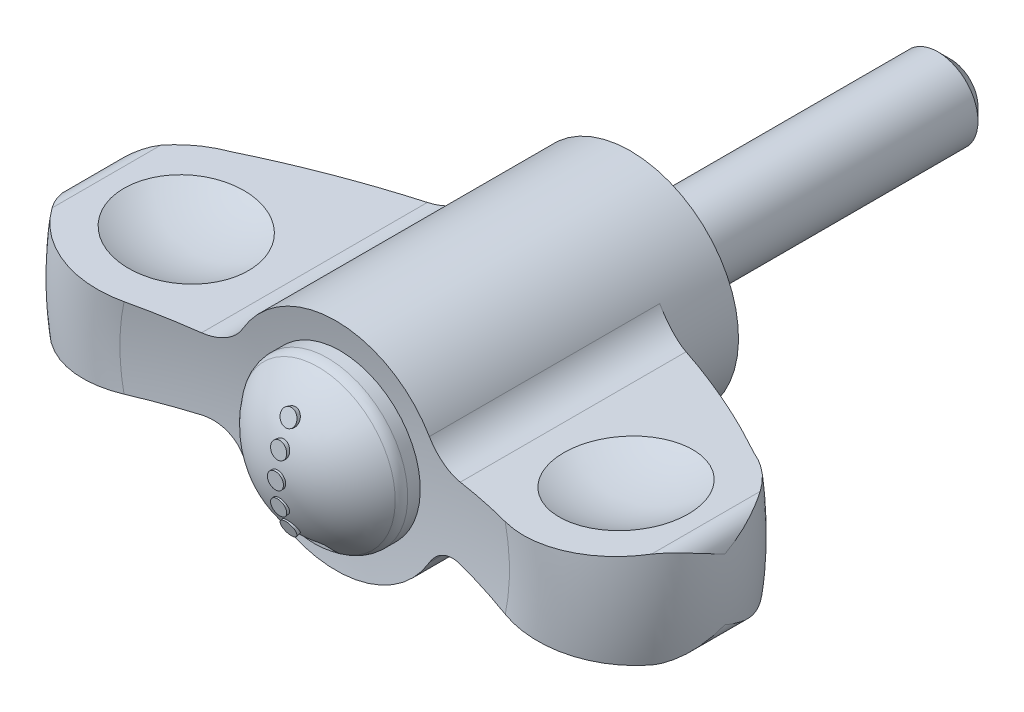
ISO-10303-21;
HEADER;
FILE_DESCRIPTION(('STEP AP214'),'2;1');
FILE_NAME('part.step','',(''),(''),'','','');
FILE_SCHEMA(('AUTOMOTIVE_DESIGN { 1 0 10303 214 1 1 1 1 }'));
ENDSEC;
DATA;
#1=APPLICATION_CONTEXT('core data for automotive mechanical design processes');
#2=APPLICATION_PROTOCOL_DEFINITION('international standard','automotive_design',2000,#1);
#3=PRODUCT_CONTEXT('',#1,'mechanical');
#4=PRODUCT('Part','Part','',(#3));
#5=PRODUCT_RELATED_PRODUCT_CATEGORY('part','',(#4));
#6=PRODUCT_DEFINITION_FORMATION('','',#4);
#7=PRODUCT_DEFINITION_CONTEXT('part definition',#1,'design');
#8=PRODUCT_DEFINITION('design','',#6,#7);
#9=PRODUCT_DEFINITION_SHAPE('','',#8);
#10=(LENGTH_UNIT() NAMED_UNIT(*) SI_UNIT(.MILLI.,.METRE.));
#11=(NAMED_UNIT(*) PLANE_ANGLE_UNIT() SI_UNIT($,.RADIAN.));
#12=(NAMED_UNIT(*) SI_UNIT($,.STERADIAN.) SOLID_ANGLE_UNIT());
#13=UNCERTAINTY_MEASURE_WITH_UNIT(LENGTH_MEASURE(1.E-05),#10,'distance_accuracy_value','');
#14=(GEOMETRIC_REPRESENTATION_CONTEXT(3) GLOBAL_UNCERTAINTY_ASSIGNED_CONTEXT((#13)) GLOBAL_UNIT_ASSIGNED_CONTEXT((#10,
#11,#12)) REPRESENTATION_CONTEXT('',''));
#15=CARTESIAN_POINT('',(0.,0.,0.));
#16=DIRECTION('',(0.,0.,1.));
#17=DIRECTION('',(1.,0.,0.));
#18=AXIS2_PLACEMENT_3D('',#15,#16,#17);
#19=CARTESIAN_POINT('',(0.,0.,14.56));
#20=DIRECTION('',(0.,0.,-1.));
#21=DIRECTION('',(-1.,0.,0.));
#22=AXIS2_PLACEMENT_3D('',#19,#20,#21);
#23=CYLINDRICAL_SURFACE('',#22,5.);
#24=CARTESIAN_POINT('',(0.,0.,18.9006117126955));
#25=DIRECTION('',(0.,0.,-1.));
#26=DIRECTION('',(-1.,0.,0.));
#27=AXIS2_PLACEMENT_3D('',#24,#25,#26);
#28=CIRCLE('',#27,5.);
#29=CARTESIAN_POINT('',(-5.,0.,18.9006117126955));
#30=VERTEX_POINT('',#29);
#31=EDGE_CURVE('E786',#30,#30,#28,.T.);
#32=ORIENTED_EDGE('',*,*,#31,.T.);
#33=EDGE_LOOP('',(#32));
#34=FACE_BOUND('',#33,.T.);
#35=CARTESIAN_POINT('',(0.,0.,18.116551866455));
#36=DIRECTION('',(0.,0.,1.));
#37=DIRECTION('',(0.,1.,0.));
#38=AXIS2_PLACEMENT_3D('',#35,#36,#37);
#39=CIRCLE('',#38,5.);
#40=CARTESIAN_POINT('',(0.,5.,18.116551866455));
#41=VERTEX_POINT('',#40);
#42=EDGE_CURVE('E197',#41,#41,#39,.T.);
#43=ORIENTED_EDGE('',*,*,#42,.T.);
#44=EDGE_LOOP('',(#43));
#45=FACE_BOUND('',#44,.T.);
#46=ADVANCED_FACE('F15',(#34,#45),#23,.T.);
#47=CARTESIAN_POINT('',(0.,0.,18.9006117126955));
#48=DIRECTION('',(0.,0.,-1.));
#49=DIRECTION('',(-1.,0.,0.));
#50=AXIS2_PLACEMENT_3D('',#47,#48,#49);
#51=TOROIDAL_SURFACE('',#50,4.,1.);
#52=CARTESIAN_POINT('',(0.,0.,19.4883661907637));
#53=DIRECTION('',(0.,0.,-1.));
#54=DIRECTION('',(-1.,0.,0.));
#55=AXIS2_PLACEMENT_3D('',#52,#53,#54);
#56=CIRCLE('',#55,4.80903935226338);
#57=CARTESIAN_POINT('',(-4.80903935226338,0.,19.4883661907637));
#58=VERTEX_POINT('',#57);
#59=EDGE_CURVE('E788',#58,#58,#56,.T.);
#60=ORIENTED_EDGE('',*,*,#59,.T.);
#61=EDGE_LOOP('',(#60));
#62=FACE_BOUND('',#61,.T.);
#63=ORIENTED_EDGE('',*,*,#31,.F.);
#64=EDGE_LOOP('',(#63));
#65=FACE_BOUND('',#64,.T.);
#66=ADVANCED_FACE('F599',(#62,#65),#51,.T.);
#67=CARTESIAN_POINT('',(0.,0.,15.8149007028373));
#68=DIRECTION('',(0.,0.,-1.));
#69=DIRECTION('',(-1.,0.,0.));
#70=AXIS2_PLACEMENT_3D('',#67,#68,#69);
#71=DEGENERATE_TOROIDAL_SURFACE('',#70,0.24745659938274,6.25,.F.);
#72=CARTESIAN_POINT('',(0.,0.,22.0200444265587));
#73=DIRECTION('',(0.,0.,-1.));
#74=DIRECTION('',(-1.,0.,0.));
#75=AXIS2_PLACEMENT_3D('',#72,#73,#74);
#76=CIRCLE('',#75,0.5);
#77=CARTESIAN_POINT('',(-0.5,0.,22.0200444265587));
#78=VERTEX_POINT('',#77);
#79=EDGE_CURVE('E650',#78,#78,#76,.T.);
#80=ORIENTED_EDGE('',*,*,#79,.T.);
#81=EDGE_LOOP('',(#80));
#82=FACE_BOUND('',#81,.T.);
#83=CARTESIAN_POINT('',(-0.340038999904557,1.16514130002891,21.8916899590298));
#84=CARTESIAN_POINT('',(-0.360796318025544,1.18378525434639,21.885987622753));
#85=CARTESIAN_POINT('',(-0.379909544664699,1.2041424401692,21.879791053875));
#86=CARTESIAN_POINT('',(-0.414301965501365,1.24767784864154,21.8666039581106));
#87=CARTESIAN_POINT('',(-0.429575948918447,1.2708598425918,21.8596123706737));
#88=CARTESIAN_POINT('',(-0.455841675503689,1.31934512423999,21.8450565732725));
#89=CARTESIAN_POINT('',(-0.466837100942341,1.34464656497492,21.8374928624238));
#90=CARTESIAN_POINT('',(-0.484264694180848,1.39666109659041,21.8220053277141));
#91=CARTESIAN_POINT('',(-0.490698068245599,1.42337381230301,21.8140815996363));
#92=CARTESIAN_POINT('',(-0.49885866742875,1.47762849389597,21.7980432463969));
#93=CARTESIAN_POINT('',(-0.50055790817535,1.50517442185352,21.7899277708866));
#94=CARTESIAN_POINT('',(-0.499121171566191,1.56016451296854,21.7737737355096));
#95=CARTESIAN_POINT('',(-0.495984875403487,1.58760866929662,21.7657351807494));
#96=CARTESIAN_POINT('',(-0.484947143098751,1.64166043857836,21.7499411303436));
#97=CARTESIAN_POINT('',(-0.47703744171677,1.66826651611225,21.7421861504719));
#98=CARTESIAN_POINT('',(-0.45665653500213,1.71982500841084,21.7271876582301));
#99=CARTESIAN_POINT('',(-0.444185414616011,1.74477745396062,21.7199441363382));
#100=CARTESIAN_POINT('',(-0.415089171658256,1.79218944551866,21.7062023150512));
#101=CARTESIAN_POINT('',(-0.398483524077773,1.81465998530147,21.6997007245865));
#102=CARTESIAN_POINT('',(-0.361547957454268,1.85657719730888,21.6875871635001));
#103=CARTESIAN_POINT('',(-0.341218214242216,1.87602401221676,21.681975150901));
#104=CARTESIAN_POINT('',(-0.297604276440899,1.91115189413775,21.6718470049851));
#105=CARTESIAN_POINT('',(-0.274348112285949,1.92686506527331,21.6673215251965));
#106=CARTESIAN_POINT('',(-0.225399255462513,1.9542751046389,21.6594321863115));
#107=CARTESIAN_POINT('',(-0.199706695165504,1.96597219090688,21.6560682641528));
#108=CARTESIAN_POINT('',(-0.146879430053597,1.98490191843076,21.650626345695));
#109=CARTESIAN_POINT('',(-0.119760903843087,1.99217626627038,21.6485363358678));
#110=CARTESIAN_POINT('',(-0.0646349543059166,2.00221475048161,21.6456525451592));
#111=CARTESIAN_POINT('',(-0.036627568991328,2.00497907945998,21.6448587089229));
#112=CARTESIAN_POINT('',(0.0192915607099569,2.00591063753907,21.6445911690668));
#113=CARTESIAN_POINT('',(0.0472027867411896,2.00410688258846,21.645109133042));
#114=CARTESIAN_POINT('',(0.102312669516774,1.99601803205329,21.6474326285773));
#115=CARTESIAN_POINT('',(0.129511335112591,1.98973299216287,21.6492381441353));
#116=CARTESIAN_POINT('',(0.182411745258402,1.97287505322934,21.6540835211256));
#117=CARTESIAN_POINT('',(0.208114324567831,1.96230457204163,21.657122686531));
#118=CARTESIAN_POINT('',(0.257321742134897,1.93718941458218,21.664349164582));
#119=CARTESIAN_POINT('',(0.280826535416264,1.92264465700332,21.6685365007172));
#120=CARTESIAN_POINT('',(0.325111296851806,1.88991768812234,21.6779679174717));
#121=CARTESIAN_POINT('',(0.345875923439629,1.87171632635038,21.6832175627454));
#122=CARTESIAN_POINT('',(0.383965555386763,1.83225353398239,21.694614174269));
#123=CARTESIAN_POINT('',(0.401290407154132,1.81099196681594,21.7007611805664));
#124=CARTESIAN_POINT('',(0.432179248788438,1.76580723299,21.7138455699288));
#125=CARTESIAN_POINT('',(0.445707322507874,1.74186146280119,21.7207896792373));
#126=CARTESIAN_POINT('',(0.468430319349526,1.69215088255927,21.7352335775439));
#127=CARTESIAN_POINT('',(0.477625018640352,1.66638597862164,21.7427333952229));
#128=CARTESIAN_POINT('',(0.491506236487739,1.61351277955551,21.7581599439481));
#129=CARTESIAN_POINT('',(0.496149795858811,1.58639417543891,21.7660900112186));
#130=CARTESIAN_POINT('',(0.500658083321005,1.53180514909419,21.7820972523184));
#131=CARTESIAN_POINT('',(0.500522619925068,1.50433471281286,21.7901744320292));
#132=CARTESIAN_POINT('',(0.495464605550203,1.44965403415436,21.8063039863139));
#133=CARTESIAN_POINT('',(0.490514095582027,1.42244624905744,21.814355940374));
#134=CARTESIAN_POINT('',(0.475919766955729,1.36922900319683,21.8301633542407));
#135=CARTESIAN_POINT('',(0.466275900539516,1.34321955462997,21.8379188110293));
#136=CARTESIAN_POINT('',(0.442558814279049,1.29314848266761,21.8529103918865));
#137=CARTESIAN_POINT('',(0.42848645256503,1.2690864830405,21.8601466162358));
#138=CARTESIAN_POINT('',(0.39629638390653,1.22360278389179,21.8738857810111));
#139=CARTESIAN_POINT('',(0.378178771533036,1.20218102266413,21.8803887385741));
#140=CARTESIAN_POINT('',(0.338535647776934,1.16274360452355,21.892415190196));
#141=CARTESIAN_POINT('',(0.317033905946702,1.14470598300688,21.8979449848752));
#142=CARTESIAN_POINT('',(0.271137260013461,1.11239704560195,21.9078923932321));
#143=CARTESIAN_POINT('',(0.246742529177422,1.09812550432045,21.9123100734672));
#144=CARTESIAN_POINT('',(0.19604730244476,1.07392122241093,21.9198289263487));
#145=CARTESIAN_POINT('',(0.16977154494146,1.06394113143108,21.9229444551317));
#146=CARTESIAN_POINT('',(0.115826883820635,1.04839125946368,21.9278094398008));
#147=CARTESIAN_POINT('',(0.0881581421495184,1.0428209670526,21.9295590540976));
#148=CARTESIAN_POINT('',(0.0325476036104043,1.03629851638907,21.9316086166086));
#149=CARTESIAN_POINT('',(0.00461243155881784,1.03529485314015,21.9319247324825));
#150=CARTESIAN_POINT('',(-0.0510422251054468,1.03779652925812,21.9311379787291));
#151=CARTESIAN_POINT('',(-0.0787616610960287,1.0413028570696,21.9300347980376));
#152=CARTESIAN_POINT('',(-0.13308296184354,1.05269636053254,21.9264617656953));
#153=CARTESIAN_POINT('',(-0.159688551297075,1.06056742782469,21.9239969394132));
#154=CARTESIAN_POINT('',(-0.211125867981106,1.08044004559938,21.9178013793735));
#155=CARTESIAN_POINT('',(-0.235959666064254,1.09243667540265,21.9140721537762));
#156=CARTESIAN_POINT('',(-0.273974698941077,1.11478011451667,21.9071622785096));
#157=CARTESIAN_POINT('',(-0.287927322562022,1.12394977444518,21.9043336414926));
#158=CARTESIAN_POINT('',(-0.314793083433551,1.14359180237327,21.8982914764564));
#159=CARTESIAN_POINT('',(-0.32770622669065,1.15406416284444,21.8950779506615));
#160=CARTESIAN_POINT('',(-0.340038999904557,1.16514130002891,21.8916899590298));
#161=B_SPLINE_CURVE_WITH_KNOTS('',3,(#83,#84,#85,#86,#87,#88,#89,#90,#91,#92,#93,#94,#95,#96,
#97,#98,#99,#100,#101,#102,#103,#104,#105,#106,#107,#108,#109,#110,#111,#112,#113,#114,#115,
#116,#117,#118,#119,#120,#121,#122,#123,#124,#125,#126,#127,#128,#129,#130,#131,#132,#133,#134,
#135,#136,#137,#138,#139,#140,#141,#142,#143,#144,#145,#146,#147,#148,#149,#150,#151,#152,#153,
#154,#155,#156,#157,#158,#159,#160),.UNSPECIFIED.,.T.,.F.,(4,2,2,2,2,2,2,2,2,2,2,2,2,2,2,2,2,2,
2,2,2,2,2,2,2,2,2,2,2,2,2,2,2,2,2,2,2,2,4),(0.,0.0853707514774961,0.170856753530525,
0.25626901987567,0.341658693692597,0.427552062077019,0.513451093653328,0.599499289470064,
0.685545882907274,0.771194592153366,0.856839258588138,0.941718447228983,1.02659302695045,
1.11065429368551,1.19471197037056,1.2782370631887,1.36176111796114,1.44523811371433,
1.52871681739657,1.61264468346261,1.69657629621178,1.78127699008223,1.86598205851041,
1.95147918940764,2.03697974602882,2.1229797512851,2.2089806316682,2.29496485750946,
2.38094707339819,2.46635030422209,2.55174842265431,2.6361784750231,2.7205987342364,
2.80406445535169,2.88754847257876,2.97072641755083,3.05380549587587,3.10452805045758,
3.15525031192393),.UNSPECIFIED.);
#162=CARTESIAN_POINT('',(-0.340038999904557,1.16514130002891,21.8916899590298));
#163=VERTEX_POINT('',#162);
#164=EDGE_CURVE('E644',#163,#163,#161,.T.);
#165=ORIENTED_EDGE('',*,*,#164,.T.);
#166=EDGE_LOOP('',(#165));
#167=FACE_BOUND('',#166,.T.);
#168=CARTESIAN_POINT('',(-0.497646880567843,2.89464344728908,21.1927290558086));
#169=CARTESIAN_POINT('',(-0.500408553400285,2.91946824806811,21.1779640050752));
#170=CARTESIAN_POINT('',(-0.500739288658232,2.94451618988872,21.163077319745));
#171=CARTESIAN_POINT('',(-0.496515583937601,2.99433639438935,21.1334873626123));
#172=CARTESIAN_POINT('',(-0.491955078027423,3.0191082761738,21.1187843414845));
#173=CARTESIAN_POINT('',(-0.478057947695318,3.06764588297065,21.0899916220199));
#174=CARTESIAN_POINT('',(-0.468722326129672,3.09141181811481,21.0759017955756));
#175=CARTESIAN_POINT('',(-0.445518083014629,3.13724443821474,21.0487420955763));
#176=CARTESIAN_POINT('',(-0.43165075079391,3.1593116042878,21.0356719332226));
#177=CARTESIAN_POINT('',(-0.399852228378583,3.2009658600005,21.0110096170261));
#178=CARTESIAN_POINT('',(-0.381947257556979,3.22056773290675,20.9994086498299));
#179=CARTESIAN_POINT('',(-0.342511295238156,3.25685836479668,20.9779368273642));
#180=CARTESIAN_POINT('',(-0.320980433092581,3.27354722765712,20.9680659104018));
#181=CARTESIAN_POINT('',(-0.275262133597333,3.30325387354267,20.9504989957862));
#182=CARTESIAN_POINT('',(-0.251121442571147,3.31632492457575,20.9427714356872));
#183=CARTESIAN_POINT('',(-0.200601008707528,3.33872614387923,20.9295296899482));
#184=CARTESIAN_POINT('',(-0.17422149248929,3.34805669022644,20.9240152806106));
#185=CARTESIAN_POINT('',(-0.120434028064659,3.3625583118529,20.9154453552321));
#186=CARTESIAN_POINT('',(-0.0930497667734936,3.36779453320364,20.9123513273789));
#187=CARTESIAN_POINT('',(-0.0376468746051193,3.37419090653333,20.9085718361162));
#188=CARTESIAN_POINT('',(-0.00962828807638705,3.37535134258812,20.9078862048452));
#189=CARTESIAN_POINT('',(0.0459558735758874,3.37356848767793,20.908939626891));
#190=CARTESIAN_POINT('',(0.0735231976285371,3.37066528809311,20.9106549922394));
#191=CARTESIAN_POINT('',(0.127700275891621,3.3609180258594,20.916414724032));
#192=CARTESIAN_POINT('',(0.154310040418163,3.35407400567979,20.9204590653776));
#193=CARTESIAN_POINT('',(0.205846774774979,3.3366501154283,20.9307568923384));
#194=CARTESIAN_POINT('',(0.230772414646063,3.32606733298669,20.9370121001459));
#195=CARTESIAN_POINT('',(0.278235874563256,3.30148793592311,20.951543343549));
#196=CARTESIAN_POINT('',(0.300773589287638,3.28749117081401,20.959819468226));
#197=CARTESIAN_POINT('',(0.343090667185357,3.25632753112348,20.9782511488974));
#198=CARTESIAN_POINT('',(0.362837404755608,3.23912786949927,20.9884261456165));
#199=CARTESIAN_POINT('',(0.398761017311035,3.2021630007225,21.0103013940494));
#200=CARTESIAN_POINT('',(0.414937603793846,3.1823975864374,21.0220017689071));
#201=CARTESIAN_POINT('',(0.443543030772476,3.14051907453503,21.0468026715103));
#202=CARTESIAN_POINT('',(0.455906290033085,3.11837288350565,21.0599229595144));
#203=CARTESIAN_POINT('',(0.476209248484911,3.0726334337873,21.0870346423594));
#204=CARTESIAN_POINT('',(0.484148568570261,3.04904005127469,21.1010261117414));
#205=CARTESIAN_POINT('',(0.495492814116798,3.00069621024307,21.1297122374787));
#206=CARTESIAN_POINT('',(0.498827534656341,2.97593366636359,21.1444143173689));
#207=CARTESIAN_POINT('',(0.500654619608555,2.92628512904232,21.1739119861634));
#208=CARTESIAN_POINT('',(0.499146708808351,2.90139912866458,21.1887075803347));
#209=CARTESIAN_POINT('',(0.491297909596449,2.85201549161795,21.2180901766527));
#210=CARTESIAN_POINT('',(0.48492094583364,2.8275221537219,21.2326747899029));
#211=CARTESIAN_POINT('',(0.467455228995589,2.77981788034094,21.2611037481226));
#212=CARTESIAN_POINT('',(0.456366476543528,2.7566069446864,21.2749480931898));
#213=CARTESIAN_POINT('',(0.429815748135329,2.71222388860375,21.3014431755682));
#214=CARTESIAN_POINT('',(0.41436966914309,2.69104472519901,21.3140980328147));
#215=CARTESIAN_POINT('',(0.379501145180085,2.65126141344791,21.3378888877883));
#216=CARTESIAN_POINT('',(0.360078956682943,2.63265709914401,21.3490249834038));
#217=CARTESIAN_POINT('',(0.318084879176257,2.59882690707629,21.3692903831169));
#218=CARTESIAN_POINT('',(0.295559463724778,2.58355848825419,21.3784449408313));
#219=CARTESIAN_POINT('',(0.247794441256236,2.55655637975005,21.3946449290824));
#220=CARTESIAN_POINT('',(0.222555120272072,2.54482231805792,21.4016905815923));
#221=CARTESIAN_POINT('',(0.170563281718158,2.52543836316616,21.4133348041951));
#222=CARTESIAN_POINT('',(0.143845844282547,2.51771926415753,21.4179748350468));
#223=CARTESIAN_POINT('',(0.0892673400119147,2.50629638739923,21.4248427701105));
#224=CARTESIAN_POINT('',(0.0614063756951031,2.50259225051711,21.4270708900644));
#225=CARTESIAN_POINT('',(0.00574373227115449,2.49934037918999,21.4290269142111));
#226=CARTESIAN_POINT('',(-0.0220534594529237,2.49973599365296,21.428788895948));
#227=CARTESIAN_POINT('',(-0.0771718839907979,2.50453462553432,21.4259026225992));
#228=CARTESIAN_POINT('',(-0.10449313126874,2.50893752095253,21.42325444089));
#229=CARTESIAN_POINT('',(-0.157803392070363,2.52159360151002,21.4156460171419));
#230=CARTESIAN_POINT('',(-0.183796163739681,2.52983517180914,21.4106927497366));
#231=CARTESIAN_POINT('',(-0.233818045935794,2.54991225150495,21.3986343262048));
#232=CARTESIAN_POINT('',(-0.257847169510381,2.56174773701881,21.3915291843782));
#233=CARTESIAN_POINT('',(-0.303500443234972,2.58878192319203,21.3753128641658));
#234=CARTESIAN_POINT('',(-0.325101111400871,2.60400981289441,21.3661842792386));
#235=CARTESIAN_POINT('',(-0.365081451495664,2.63732566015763,21.3462302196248));
#236=CARTESIAN_POINT('',(-0.38346007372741,2.65541454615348,21.3354041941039));
#237=CARTESIAN_POINT('',(-0.416802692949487,2.69426501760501,21.3121735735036));
#238=CARTESIAN_POINT('',(-0.43170289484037,2.71506703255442,21.2997451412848));
#239=CARTESIAN_POINT('',(-0.457285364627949,2.75849069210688,21.2738244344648));
#240=CARTESIAN_POINT('',(-0.46797218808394,2.78111033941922,21.2603333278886));
#241=CARTESIAN_POINT('',(-0.48177274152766,2.81900189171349,21.2377524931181));
#242=CARTESIAN_POINT('',(-0.486226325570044,2.83392130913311,21.228866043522));
#243=CARTESIAN_POINT('',(-0.493311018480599,2.86407995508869,21.2109115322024));
#244=CARTESIAN_POINT('',(-0.495942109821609,2.8793191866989,21.2018434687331));
#245=CARTESIAN_POINT('',(-0.497646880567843,2.89464344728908,21.1927290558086));
#246=B_SPLINE_CURVE_WITH_KNOTS('',3,(#168,#169,#170,#171,#172,#173,#174,#175,#176,#177,#178,
#179,#180,#181,#182,#183,#184,#185,#186,#187,#188,#189,#190,#191,#192,#193,#194,#195,#196,#197,
#198,#199,#200,#201,#202,#203,#204,#205,#206,#207,#208,#209,#210,#211,#212,#213,#214,#215,#216,
#217,#218,#219,#220,#221,#222,#223,#224,#225,#226,#227,#228,#229,#230,#231,#232,#233,#234,#235,
#236,#237,#238,#239,#240,#241,#242,#243,#244,#245),.UNSPECIFIED.,.T.,.F.,(4,2,2,2,2,2,2,2,2,2,2,
2,2,2,2,2,2,2,2,2,2,2,2,2,2,2,2,2,2,2,2,2,2,2,2,2,2,2,4),(0.,0.0869817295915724,
0.174071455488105,0.261142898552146,0.348189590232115,0.434686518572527,0.52118036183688,
0.606323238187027,0.691457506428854,0.775207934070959,0.858952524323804,0.941876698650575,
1.02479997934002,1.10778799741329,1.1907796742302,1.27467294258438,1.35857298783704,
1.4438444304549,1.52912317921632,1.61568830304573,1.70225834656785,1.7894760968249,
1.87669383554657,1.96359740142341,2.05049536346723,2.13621044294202,2.22191649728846,
2.30609171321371,2.39025939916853,2.47326560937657,2.55626929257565,2.6390234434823,
2.72177704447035,2.80527224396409,2.8887945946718,2.9737458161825,3.05860493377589,
3.11229792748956,3.16599143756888),.UNSPECIFIED.);
#247=CARTESIAN_POINT('',(-0.497646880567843,2.89464344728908,21.1927290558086));
#248=VERTEX_POINT('',#247);
#249=EDGE_CURVE('E578',#248,#248,#246,.T.);
#250=ORIENTED_EDGE('',*,*,#249,.T.);
#251=EDGE_LOOP('',(#250));
#252=FACE_BOUND('',#251,.T.);
#253=CARTESIAN_POINT('',(1.1998,-3.50000006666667,20.6605789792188));
#254=CARTESIAN_POINT('',(1.21612550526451,-3.49998062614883,20.6562820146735));
#255=CARTESIAN_POINT('',(1.23209426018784,-3.50130836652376,20.6509470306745));
#256=CARTESIAN_POINT('',(1.26285478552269,-3.50625198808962,20.6386475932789));
#257=CARTESIAN_POINT('',(1.27765612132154,-3.50984647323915,20.6316987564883));
#258=CARTESIAN_POINT('',(1.30585464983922,-3.5189059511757,20.616566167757));
#259=CARTESIAN_POINT('',(1.31925923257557,-3.5243603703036,20.6083895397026));
#260=CARTESIAN_POINT('',(1.34468676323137,-3.53681450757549,20.5910549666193));
#261=CARTESIAN_POINT('',(1.35670558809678,-3.54381866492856,20.5818942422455));
#262=CARTESIAN_POINT('',(1.38518861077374,-3.56306948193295,20.5578662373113));
#263=CARTESIAN_POINT('',(1.40069252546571,-3.57614271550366,20.5425190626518));
#264=CARTESIAN_POINT('',(1.4283261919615,-3.60440175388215,20.5107779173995));
#265=CARTESIAN_POINT('',(1.44045106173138,-3.61959056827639,20.4943824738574));
#266=CARTESIAN_POINT('',(1.46156438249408,-3.6518053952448,20.460691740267));
#267=CARTESIAN_POINT('',(1.47049098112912,-3.66886008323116,20.443385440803));
#268=CARTESIAN_POINT('',(1.48489736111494,-3.70410734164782,20.4085452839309));
#269=CARTESIAN_POINT('',(1.49038149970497,-3.72229844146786,20.3910117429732));
#270=CARTESIAN_POINT('',(1.49606821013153,-3.75058573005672,20.3643946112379));
#271=CARTESIAN_POINT('',(1.49754229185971,-3.76040360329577,20.3552703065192));
#272=CARTESIAN_POINT('',(1.49950991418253,-3.78019383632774,20.337108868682));
#273=CARTESIAN_POINT('',(1.5000046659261,-3.79016598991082,20.3280716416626));
#274=CARTESIAN_POINT('',(1.4999999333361,-3.80019999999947,20.3190948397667));
#275=B_SPLINE_CURVE_WITH_KNOTS('',3,(#253,#254,#255,#256,#257,#258,#259,#260,#261,#262,#263,
#264,#265,#266,#267,#268,#269,#270,#271,#272,#273,#274),.UNSPECIFIED.,.F.,.F.,(4,2,2,2,2,2,2,2,
2,2,4),(0.,0.0504386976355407,0.10040828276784,0.15009840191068,0.19993274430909,
0.27581643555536,0.351809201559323,0.429201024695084,0.506494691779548,0.546914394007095,
0.587284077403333),.UNSPECIFIED.);
#276=CARTESIAN_POINT('',(1.2,-3.5,20.6605261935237));
#277=VERTEX_POINT('',#276);
#278=CARTESIAN_POINT('',(1.5,-3.8,20.3192737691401));
#279=VERTEX_POINT('',#278);
#280=EDGE_CURVE('E629',#277,#279,#275,.T.);
#281=ORIENTED_EDGE('',*,*,#280,.T.);
#282=CARTESIAN_POINT('',(1.5,-3.77186911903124,20.3442851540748));
#283=CARTESIAN_POINT('',(1.5,-3.89875657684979,20.2321778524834));
#284=CARTESIAN_POINT('',(1.5,-4.02090058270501,20.1147176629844));
#285=CARTESIAN_POINT('',(1.5,-4.25490832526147,19.8698919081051));
#286=CARTESIAN_POINT('',(1.5,-4.3667688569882,19.7425232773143));
#287=CARTESIAN_POINT('',(1.5,-4.57950203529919,19.4786823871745));
#288=CARTESIAN_POINT('',(1.5,-4.68036209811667,19.3421999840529));
#289=CARTESIAN_POINT('',(1.5,-4.87027979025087,19.0611834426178));
#290=CARTESIAN_POINT('',(1.5,-4.95933306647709,18.9166463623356));
#291=CARTESIAN_POINT('',(1.5,-5.12495781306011,18.6206168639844));
#292=CARTESIAN_POINT('',(1.5,-5.20153105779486,18.469125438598));
#293=CARTESIAN_POINT('',(1.5,-5.34170076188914,18.1601863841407));
#294=CARTESIAN_POINT('',(1.5,-5.40529243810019,18.0027365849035));
#295=CARTESIAN_POINT('',(1.5,-5.51897808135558,17.6831611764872));
#296=CARTESIAN_POINT('',(1.5,-5.5690814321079,17.5210389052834));
#297=CARTESIAN_POINT('',(1.5,-5.65551405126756,17.1930993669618));
#298=CARTESIAN_POINT('',(1.5,-5.69183822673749,17.0272807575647));
#299=CARTESIAN_POINT('',(1.5,-5.75050071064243,16.6927851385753));
#300=CARTESIAN_POINT('',(1.5,-5.77280589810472,16.5241023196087));
#301=CARTESIAN_POINT('',(1.5,-5.80314361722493,16.1853951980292));
#302=CARTESIAN_POINT('',(1.5,-5.81117086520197,16.0153704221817));
#303=CARTESIAN_POINT('',(1.5,-5.81287966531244,15.6753003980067));
#304=CARTESIAN_POINT('',(1.5,-5.80656556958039,15.5052551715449));
#305=CARTESIAN_POINT('',(1.5,-5.77964033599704,15.1662373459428));
#306=CARTESIAN_POINT('',(1.5,-5.75902392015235,14.9972651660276));
#307=CARTESIAN_POINT('',(1.5,-5.70362880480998,14.661630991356));
#308=CARTESIAN_POINT('',(1.5,-5.66884793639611,14.494969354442));
#309=CARTESIAN_POINT('',(1.5,-5.58535629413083,14.1651100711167));
#310=CARTESIAN_POINT('',(1.5,-5.53664037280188,14.0019137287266));
#311=CARTESIAN_POINT('',(1.5,-5.42563609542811,13.6802531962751));
#312=CARTESIAN_POINT('',(1.5,-5.36335234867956,13.5217874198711));
#313=CARTESIAN_POINT('',(1.5,-5.2256544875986,13.210648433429));
#314=CARTESIAN_POINT('',(1.5,-5.15023555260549,13.0579773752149));
#315=CARTESIAN_POINT('',(1.5,-4.90512682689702,12.6105522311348));
#316=CARTESIAN_POINT('',(1.5,-4.71642266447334,12.3259167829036));
#317=CARTESIAN_POINT('',(1.5,-4.29392526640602,11.7926493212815));
#318=CARTESIAN_POINT('',(1.5,-4.06013964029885,11.5440112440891));
#319=CARTESIAN_POINT('',(1.5,-3.5546161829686,11.09026827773));
#320=CARTESIAN_POINT('',(1.5,-3.28297326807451,10.8850576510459));
#321=CARTESIAN_POINT('',(1.5,-2.70841556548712,10.5233942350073));
#322=CARTESIAN_POINT('',(1.5,-2.40547667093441,10.3669794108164));
#323=CARTESIAN_POINT('',(1.5,-1.93598902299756,10.1739467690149));
#324=CARTESIAN_POINT('',(1.5,-1.77765079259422,10.1166830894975));
#325=CARTESIAN_POINT('',(1.5,-1.45650662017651,10.0162125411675));
#326=CARTESIAN_POINT('',(1.5,-1.29370041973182,9.97300648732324));
#327=CARTESIAN_POINT('',(1.5,-0.965128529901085,9.90155550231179));
#328=CARTESIAN_POINT('',(1.5,-0.799368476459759,9.87328469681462));
#329=CARTESIAN_POINT('',(1.5,-0.465930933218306,9.83253718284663));
#330=CARTESIAN_POINT('',(1.5,-0.298253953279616,9.82005636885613));
#331=CARTESIAN_POINT('',(1.5,0.0253649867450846,9.81186912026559));
#332=CARTESIAN_POINT('',(1.5,0.18127852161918,9.81501469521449));
#333=CARTESIAN_POINT('',(1.5,0.492193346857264,9.83529957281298));
#334=CARTESIAN_POINT('',(1.5,0.647194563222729,9.85243999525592));
#335=CARTESIAN_POINT('',(1.5,0.95528277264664,9.90004845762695));
#336=CARTESIAN_POINT('',(1.5,1.1083677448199,9.93052951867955));
#337=CARTESIAN_POINT('',(1.5,1.41143864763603,10.0040736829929));
#338=CARTESIAN_POINT('',(1.5,1.56142453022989,10.0471369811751));
#339=CARTESIAN_POINT('',(1.5,1.99735271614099,10.1916378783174));
#340=CARTESIAN_POINT('',(1.5,2.27793507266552,10.3097985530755));
#341=CARTESIAN_POINT('',(1.5,2.81752353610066,10.5874119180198));
#342=CARTESIAN_POINT('',(1.5,3.07653567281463,10.7468530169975));
#343=CARTESIAN_POINT('',(1.5,3.59110850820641,11.1201960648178));
#344=CARTESIAN_POINT('',(1.5,3.84395994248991,11.3378527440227));
#345=CARTESIAN_POINT('',(1.5,4.31037854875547,11.8118817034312));
#346=CARTESIAN_POINT('',(1.5,4.52393370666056,12.0682657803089));
#347=CARTESIAN_POINT('',(1.5,4.90946052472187,12.6176216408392));
#348=CARTESIAN_POINT('',(1.5,5.0806077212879,12.9111726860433));
#349=CARTESIAN_POINT('',(1.5,5.37140416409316,13.5227548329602));
#350=CARTESIAN_POINT('',(1.5,5.49105230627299,13.8407864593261));
#351=CARTESIAN_POINT('',(1.5,5.67587928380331,14.4936469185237));
#352=CARTESIAN_POINT('',(1.5,5.74084423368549,14.8285363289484));
#353=CARTESIAN_POINT('',(1.5,5.81368594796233,15.504459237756));
#354=CARTESIAN_POINT('',(1.5,5.82156360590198,15.8454926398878));
#355=CARTESIAN_POINT('',(1.5,5.77999330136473,16.5243697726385));
#356=CARTESIAN_POINT('',(1.5,5.73049170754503,16.8622102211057));
#357=CARTESIAN_POINT('',(1.5,5.57546266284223,17.5248097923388));
#358=CARTESIAN_POINT('',(1.5,5.46993096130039,17.8495679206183));
#359=CARTESIAN_POINT('',(1.5,5.20581581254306,18.4767273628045));
#360=CARTESIAN_POINT('',(1.5,5.04723499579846,18.7791297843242));
#361=CARTESIAN_POINT('',(1.5,4.68153004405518,19.3528988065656));
#362=CARTESIAN_POINT('',(1.5,4.47441760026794,19.6242728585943));
#363=CARTESIAN_POINT('',(1.5,4.01781623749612,20.1278496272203));
#364=CARTESIAN_POINT('',(1.5,3.76839934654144,20.3601176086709));
#365=CARTESIAN_POINT('',(1.5,3.23377900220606,20.7793780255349));
#366=CARTESIAN_POINT('',(1.5,2.94854886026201,20.9663363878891));
#367=CARTESIAN_POINT('',(1.5,2.35178931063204,21.2881057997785));
#368=CARTESIAN_POINT('',(1.5,2.04041191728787,21.423195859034));
#369=CARTESIAN_POINT('',(1.5,1.55980994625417,21.5835304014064));
#370=CARTESIAN_POINT('',(1.5,1.39737998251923,21.6299211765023));
#371=CARTESIAN_POINT('',(1.5,1.06895790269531,21.707915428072));
#372=CARTESIAN_POINT('',(1.5,0.902966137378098,21.7395203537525));
#373=CARTESIAN_POINT('',(1.5,0.575534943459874,21.78602119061));
#374=CARTESIAN_POINT('',(1.5,0.414184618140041,21.8015438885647));
#375=CARTESIAN_POINT('',(1.5,0.0907420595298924,21.8173719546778));
#376=CARTESIAN_POINT('',(1.5,-0.0713500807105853,21.8176791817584));
#377=CARTESIAN_POINT('',(1.5,-0.394858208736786,21.8030600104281));
#378=CARTESIAN_POINT('',(1.5,-0.556274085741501,21.7881312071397));
#379=CARTESIAN_POINT('',(1.5,-0.877155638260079,21.7437415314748));
#380=CARTESIAN_POINT('',(1.5,-1.0366203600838,21.7142738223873));
#381=CARTESIAN_POINT('',(1.5,-1.33905968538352,21.644705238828));
#382=CARTESIAN_POINT('',(1.5,-1.48229107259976,21.6057103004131));
#383=CARTESIAN_POINT('',(1.5,-1.76529127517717,21.5167876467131));
#384=CARTESIAN_POINT('',(1.5,-1.9050606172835,21.4668616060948));
#385=CARTESIAN_POINT('',(1.5,-2.18030458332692,21.3565927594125));
#386=CARTESIAN_POINT('',(1.5,-2.3157823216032,21.2962577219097));
#387=CARTESIAN_POINT('',(1.5,-2.5818012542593,21.165616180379));
#388=CARTESIAN_POINT('',(1.5,-2.7123432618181,21.0953113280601));
#389=CARTESIAN_POINT('',(1.5,-3.00575200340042,20.922887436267));
#390=CARTESIAN_POINT('',(1.5,-3.16672088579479,20.8175174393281));
#391=CARTESIAN_POINT('',(1.5,-3.47778526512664,20.5918238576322));
#392=CARTESIAN_POINT('',(1.5,-3.62788126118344,20.4715009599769));
#393=CARTESIAN_POINT('',(1.5,-3.77186911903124,20.3442851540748));
#394=B_SPLINE_CURVE_WITH_KNOTS('',3,(#282,#283,#284,#285,#286,#287,#288,#289,#290,#291,#292,
#293,#294,#295,#296,#297,#298,#299,#300,#301,#302,#303,#304,#305,#306,#307,#308,#309,#310,#311,
#312,#313,#314,#315,#316,#317,#318,#319,#320,#321,#322,#323,#324,#325,#326,#327,#328,#329,#330,
#331,#332,#333,#334,#335,#336,#337,#338,#339,#340,#341,#342,#343,#344,#345,#346,#347,#348,#349,
#350,#351,#352,#353,#354,#355,#356,#357,#358,#359,#360,#361,#362,#363,#364,#365,#366,#367,#368,
#369,#370,#371,#372,#373,#374,#375,#376,#377,#378,#379,#380,#381,#382,#383,#384,#385,#386,#387,
#388,#389,#390,#391,#392,#393),.UNSPECIFIED.,.T.,.F.,(4,2,2,2,2,2,2,2,2,2,2,2,2,2,2,2,2,2,2,2,2,
2,2,2,2,2,2,2,2,2,2,2,2,2,2,2,2,2,2,2,2,2,2,2,2,2,2,2,2,2,2,2,2,2,2,4),(0.,0.507784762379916,
1.01572724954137,1.52424482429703,2.03294936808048,2.5415815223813,3.05040074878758,
3.55886507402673,4.06751715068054,4.57736648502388,5.08740445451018,5.59728766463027,
6.10735913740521,6.61750874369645,7.12784703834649,7.6380122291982,8.14836504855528,
9.16759938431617,10.186661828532,11.2032137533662,12.2205546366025,12.7251567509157,
13.2297881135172,13.7335423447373,14.2371655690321,14.7043619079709,15.1715956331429,
15.6392864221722,16.1069844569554,17.0163323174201,17.9254251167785,18.9216346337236,
19.9181482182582,20.932735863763,21.9473452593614,22.9659049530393,23.984448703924,
25.0039452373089,26.0235191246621,27.0430424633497,28.062320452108,29.0798801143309,
30.0982026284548,31.1109679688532,31.6171910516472,32.1233645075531,32.6089695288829,
33.0945152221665,33.5801375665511,34.0659884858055,34.5108775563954,34.9556985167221,
35.4001889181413,35.8446057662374,36.4208502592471,36.9970682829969),.UNSPECIFIED.);
#395=CARTESIAN_POINT('',(1.5,-4.39122918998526,19.71));
#396=VERTEX_POINT('',#395);
#397=EDGE_CURVE('E637',#279,#396,#394,.T.);
#398=ORIENTED_EDGE('',*,*,#397,.T.);
#399=CARTESIAN_POINT('',(0.,0.,19.71));
#400=DIRECTION('',(0.,0.,1.));
#401=DIRECTION('',(1.,0.,0.));
#402=AXIS2_PLACEMENT_3D('',#399,#400,#401);
#403=CIRCLE('',#402,4.64035492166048);
#404=CARTESIAN_POINT('',(-1.5,-4.39122918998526,19.71));
#405=VERTEX_POINT('',#404);
#406=EDGE_CURVE('E790',#396,#405,#403,.F.);
#407=ORIENTED_EDGE('',*,*,#406,.T.);
#408=CARTESIAN_POINT('',(-1.5,-3.77186911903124,20.3442851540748));
#409=CARTESIAN_POINT('',(-1.5,-3.51968024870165,20.567082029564));
#410=CARTESIAN_POINT('',(-1.5,-3.24858986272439,20.7688458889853));
#411=CARTESIAN_POINT('',(-1.5,-2.67566749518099,21.1242517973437));
#412=CARTESIAN_POINT('',(-1.5,-2.37377647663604,21.2777990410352));
#413=CARTESIAN_POINT('',(-1.5,-1.90529373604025,21.4673543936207));
#414=CARTESIAN_POINT('',(-1.5,-1.74668297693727,21.5237110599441));
#415=CARTESIAN_POINT('',(-1.5,-1.42506893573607,21.6223262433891));
#416=CARTESIAN_POINT('',(-1.5,-1.26206533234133,21.664583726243));
#417=CARTESIAN_POINT('',(-1.5,-0.933215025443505,21.7340833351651));
#418=CARTESIAN_POINT('',(-1.5,-0.767374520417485,21.7613547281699));
#419=CARTESIAN_POINT('',(-1.5,-0.4338693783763,21.8000597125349));
#420=CARTESIAN_POINT('',(-1.5,-0.266205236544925,21.8114975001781));
#421=CARTESIAN_POINT('',(-1.5,0.0570192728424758,21.8176702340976));
#422=CARTESIAN_POINT('',(-1.5,0.212558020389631,21.8135775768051));
#423=CARTESIAN_POINT('',(-1.5,0.52264721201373,21.7914976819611));
#424=CARTESIAN_POINT('',(-1.5,0.677197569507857,21.7735092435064));
#425=CARTESIAN_POINT('',(-1.5,0.98433485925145,21.7243111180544));
#426=CARTESIAN_POINT('',(-1.5,1.13691959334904,21.6930877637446));
#427=CARTESIAN_POINT('',(-1.5,1.43894512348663,21.6181556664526));
#428=CARTESIAN_POINT('',(-1.5,1.58838588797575,21.5744467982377));
#429=CARTESIAN_POINT('',(-1.5,2.02382040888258,21.4277789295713));
#430=CARTESIAN_POINT('',(-1.5,2.30434575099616,21.3080318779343));
#431=CARTESIAN_POINT('',(-1.5,2.8435399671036,21.027221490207));
#432=CARTESIAN_POINT('',(-1.5,3.10221535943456,20.8661705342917));
#433=CARTESIAN_POINT('',(-1.5,3.61544960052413,20.489708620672));
#434=CARTESIAN_POINT('',(-1.5,3.86731041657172,20.2705993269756));
#435=CARTESIAN_POINT('',(-1.5,4.3315023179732,19.7938279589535));
#436=CARTESIAN_POINT('',(-1.5,4.5438210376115,19.5361538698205));
#437=CARTESIAN_POINT('',(-1.5,4.92653366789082,18.9845384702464));
#438=CARTESIAN_POINT('',(-1.5,5.09612198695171,18.6900376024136));
#439=CARTESIAN_POINT('',(-1.5,5.38365828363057,18.0768292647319));
#440=CARTESIAN_POINT('',(-1.5,5.50160540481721,17.7581213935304));
#441=CARTESIAN_POINT('',(-1.5,5.68292100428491,17.1042270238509));
#442=CARTESIAN_POINT('',(-1.5,5.74607992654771,16.7689823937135));
#443=CARTESIAN_POINT('',(-1.5,5.8152742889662,16.0926566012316));
#444=CARTESIAN_POINT('',(-1.5,5.82131057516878,15.751575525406));
#445=CARTESIAN_POINT('',(-1.5,5.77607262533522,15.0729212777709));
#446=CARTESIAN_POINT('',(-1.5,5.72474618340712,14.7353515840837));
#447=CARTESIAN_POINT('',(-1.5,5.56613774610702,14.073595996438));
#448=CARTESIAN_POINT('',(-1.5,5.4588514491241,13.7494111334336));
#449=CARTESIAN_POINT('',(-1.5,5.19134881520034,13.1236897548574));
#450=CARTESIAN_POINT('',(-1.5,5.03113581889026,12.8221518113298));
#451=CARTESIAN_POINT('',(-1.5,4.66233473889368,12.2503761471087));
#452=CARTESIAN_POINT('',(-1.5,4.45375853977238,11.9801307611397));
#453=CARTESIAN_POINT('',(-1.5,3.99444862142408,11.4790519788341));
#454=CARTESIAN_POINT('',(-1.5,3.74378817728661,11.2481514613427));
#455=CARTESIAN_POINT('',(-1.5,3.20691975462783,10.8318202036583));
#456=CARTESIAN_POINT('',(-1.5,2.92068470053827,10.6464244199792));
#457=CARTESIAN_POINT('',(-1.5,2.32223129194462,10.327964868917));
#458=CARTESIAN_POINT('',(-1.5,2.01016738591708,10.1946139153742));
#459=CARTESIAN_POINT('',(-1.5,1.52875942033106,10.0370079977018));
#460=CARTESIAN_POINT('',(-1.5,1.36609910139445,9.9915467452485));
#461=CARTESIAN_POINT('',(-1.5,1.03729605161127,9.91546217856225));
#462=CARTESIAN_POINT('',(-1.5,0.871153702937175,9.88483724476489));
#463=CARTESIAN_POINT('',(-1.5,0.543739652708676,9.84034208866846));
#464=CARTESIAN_POINT('',(-1.5,0.382556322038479,9.82582240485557));
#465=CARTESIAN_POINT('',(-1.5,0.0595439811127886,9.81197924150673));
#466=CARTESIAN_POINT('',(-1.5,-0.1022849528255,9.81265401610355));
#467=CARTESIAN_POINT('',(-1.5,-0.425187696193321,9.82916156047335));
#468=CARTESIAN_POINT('',(-1.5,-0.586261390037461,9.84499657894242));
#469=CARTESIAN_POINT('',(-1.5,-0.906297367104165,9.89108219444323));
#470=CARTESIAN_POINT('',(-1.5,-1.0652593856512,9.92133458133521));
#471=CARTESIAN_POINT('',(-1.5,-1.51128254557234,10.0263602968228));
#472=CARTESIAN_POINT('',(-1.5,-1.79469608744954,10.1172255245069));
#473=CARTESIAN_POINT('',(-1.5,-2.34444418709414,10.3406202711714));
#474=CARTESIAN_POINT('',(-1.5,-2.61077401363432,10.4731612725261));
#475=CARTESIAN_POINT('',(-1.5,-3.14743638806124,10.7921698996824));
#476=CARTESIAN_POINT('',(-1.5,-3.41529406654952,10.9828177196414));
#477=CARTESIAN_POINT('',(-1.5,-3.91646324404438,11.4052736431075));
#478=CARTESIAN_POINT('',(-1.5,-4.14977338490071,11.6370833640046));
#479=CARTESIAN_POINT('',(-1.5,-4.47233345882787,12.0144270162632));
#480=CARTESIAN_POINT('',(-1.5,-4.57663533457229,12.1473837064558));
#481=CARTESIAN_POINT('',(-1.5,-4.77372855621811,12.4215525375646));
#482=CARTESIAN_POINT('',(-1.5,-4.86652378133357,12.5627618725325));
#483=CARTESIAN_POINT('',(-1.5,-5.04000400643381,12.8525192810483));
#484=CARTESIAN_POINT('',(-1.5,-5.12068276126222,13.0010710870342));
#485=CARTESIAN_POINT('',(-1.5,-5.26929640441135,13.3043527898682));
#486=CARTESIAN_POINT('',(-1.5,-5.33723597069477,13.4590803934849));
#487=CARTESIAN_POINT('',(-1.5,-5.46031547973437,13.7746557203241));
#488=CARTESIAN_POINT('',(-1.5,-5.51537313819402,13.9355355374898));
#489=CARTESIAN_POINT('',(-1.5,-5.61173807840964,14.2612982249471));
#490=CARTESIAN_POINT('',(-1.5,-5.65305033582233,14.4261796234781));
#491=CARTESIAN_POINT('',(-1.5,-5.72167156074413,14.758881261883));
#492=CARTESIAN_POINT('',(-1.5,-5.74897644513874,14.9267023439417));
#493=CARTESIAN_POINT('',(-1.5,-5.78936529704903,15.2639841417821));
#494=CARTESIAN_POINT('',(-1.5,-5.80245450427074,15.4334442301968));
#495=CARTESIAN_POINT('',(-1.5,-5.81434822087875,15.7731590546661));
#496=CARTESIAN_POINT('',(-1.5,-5.81312795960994,15.9434146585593));
#497=CARTESIAN_POINT('',(-1.5,-5.79635457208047,16.2831554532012));
#498=CARTESIAN_POINT('',(-1.5,-5.78080671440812,16.4526409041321));
#499=CARTESIAN_POINT('',(-1.5,-5.73548053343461,16.7898093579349));
#500=CARTESIAN_POINT('',(-1.5,-5.70569306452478,16.9574911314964));
#501=CARTESIAN_POINT('',(-1.5,-5.63210778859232,17.2896867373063));
#502=CARTESIAN_POINT('',(-1.5,-5.58831515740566,17.4542017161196));
#503=CARTESIAN_POINT('',(-1.5,-5.48697469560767,17.7791178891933));
#504=CARTESIAN_POINT('',(-1.5,-5.42941332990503,17.9395148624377));
#505=CARTESIAN_POINT('',(-1.5,-5.30098920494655,18.2548230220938));
#506=CARTESIAN_POINT('',(-1.5,-5.23013132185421,18.4097361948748));
#507=CARTESIAN_POINT('',(-1.5,-5.07566721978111,18.7128976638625));
#508=CARTESIAN_POINT('',(-1.5,-4.99207262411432,18.8611518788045));
#509=CARTESIAN_POINT('',(-1.5,-4.81271308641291,19.1500345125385));
#510=CARTESIAN_POINT('',(-1.5,-4.71695148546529,19.2906650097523));
#511=CARTESIAN_POINT('',(-1.5,-4.49114077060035,19.5938997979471));
#512=CARTESIAN_POINT('',(-1.5,-4.35821474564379,19.7543768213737));
#513=CARTESIAN_POINT('',(-1.5,-4.07655708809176,20.0606776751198));
#514=CARTESIAN_POINT('',(-1.5,-3.92782746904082,20.2065033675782));
#515=CARTESIAN_POINT('',(-1.5,-3.77186911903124,20.3442851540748));
#516=B_SPLINE_CURVE_WITH_KNOTS('',3,(#408,#409,#410,#411,#412,#413,#414,#415,#416,#417,#418,
#419,#420,#421,#422,#423,#424,#425,#426,#427,#428,#429,#430,#431,#432,#433,#434,#435,#436,#437,
#438,#439,#440,#441,#442,#443,#444,#445,#446,#447,#448,#449,#450,#451,#452,#453,#454,#455,#456,
#457,#458,#459,#460,#461,#462,#463,#464,#465,#466,#467,#468,#469,#470,#471,#472,#473,#474,#475,
#476,#477,#478,#479,#480,#481,#482,#483,#484,#485,#486,#487,#488,#489,#490,#491,#492,#493,#494,
#495,#496,#497,#498,#499,#500,#501,#502,#503,#504,#505,#506,#507,#508,#509,#510,#511,#512,#513,
#514,#515),.UNSPECIFIED.,.T.,.F.,(4,2,2,2,2,2,2,2,2,2,2,2,2,2,2,2,2,2,2,2,2,2,2,2,2,2,2,2,2,2,2,
2,2,2,2,2,2,2,2,2,2,2,2,2,2,2,2,2,2,2,2,2,2,4),(0.,1.00883074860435,2.01963285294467,
2.52407774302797,3.02855962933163,3.53205275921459,4.03541242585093,4.50155635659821,
4.96774057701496,5.43440738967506,5.90107888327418,6.81211023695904,7.72286884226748,
8.71967666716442,9.71679569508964,10.7315033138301,11.7462277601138,12.7648164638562,
13.7833900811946,14.8028914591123,15.8224712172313,16.841986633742,17.8612517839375,
18.8787603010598,19.8970480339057,20.9096345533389,21.4157623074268,21.921834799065,
22.4066598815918,22.8914292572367,23.3762705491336,23.8611720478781,24.7501814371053,
25.639435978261,26.6213549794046,27.6033125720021,28.1097759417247,28.6160681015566,
29.1226203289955,29.6289861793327,30.1385031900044,30.6478355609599,31.1573163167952,
31.6666092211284,32.1767838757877,32.6867710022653,33.1970861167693,33.7072128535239,
34.2178431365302,34.7282865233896,35.2382668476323,35.7481074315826,36.3720667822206,
36.9959467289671),.UNSPECIFIED.);
#517=CARTESIAN_POINT('',(-1.5,-3.8,20.3192737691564));
#518=VERTEX_POINT('',#517);
#519=EDGE_CURVE('E605',#405,#518,#516,.T.);
#520=ORIENTED_EDGE('',*,*,#519,.T.);
#521=CARTESIAN_POINT('',(-1.49999993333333,-3.8002,20.3190948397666));
#522=CARTESIAN_POINT('',(-1.49999334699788,-3.7813858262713,20.3359331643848));
#523=CARTESIAN_POINT('',(-1.4982548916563,-3.76277851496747,20.3529829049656));
#524=CARTESIAN_POINT('',(-1.49138118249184,-3.72618386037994,20.3873049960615));
#525=CARTESIAN_POINT('',(-1.4862240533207,-3.70820129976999,20.404578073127));
#526=CARTESIAN_POINT('',(-1.47107673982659,-3.66946395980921,20.4427108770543));
#527=CARTESIAN_POINT('',(-1.46027106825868,-3.64897331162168,20.4635207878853));
#528=CARTESIAN_POINT('',(-1.43368015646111,-3.61042106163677,20.5041517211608));
#529=CARTESIAN_POINT('',(-1.41790735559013,-3.59235355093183,20.5239750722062));
#530=CARTESIAN_POINT('',(-1.38744517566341,-3.5652023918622,20.5554335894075));
#531=CARTESIAN_POINT('',(-1.37416144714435,-3.55513628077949,20.56758793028));
#532=CARTESIAN_POINT('',(-1.34535452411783,-3.53701576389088,20.590711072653));
#533=CARTESIAN_POINT('',(-1.32983363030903,-3.52895931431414,20.6016810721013));
#534=CARTESIAN_POINT('',(-1.30022147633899,-3.51688457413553,20.6197716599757));
#535=CARTESIAN_POINT('',(-1.28652948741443,-3.51237171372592,20.6272145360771));
#536=CARTESIAN_POINT('',(-1.25803125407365,-3.50530346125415,20.6407244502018));
#537=CARTESIAN_POINT('',(-1.24322866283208,-3.50274193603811,20.6467957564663));
#538=CARTESIAN_POINT('',(-1.21875574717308,-3.50043999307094,20.6552009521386));
#539=CARTESIAN_POINT('',(-1.20932909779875,-3.49998975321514,20.6580699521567));
#540=CARTESIAN_POINT('',(-1.19980000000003,-3.50000006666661,20.6605789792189));
#541=B_SPLINE_CURVE_WITH_KNOTS('',3,(#521,#522,#523,#524,#525,#526,#527,#528,#529,#530,#531,
#532,#533,#534,#535,#536,#537,#538,#539,#540),.UNSPECIFIED.,.F.,.F.,(4,2,2,2,2,2,2,2,2,4),(0.,
0.0756646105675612,0.151818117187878,0.244779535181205,0.337509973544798,0.399190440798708,
0.460807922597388,0.509305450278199,0.557649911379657,0.587186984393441),.UNSPECIFIED.);
#542=CARTESIAN_POINT('',(-1.2,-3.5,20.6605261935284));
#543=VERTEX_POINT('',#542);
#544=EDGE_CURVE('E614',#518,#543,#541,.T.);
#545=ORIENTED_EDGE('',*,*,#544,.T.);
#546=CARTESIAN_POINT('',(0.,-3.5,20.8168072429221));
#547=CARTESIAN_POINT('',(0.131740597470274,-3.5,20.8168089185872));
#548=CARTESIAN_POINT('',(0.263462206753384,-3.5,20.8112304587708));
#549=CARTESIAN_POINT('',(0.526004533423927,-3.5,20.7889817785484));
#550=CARTESIAN_POINT('',(0.656825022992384,-3.5,20.7723088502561));
#551=CARTESIAN_POINT('',(0.916722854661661,-3.5,20.728020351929));
#552=CARTESIAN_POINT('',(1.04579856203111,-3.5,20.7003951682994));
#553=CARTESIAN_POINT('',(1.30121620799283,-3.5,20.6344929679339));
#554=CARTESIAN_POINT('',(1.42755710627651,-3.5,20.5962119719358));
#555=CARTESIAN_POINT('',(1.80197213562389,-3.5,20.4656011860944));
#556=CARTESIAN_POINT('',(2.04478213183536,-3.5,20.3576168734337));
#557=CARTESIAN_POINT('',(2.50948960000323,-3.5,20.1038038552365));
#558=CARTESIAN_POINT('',(2.73138886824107,-3.5,19.9579784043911));
#559=CARTESIAN_POINT('',(3.15612085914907,-3.5,19.6272417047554));
#560=CARTESIAN_POINT('',(3.35805789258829,-3.5,19.4411778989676));
#561=CARTESIAN_POINT('',(3.72880972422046,-3.5,19.0385577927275));
#562=CARTESIAN_POINT('',(3.89761954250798,-3.5,18.8219969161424));
#563=CARTESIAN_POINT('',(4.20176435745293,-3.5,18.3583775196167));
#564=CARTESIAN_POINT('',(4.33611433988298,-3.5,18.1106722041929));
#565=CARTESIAN_POINT('',(4.56189392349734,-3.5,17.596416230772));
#566=CARTESIAN_POINT('',(4.65332009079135,-3.5,17.3298640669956));
#567=CARTESIAN_POINT('',(4.79167045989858,-3.5,16.7820020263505));
#568=CARTESIAN_POINT('',(4.83804225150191,-3.5,16.500552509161));
#569=CARTESIAN_POINT('',(4.88308774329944,-3.5,15.9338605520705));
#570=CARTESIAN_POINT('',(4.88176005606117,-3.5,15.648618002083));
#571=CARTESIAN_POINT('',(4.83133688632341,-3.5,15.081200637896));
#572=CARTESIAN_POINT('',(4.78204561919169,-3.5,14.7990431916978));
#573=CARTESIAN_POINT('',(4.63674392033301,-3.5,14.2470187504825));
#574=CARTESIAN_POINT('',(4.54073312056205,-3.5,13.9771518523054));
#575=CARTESIAN_POINT('',(4.30473985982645,-3.5,13.4577417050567));
#576=CARTESIAN_POINT('',(4.16480720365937,-3.5,13.2081758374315));
#577=CARTESIAN_POINT('',(3.84474196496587,-3.5,12.7362875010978));
#578=CARTESIAN_POINT('',(3.66460946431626,-3.5,12.513964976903));
#579=CARTESIAN_POINT('',(3.27053375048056,-3.5,12.1047480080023));
#580=CARTESIAN_POINT('',(3.05684700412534,-3.5,11.9176067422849));
#581=CARTESIAN_POINT('',(2.60057157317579,-3.5,11.5826259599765));
#582=CARTESIAN_POINT('',(2.35798390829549,-3.5,11.4347850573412));
#583=CARTESIAN_POINT('',(1.85550651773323,-3.5,11.1858860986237));
#584=CARTESIAN_POINT('',(1.59602490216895,-3.5,11.0840053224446));
#585=CARTESIAN_POINT('',(1.06330692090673,-3.5,10.92700876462));
#586=CARTESIAN_POINT('',(0.790075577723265,-3.5,10.8718760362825));
#587=CARTESIAN_POINT('',(0.247649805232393,-3.5,10.811882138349));
#588=CARTESIAN_POINT('',(-0.0213615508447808,-3.5,10.80536124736));
#589=CARTESIAN_POINT('',(-0.556507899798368,-3.5,10.8385113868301));
#590=CARTESIAN_POINT('',(-0.822643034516,-3.5,10.8781801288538));
#591=CARTESIAN_POINT('',(-1.33970267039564,-3.5,11.0008517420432));
#592=CARTESIAN_POINT('',(-1.59081270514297,-3.5,11.0830776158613));
#593=CARTESIAN_POINT('',(-2.07625744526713,-3.5,11.2873671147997));
#594=CARTESIAN_POINT('',(-2.31058977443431,-3.5,11.4094363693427));
#595=CARTESIAN_POINT('',(-2.76284666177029,-3.5,11.6934608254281));
#596=CARTESIAN_POINT('',(-2.98013354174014,-3.5,11.8564310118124));
#597=CARTESIAN_POINT('',(-3.38530861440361,-3.5,12.2155252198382));
#598=CARTESIAN_POINT('',(-3.57319349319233,-3.5,12.4116529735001));
#599=CARTESIAN_POINT('',(-3.92014590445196,-3.5,12.8380980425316));
#600=CARTESIAN_POINT('',(-4.07815076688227,-3.5,13.0692806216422));
#601=CARTESIAN_POINT('',(-4.35381511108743,-3.5,13.5545664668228));
#602=CARTESIAN_POINT('',(-4.4714705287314,-3.5,13.8086720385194));
#603=CARTESIAN_POINT('',(-4.66487523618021,-3.5,14.3369253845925));
#604=CARTESIAN_POINT('',(-4.73993457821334,-3.5,14.6113259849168));
#605=CARTESIAN_POINT('',(-4.84322965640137,-3.5,15.1688048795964));
#606=CARTESIAN_POINT('',(-4.87146336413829,-3.5,15.4518835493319));
#607=CARTESIAN_POINT('',(-4.88037336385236,-3.5,16.0205227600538));
#608=CARTESIAN_POINT('',(-4.86075865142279,-3.5,16.3060879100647));
#609=CARTESIAN_POINT('',(-4.77389160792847,-3.5,16.8698833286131));
#610=CARTESIAN_POINT('',(-4.70663858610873,-3.5,17.1481134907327));
#611=CARTESIAN_POINT('',(-4.52628041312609,-3.5,17.6894366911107));
#612=CARTESIAN_POINT('',(-4.41315521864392,-3.5,17.9525230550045));
#613=CARTESIAN_POINT('',(-4.14413776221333,-3.5,18.4558377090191));
#614=CARTESIAN_POINT('',(-3.9882471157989,-3.5,18.6960668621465));
#615=CARTESIAN_POINT('',(-3.63885181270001,-3.5,19.1454432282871));
#616=CARTESIAN_POINT('',(-3.44554542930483,-3.5,19.3547444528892));
#617=CARTESIAN_POINT('',(-3.02607637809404,-3.5,19.7374265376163));
#618=CARTESIAN_POINT('',(-2.79990578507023,-3.5,19.9107987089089));
#619=CARTESIAN_POINT('',(-2.32415325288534,-3.5,20.2138443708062));
#620=CARTESIAN_POINT('',(-2.07493815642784,-3.5,20.3440887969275));
#621=CARTESIAN_POINT('',(-1.68746510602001,-3.5,20.5054435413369));
#622=CARTESIAN_POINT('',(-1.55605874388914,-3.5,20.5535538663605));
#623=CARTESIAN_POINT('',(-1.28954215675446,-3.5,20.6380573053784));
#624=CARTESIAN_POINT('',(-1.15443310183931,-3.5,20.6744540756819));
#625=CARTESIAN_POINT('',(-0.851019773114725,-3.5,20.7419055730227));
#626=CARTESIAN_POINT('',(-0.682039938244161,-3.5,20.7699525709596));
#627=CARTESIAN_POINT('',(-0.342029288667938,-3.5,20.8074015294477));
#628=CARTESIAN_POINT('',(-0.170998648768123,-3.5,20.816805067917));
#629=CARTESIAN_POINT('',(0.,-3.5,20.8168072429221));
#630=B_SPLINE_CURVE_WITH_KNOTS('',3,(#546,#547,#548,#549,#550,#551,#552,#553,#554,#555,#556,
#557,#558,#559,#560,#561,#562,#563,#564,#565,#566,#567,#568,#569,#570,#571,#572,#573,#574,#575,
#576,#577,#578,#579,#580,#581,#582,#583,#584,#585,#586,#587,#588,#589,#590,#591,#592,#593,#594,
#595,#596,#597,#598,#599,#600,#601,#602,#603,#604,#605,#606,#607,#608,#609,#610,#611,#612,#613,
#614,#615,#616,#617,#618,#619,#620,#621,#622,#623,#624,#625,#626,#627,#628,#629),.UNSPECIFIED.,
.T.,.F.,(4,2,2,2,2,2,2,2,2,2,2,2,2,2,2,2,2,2,2,2,2,2,2,2,2,2,2,2,2,2,2,2,2,2,2,2,2,2,2,2,2,4),
(0.,0.395070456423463,0.790237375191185,1.1857519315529,1.58141438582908,2.37471332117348,
3.16794404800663,3.987933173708,4.80804547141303,5.6494914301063,6.49100469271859,
7.34271018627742,8.19444045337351,9.04966208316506,9.90489045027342,10.7591525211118,
11.6134128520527,12.4614359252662,13.3094290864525,14.1415734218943,14.9734159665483,
15.7767214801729,16.5799871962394,17.3690790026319,18.1582823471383,18.9694373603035,
19.780683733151,20.6168534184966,21.4531073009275,22.3025457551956,23.1520210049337,
24.0066754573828,24.8613423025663,25.7163829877,26.5713913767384,27.4219871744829,
28.2727884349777,29.1118287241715,29.531188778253,29.9504178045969,30.4632607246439,
30.9760602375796),.UNSPECIFIED.);
#631=EDGE_CURVE('E622',#543,#277,#630,.T.);
#632=ORIENTED_EDGE('',*,*,#631,.T.);
#633=EDGE_LOOP('',(#281,#398,#407,#520,#545,#632));
#634=FACE_BOUND('',#633,.T.);
#635=CARTESIAN_POINT('',(-0.335700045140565,-1.87987532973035,21.6808657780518));
#636=CARTESIAN_POINT('',(-0.356642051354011,-1.86146109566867,21.6861778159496));
#637=CARTESIAN_POINT('',(-0.375969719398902,-1.84132218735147,21.6919930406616));
#638=CARTESIAN_POINT('',(-0.410838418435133,-1.79819391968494,21.7044648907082));
#639=CARTESIAN_POINT('',(-0.426374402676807,-1.77520082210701,21.7111226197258));
#640=CARTESIAN_POINT('',(-0.453205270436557,-1.72706567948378,21.7250854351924));
#641=CARTESIAN_POINT('',(-0.464503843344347,-1.70192552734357,21.7323899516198));
#642=CARTESIAN_POINT('',(-0.482573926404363,-1.65020483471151,21.7474500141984));
#643=CARTESIAN_POINT('',(-0.48934657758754,-1.62362465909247,21.7552054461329));
#644=CARTESIAN_POINT('',(-0.49822354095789,-1.56958863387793,21.7710122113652));
#645=CARTESIAN_POINT('',(-0.500297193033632,-1.54212821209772,21.7790651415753));
#646=CARTESIAN_POINT('',(-0.499634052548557,-1.4872724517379,21.7952004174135));
#647=CARTESIAN_POINT('',(-0.496896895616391,-1.45987711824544,21.8032827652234));
#648=CARTESIAN_POINT('',(-0.486664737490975,-1.4058068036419,21.8192902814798));
#649=CARTESIAN_POINT('',(-0.479148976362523,-1.3791354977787,21.8272146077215));
#650=CARTESIAN_POINT('',(-0.459544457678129,-1.32740054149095,21.8426460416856));
#651=CARTESIAN_POINT('',(-0.447455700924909,-1.30233689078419,21.8501531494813));
#652=CARTESIAN_POINT('',(-0.419063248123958,-1.25458819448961,21.8645166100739));
#653=CARTESIAN_POINT('',(-0.402768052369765,-1.23189848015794,21.871374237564));
#654=CARTESIAN_POINT('',(-0.366399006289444,-1.18950327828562,21.8842456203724));
#655=CARTESIAN_POINT('',(-0.346325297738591,-1.1697976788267,21.8902594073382));
#656=CARTESIAN_POINT('',(-0.303141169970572,-1.13410606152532,21.9012005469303));
#657=CARTESIAN_POINT('',(-0.280057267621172,-1.11809059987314,21.9061364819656));
#658=CARTESIAN_POINT('',(-0.231376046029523,-1.090052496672,21.9148118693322));
#659=CARTESIAN_POINT('',(-0.205778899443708,-1.07802958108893,21.9185514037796));
#660=CARTESIAN_POINT('',(-0.153124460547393,-1.05846213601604,21.9246551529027));
#661=CARTESIAN_POINT('',(-0.126088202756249,-1.05086594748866,21.9270352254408));
#662=CARTESIAN_POINT('',(-0.0710573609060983,-1.04016316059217,21.9303929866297));
#663=CARTESIAN_POINT('',(-0.0430628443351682,-1.03705624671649,21.9313707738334));
#664=CARTESIAN_POINT('',(0.0127914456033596,-1.03543535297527,21.9318805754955));
#665=CARTESIAN_POINT('',(0.0406497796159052,-1.03687588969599,21.9314269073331));
#666=CARTESIAN_POINT('',(0.0957150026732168,-1.0442065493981,21.9291240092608));
#667=CARTESIAN_POINT('',(0.122921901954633,-1.05009660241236,21.9272748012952));
#668=CARTESIAN_POINT('',(0.175879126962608,-1.066137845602,21.9222585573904));
#669=CARTESIAN_POINT('',(0.201631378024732,-1.07628324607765,21.9190933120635));
#670=CARTESIAN_POINT('',(0.251006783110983,-1.10053489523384,21.9115638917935));
#671=CARTESIAN_POINT('',(0.274629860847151,-1.1146412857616,21.9071996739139));
#672=CARTESIAN_POINT('',(0.319289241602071,-1.14653844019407,21.8973827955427));
#673=CARTESIAN_POINT('',(0.340302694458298,-1.16435852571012,21.8919214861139));
#674=CARTESIAN_POINT('',(0.378948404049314,-1.20309984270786,21.8801098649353));
#675=CARTESIAN_POINT('',(0.396580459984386,-1.22402125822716,21.8737595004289));
#676=CARTESIAN_POINT('',(0.428184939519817,-1.26864327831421,21.8602803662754));
#677=CARTESIAN_POINT('',(0.442111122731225,-1.29237410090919,21.8531432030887));
#678=CARTESIAN_POINT('',(0.465652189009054,-1.34173959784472,21.838361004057));
#679=CARTESIAN_POINT('',(0.475266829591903,-1.36737437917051,21.8307159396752));
#680=CARTESIAN_POINT('',(0.490001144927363,-1.42008763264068,21.8150549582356));
#681=CARTESIAN_POINT('',(0.495076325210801,-1.44717769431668,21.8070361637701));
#682=CARTESIAN_POINT('',(0.500433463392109,-1.50180487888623,21.7909191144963));
#683=CARTESIAN_POINT('',(0.5007152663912,-1.52934201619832,21.7828208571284));
#684=CARTESIAN_POINT('',(0.496465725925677,-1.58419832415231,21.7667326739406));
#685=CARTESIAN_POINT('',(0.491914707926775,-1.61151614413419,21.7587433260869));
#686=CARTESIAN_POINT('',(0.478087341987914,-1.66503715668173,21.7431261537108));
#687=CARTESIAN_POINT('',(0.46881101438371,-1.69124035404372,21.7354983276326));
#688=CARTESIAN_POINT('',(0.445810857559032,-1.74171093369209,21.7208332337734));
#689=CARTESIAN_POINT('',(0.432098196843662,-1.76598298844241,21.7137945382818));
#690=CARTESIAN_POINT('',(0.400593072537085,-1.81195368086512,21.700482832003));
#691=CARTESIAN_POINT('',(0.382800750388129,-1.83365240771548,21.6942097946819));
#692=CARTESIAN_POINT('',(0.343785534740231,-1.87367405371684,21.6826526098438));
#693=CARTESIAN_POINT('',(0.322590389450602,-1.89202190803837,21.6773611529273));
#694=CARTESIAN_POINT('',(0.277267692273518,-1.924999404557,21.6678583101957));
#695=CARTESIAN_POINT('',(0.253140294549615,-1.9396292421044,21.663646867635));
#696=CARTESIAN_POINT('',(0.202892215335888,-1.964602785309,21.6564617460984));
#697=CARTESIAN_POINT('',(0.176793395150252,-1.97498710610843,21.6534763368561));
#698=CARTESIAN_POINT('',(0.123144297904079,-1.99135922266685,21.6487708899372));
#699=CARTESIAN_POINT('',(0.09559415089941,-1.99734741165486,21.6470507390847));
#700=CARTESIAN_POINT('',(0.0400595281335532,-2.00471583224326,21.6449342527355));
#701=CARTESIAN_POINT('',(0.0120802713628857,-2.0061324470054,21.6445274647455));
#702=CARTESIAN_POINT('',(-0.0437341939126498,-2.00441672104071,21.6450202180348));
#703=CARTESIAN_POINT('',(-0.0715693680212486,-2.00128334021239,21.6459200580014));
#704=CARTESIAN_POINT('',(-0.126229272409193,-1.99057490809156,21.6489964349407));
#705=CARTESIAN_POINT('',(-0.153056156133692,-1.9830099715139,21.6511700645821));
#706=CARTESIAN_POINT('',(-0.204989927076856,-1.96367665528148,21.6567284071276));
#707=CARTESIAN_POINT('',(-0.23009885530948,-1.95191337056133,21.6601116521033));
#708=CARTESIAN_POINT('',(-0.268604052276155,-1.92987542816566,21.6664552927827));
#709=CARTESIAN_POINT('',(-0.282759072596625,-1.92079973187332,21.669068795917));
#710=CARTESIAN_POINT('',(-0.310035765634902,-1.90131401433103,21.6746832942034));
#711=CARTESIAN_POINT('',(-0.323157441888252,-1.89090399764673,21.6776842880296));
#712=CARTESIAN_POINT('',(-0.335700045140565,-1.87987532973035,21.6808657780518));
#713=B_SPLINE_CURVE_WITH_KNOTS('',3,(#635,#636,#637,#638,#639,#640,#641,#642,#643,#644,#645,
#646,#647,#648,#649,#650,#651,#652,#653,#654,#655,#656,#657,#658,#659,#660,#661,#662,#663,#664,
#665,#666,#667,#668,#669,#670,#671,#672,#673,#674,#675,#676,#677,#678,#679,#680,#681,#682,#683,
#684,#685,#686,#687,#688,#689,#690,#691,#692,#693,#694,#695,#696,#697,#698,#699,#700,#701,#702,
#703,#704,#705,#706,#707,#708,#709,#710,#711,#712),.UNSPECIFIED.,.T.,.F.,(4,2,2,2,2,2,2,2,2,2,2,
2,2,2,2,2,2,2,2,2,2,2,2,2,2,2,2,2,2,2,2,2,2,2,2,2,2,2,4),(0.,0.0851007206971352,
0.170314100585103,0.255453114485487,0.340570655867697,0.426241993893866,0.5119198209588,
0.597972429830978,0.684025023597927,0.769905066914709,0.855781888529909,0.940947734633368,
1.0261077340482,1.11025293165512,1.19439221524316,1.27769261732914,1.36099170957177,
1.44417783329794,1.52736693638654,1.61123959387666,1.69511723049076,1.77999699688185,
1.86488153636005,1.95058925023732,2.03629973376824,2.12236048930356,2.20842087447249,
2.29426626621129,2.38010868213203,2.46528367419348,2.55045419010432,2.63478969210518,
2.71911764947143,2.80277280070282,2.88644707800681,2.9699311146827,3.05331418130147,
3.10428294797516,3.15525154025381),.UNSPECIFIED.);
#714=CARTESIAN_POINT('',(-0.335700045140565,-1.87987532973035,21.6808657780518));
#715=VERTEX_POINT('',#714);
#716=EDGE_CURVE('E586',#715,#715,#713,.T.);
#717=ORIENTED_EDGE('',*,*,#716,.T.);
#718=EDGE_LOOP('',(#717));
#719=FACE_BOUND('',#718,.T.);
#720=ORIENTED_EDGE('',*,*,#59,.F.);
#721=EDGE_LOOP('',(#720));
#722=FACE_BOUND('',#721,.T.);
#723=CARTESIAN_POINT('',(-0.331937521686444,-3.26433647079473,20.9735144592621));
#724=CARTESIAN_POINT('',(-0.353160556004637,-3.2478373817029,20.9832736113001));
#725=CARTESIAN_POINT('',(-0.372761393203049,-3.22976392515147,20.9939665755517));
#726=CARTESIAN_POINT('',(-0.408161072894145,-3.1910198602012,21.0168974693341));
#727=CARTESIAN_POINT('',(-0.423954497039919,-3.17034561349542,21.0291375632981));
#728=CARTESIAN_POINT('',(-0.451285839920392,-3.12704450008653,21.0547852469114));
#729=CARTESIAN_POINT('',(-0.46282860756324,-3.10441989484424,21.0681914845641));
#730=CARTESIAN_POINT('',(-0.481385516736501,-3.05785076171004,21.0958007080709));
#731=CARTESIAN_POINT('',(-0.48840082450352,-3.03390657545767,21.1100034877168));
#732=CARTESIAN_POINT('',(-0.497786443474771,-2.98509323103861,21.1389754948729));
#733=CARTESIAN_POINT('',(-0.500105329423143,-2.96021683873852,21.1537492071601));
#734=CARTESIAN_POINT('',(-0.499887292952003,-2.91048702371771,21.1833037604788));
#735=CARTESIAN_POINT('',(-0.497349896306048,-2.88563360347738,21.1980846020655));
#736=CARTESIAN_POINT('',(-0.487451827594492,-2.83649120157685,21.227333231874));
#737=CARTESIAN_POINT('',(-0.480060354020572,-2.812206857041,21.2417984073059));
#738=CARTESIAN_POINT('',(-0.460614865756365,-2.76506660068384,21.2699012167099));
#739=CARTESIAN_POINT('',(-0.448560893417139,-2.7422106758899,21.2835388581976));
#740=CARTESIAN_POINT('',(-0.420176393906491,-2.69870145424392,21.3095219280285));
#741=CARTESIAN_POINT('',(-0.403866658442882,-2.67803811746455,21.3218732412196));
#742=CARTESIAN_POINT('',(-0.367382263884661,-2.63940727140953,21.3449834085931));
#743=CARTESIAN_POINT('',(-0.347207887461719,-2.6214395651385,21.3557423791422));
#744=CARTESIAN_POINT('',(-0.303871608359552,-2.5889902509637,21.3751872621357));
#745=CARTESIAN_POINT('',(-0.280756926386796,-2.57446215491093,21.3839008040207));
#746=CARTESIAN_POINT('',(-0.231969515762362,-2.54901547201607,21.3991721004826));
#747=CARTESIAN_POINT('',(-0.206297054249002,-2.53809650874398,21.4057300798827));
#748=CARTESIAN_POINT('',(-0.153615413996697,-2.52037710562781,21.4163767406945));
#749=CARTESIAN_POINT('',(-0.126638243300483,-2.51350668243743,21.4205073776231));
#750=CARTESIAN_POINT('',(-0.0717133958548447,-2.50380241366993,21.426342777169));
#751=CARTESIAN_POINT('',(-0.0437658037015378,-2.50096821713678,21.4280477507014));
#752=CARTESIAN_POINT('',(0.0119208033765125,-2.49943665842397,21.4289690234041));
#753=CARTESIAN_POINT('',(0.0396578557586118,-2.50068638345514,21.4282171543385));
#754=CARTESIAN_POINT('',(0.0944902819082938,-2.50716698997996,21.424319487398));
#755=CARTESIAN_POINT('',(0.1215856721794,-2.51239776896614,21.4211737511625));
#756=CARTESIAN_POINT('',(0.174324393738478,-2.52666529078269,21.4125979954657));
#757=CARTESIAN_POINT('',(0.199970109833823,-2.53569556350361,21.4071718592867));
#758=CARTESIAN_POINT('',(0.249153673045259,-2.55728656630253,21.3942073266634));
#759=CARTESIAN_POINT('',(0.272691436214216,-2.56984743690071,21.3866688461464));
#760=CARTESIAN_POINT('',(0.317255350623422,-2.5982727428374,21.3696232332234));
#761=CARTESIAN_POINT('',(0.338253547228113,-2.61416945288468,21.3600968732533));
#762=CARTESIAN_POINT('',(0.376904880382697,-2.64872370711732,21.3394081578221));
#763=CARTESIAN_POINT('',(0.394557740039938,-2.66738147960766,21.3282456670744));
#764=CARTESIAN_POINT('',(0.426337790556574,-2.70726920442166,21.3044033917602));
#765=CARTESIAN_POINT('',(0.440399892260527,-2.72853751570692,21.2917010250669));
#766=CARTESIAN_POINT('',(0.464242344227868,-2.77278529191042,21.2652978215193));
#767=CARTESIAN_POINT('',(0.47402230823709,-2.79576491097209,21.2515968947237));
#768=CARTESIAN_POINT('',(0.489178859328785,-2.84318364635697,21.2233482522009));
#769=CARTESIAN_POINT('',(0.494481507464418,-2.86764038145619,21.2087904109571));
#770=CARTESIAN_POINT('',(0.500278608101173,-2.91698135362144,21.1794424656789));
#771=CARTESIAN_POINT('',(0.500772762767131,-2.9418656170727,21.1646523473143));
#772=CARTESIAN_POINT('',(0.496921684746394,-2.99158022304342,21.1351236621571));
#773=CARTESIAN_POINT('',(0.49253489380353,-3.01640827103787,21.1203866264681));
#774=CARTESIAN_POINT('',(0.478964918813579,-3.0650835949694,21.0915110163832));
#775=CARTESIAN_POINT('',(0.469781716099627,-3.08893086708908,21.0773724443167));
#776=CARTESIAN_POINT('',(0.446884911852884,-3.13489383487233,21.050134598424));
#777=CARTESIAN_POINT('',(0.433182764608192,-3.15701373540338,21.0370327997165));
#778=CARTESIAN_POINT('',(0.401605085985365,-3.1989312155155,21.0122139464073));
#779=CARTESIAN_POINT('',(0.383729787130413,-3.21872892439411,21.0004968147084));
#780=CARTESIAN_POINT('',(0.344542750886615,-3.25516787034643,20.9789368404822));
#781=CARTESIAN_POINT('',(0.323276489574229,-3.27184528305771,20.9690725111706));
#782=CARTESIAN_POINT('',(0.277744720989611,-3.30182836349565,20.9513418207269));
#783=CARTESIAN_POINT('',(0.253479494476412,-3.31513434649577,20.9434752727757));
#784=CARTESIAN_POINT('',(0.20307812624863,-3.33775837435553,20.930101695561));
#785=CARTESIAN_POINT('',(0.176980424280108,-3.3471398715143,20.9245571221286));
#786=CARTESIAN_POINT('',(0.123310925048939,-3.36193712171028,20.9158124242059));
#787=CARTESIAN_POINT('',(0.0957393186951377,-3.36735338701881,20.9126119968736));
#788=CARTESIAN_POINT('',(0.0403186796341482,-3.37400018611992,20.9086845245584));
#789=CARTESIAN_POINT('',(0.012478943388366,-3.37528829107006,20.9079234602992));
#790=CARTESIAN_POINT('',(-0.0430606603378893,-3.37379995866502,20.908802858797));
#791=CARTESIAN_POINT('',(-0.0707604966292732,-3.37102265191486,20.9104438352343));
#792=CARTESIAN_POINT('',(-0.12509594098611,-3.36151286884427,20.9160632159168));
#793=CARTESIAN_POINT('',(-0.151735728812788,-3.35479801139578,20.9200312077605));
#794=CARTESIAN_POINT('',(-0.203314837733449,-3.3376385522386,20.9301726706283));
#795=CARTESIAN_POINT('',(-0.228256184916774,-3.32719849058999,20.9363434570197));
#796=CARTESIAN_POINT('',(-0.266264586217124,-3.3077769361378,20.947825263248));
#797=CARTESIAN_POINT('',(-0.280094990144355,-3.29987879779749,20.9524950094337));
#798=CARTESIAN_POINT('',(-0.306777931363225,-3.28294239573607,20.9625099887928));
#799=CARTESIAN_POINT('',(-0.319630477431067,-3.27390414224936,20.9678552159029));
#800=CARTESIAN_POINT('',(-0.331937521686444,-3.26433647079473,20.9735144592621));
#801=B_SPLINE_CURVE_WITH_KNOTS('',3,(#723,#724,#725,#726,#727,#728,#729,#730,#731,#732,#733,
#734,#735,#736,#737,#738,#739,#740,#741,#742,#743,#744,#745,#746,#747,#748,#749,#750,#751,#752,
#753,#754,#755,#756,#757,#758,#759,#760,#761,#762,#763,#764,#765,#766,#767,#768,#769,#770,#771,
#772,#773,#774,#775,#776,#777,#778,#779,#780,#781,#782,#783,#784,#785,#786,#787,#788,#789,#790,
#791,#792,#793,#794,#795,#796,#797,#798,#799,#800),.UNSPECIFIED.,.T.,.F.,(4,2,2,2,2,2,2,2,2,2,2,
2,2,2,2,2,2,2,2,2,2,2,2,2,2,2,2,2,2,2,2,2,2,2,2,2,2,2,4),(0.,0.0857339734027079,
0.171589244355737,0.257346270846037,0.34308119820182,0.429749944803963,0.516427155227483,
0.60365975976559,0.690891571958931,0.77770493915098,0.8645119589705,0.950068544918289,
1.03561620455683,1.11963806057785,1.20365261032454,1.28658297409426,1.36951120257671,
1.45229878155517,1.53508965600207,1.61872187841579,1.70236102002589,1.78742306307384,
1.87249277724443,1.95894129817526,2.04539517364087,2.13259082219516,2.21978681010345,
2.30676345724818,2.39373525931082,2.47962601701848,2.56550873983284,2.64994352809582,
2.73436740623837,2.81760866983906,2.90086773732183,2.98375706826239,3.06654572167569,
3.11626251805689,3.16597886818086),.UNSPECIFIED.);
#802=CARTESIAN_POINT('',(-0.331937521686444,-3.26433647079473,20.9735144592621));
#803=VERTEX_POINT('',#802);
#804=EDGE_CURVE('E585',#803,#803,#801,.T.);
#805=ORIENTED_EDGE('',*,*,#804,.T.);
#806=EDGE_LOOP('',(#805));
#807=FACE_BOUND('',#806,.T.);
#808=ADVANCED_FACE('F594',(#82,#167,#252,#634,#719,#722,#807),#71,.F.);
#809=CARTESIAN_POINT('',(0.,0.,21.56));
#810=DIRECTION('',(0.,0.,-1.));
#811=DIRECTION('',(-1.,0.,0.));
#812=AXIS2_PLACEMENT_3D('',#809,#810,#811);
#813=CYLINDRICAL_SURFACE('',#812,0.5);
#814=ORIENTED_EDGE('',*,*,#79,.F.);
#815=EDGE_LOOP('',(#814));
#816=FACE_BOUND('',#815,.T.);
#817=CARTESIAN_POINT('',(0.,0.,22.16));
#818=DIRECTION('',(0.,0.,-1.));
#819=DIRECTION('',(-1.,0.,0.));
#820=AXIS2_PLACEMENT_3D('',#817,#818,#819);
#821=CIRCLE('',#820,0.5);
#822=CARTESIAN_POINT('',(-0.5,0.,22.16));
#823=VERTEX_POINT('',#822);
#824=EDGE_CURVE('E757',#823,#823,#821,.T.);
#825=ORIENTED_EDGE('',*,*,#824,.T.);
#826=EDGE_LOOP('',(#825));
#827=FACE_BOUND('',#826,.T.);
#828=ADVANCED_FACE('F598',(#816,#827),#813,.T.);
#829=CARTESIAN_POINT('',(0.,1.54480758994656,21.9592288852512));
#830=DIRECTION('',(0.,0.139173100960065,0.99026806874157));
#831=DIRECTION('',(0.,-0.99026806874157,0.139173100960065));
#832=AXIS2_PLACEMENT_3D('',#829,#830,#831);
#833=CYLINDRICAL_SURFACE('',#832,0.5);
#834=CARTESIAN_POINT('',(0.,1.54480758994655,21.9592288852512));
#835=DIRECTION('',(0.,0.139173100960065,0.99026806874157));
#836=DIRECTION('',(0.,-0.99026806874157,0.139173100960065));
#837=AXIS2_PLACEMENT_3D('',#834,#835,#836);
#838=CIRCLE('',#837,0.5);
#839=CARTESIAN_POINT('',(0.,1.04967355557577,22.0288154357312));
#840=VERTEX_POINT('',#839);
#841=EDGE_CURVE('E754',#840,#840,#838,.T.);
#842=ORIENTED_EDGE('',*,*,#841,.F.);
#843=EDGE_LOOP('',(#842));
#844=FACE_BOUND('',#843,.T.);
#845=ORIENTED_EDGE('',*,*,#164,.F.);
#846=EDGE_LOOP('',(#845));
#847=FACE_BOUND('',#846,.T.);
#848=ADVANCED_FACE('F573',(#844,#847),#833,.T.);
#849=CARTESIAN_POINT('',(0.,3.00068865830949,21.3424221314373));
#850=DIRECTION('',(0.,0.34202014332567,0.939692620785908));
#851=DIRECTION('',(0.,-0.939692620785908,0.34202014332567));
#852=AXIS2_PLACEMENT_3D('',#849,#850,#851);
#853=CYLINDRICAL_SURFACE('',#852,0.5);
#854=CARTESIAN_POINT('',(0.,3.00068865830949,21.3424221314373));
#855=DIRECTION('',(0.,0.34202014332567,0.939692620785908));
#856=DIRECTION('',(0.,-0.939692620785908,0.34202014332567));
#857=AXIS2_PLACEMENT_3D('',#854,#855,#856);
#858=CIRCLE('',#857,0.5);
#859=CARTESIAN_POINT('',(0.,2.53084234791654,21.5134322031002));
#860=VERTEX_POINT('',#859);
#861=EDGE_CURVE('E744',#860,#860,#858,.T.);
#862=ORIENTED_EDGE('',*,*,#861,.F.);
#863=EDGE_LOOP('',(#862));
#864=FACE_BOUND('',#863,.T.);
#865=ORIENTED_EDGE('',*,*,#249,.F.);
#866=EDGE_LOOP('',(#865));
#867=FACE_BOUND('',#866,.T.);
#868=ADVANCED_FACE('F568',(#864,#867),#853,.T.);
#869=CARTESIAN_POINT('',(1.2,-3.8,29.71));
#870=DIRECTION('',(0.,0.,-1.));
#871=DIRECTION('',(-1.,0.,0.));
#872=AXIS2_PLACEMENT_3D('',#869,#870,#871);
#873=CYLINDRICAL_SURFACE('',#872,0.3);
#874=DIRECTION('',(0.,0.,-1.));
#875=VECTOR('',#874,1.);
#876=CARTESIAN_POINT('',(1.2,-3.5,29.71));
#877=LINE('',#876,#875);
#878=CARTESIAN_POINT('',(1.2,-3.5,19.71));
#879=VERTEX_POINT('',#878);
#880=EDGE_CURVE('E776',#277,#879,#877,.T.);
#881=ORIENTED_EDGE('',*,*,#880,.T.);
#882=CARTESIAN_POINT('',(1.2,-3.8,19.71));
#883=DIRECTION('',(0.,0.,1.));
#884=DIRECTION('',(0.,1.,0.));
#885=AXIS2_PLACEMENT_3D('',#882,#883,#884);
#886=CIRCLE('',#885,0.3);
#887=CARTESIAN_POINT('',(1.5,-3.8,19.71));
#888=VERTEX_POINT('',#887);
#889=EDGE_CURVE('E763',#888,#879,#886,.T.);
#890=ORIENTED_EDGE('',*,*,#889,.F.);
#891=DIRECTION('',(0.,0.,-1.));
#892=VECTOR('',#891,1.);
#893=CARTESIAN_POINT('',(1.5,-3.8,29.71));
#894=LINE('',#893,#892);
#895=EDGE_CURVE('E778',#279,#888,#894,.T.);
#896=ORIENTED_EDGE('',*,*,#895,.F.);
#897=ORIENTED_EDGE('',*,*,#280,.F.);
#898=EDGE_LOOP('',(#881,#890,#896,#897));
#899=FACE_BOUND('',#898,.T.);
#900=ADVANCED_FACE('F572',(#899),#873,.F.);
#901=CARTESIAN_POINT('',(1.5,-4.7,29.71));
#902=DIRECTION('',(-1.,0.,0.));
#903=DIRECTION('',(0.,-1.,0.));
#904=AXIS2_PLACEMENT_3D('',#901,#902,#903);
#905=PLANE('',#904);
#906=ORIENTED_EDGE('',*,*,#895,.T.);
#907=DIRECTION('',(0.,1.,0.));
#908=VECTOR('',#907,1.);
#909=CARTESIAN_POINT('',(1.5,-4.7,19.71));
#910=LINE('',#909,#908);
#911=EDGE_CURVE('E760',#396,#888,#910,.T.);
#912=ORIENTED_EDGE('',*,*,#911,.F.);
#913=ORIENTED_EDGE('',*,*,#397,.F.);
#914=EDGE_LOOP('',(#906,#912,#913));
#915=FACE_BOUND('',#914,.T.);
#916=ADVANCED_FACE('F666',(#915),#905,.T.);
#917=CARTESIAN_POINT('',(-1.2,-4.7,19.71));
#918=DIRECTION('',(0.,0.,1.));
#919=DIRECTION('',(1.,0.,0.));
#920=AXIS2_PLACEMENT_3D('',#917,#918,#919);
#921=PLANE('',#920);
#922=ORIENTED_EDGE('',*,*,#911,.T.);
#923=ORIENTED_EDGE('',*,*,#889,.T.);
#924=DIRECTION('',(-1.,0.,0.));
#925=VECTOR('',#924,1.);
#926=CARTESIAN_POINT('',(1.2,-3.5,19.71));
#927=LINE('',#926,#925);
#928=CARTESIAN_POINT('',(-1.2,-3.5,19.71));
#929=VERTEX_POINT('',#928);
#930=EDGE_CURVE('E766',#879,#929,#927,.T.);
#931=ORIENTED_EDGE('',*,*,#930,.T.);
#932=CARTESIAN_POINT('',(-1.2,-3.8,19.71));
#933=DIRECTION('',(0.,0.,1.));
#934=DIRECTION('',(0.,1.,0.));
#935=AXIS2_PLACEMENT_3D('',#932,#933,#934);
#936=CIRCLE('',#935,0.3);
#937=CARTESIAN_POINT('',(-1.5,-3.8,19.71));
#938=VERTEX_POINT('',#937);
#939=EDGE_CURVE('E769',#929,#938,#936,.T.);
#940=ORIENTED_EDGE('',*,*,#939,.T.);
#941=DIRECTION('',(0.,-1.,0.));
#942=VECTOR('',#941,1.);
#943=CARTESIAN_POINT('',(-1.5,-3.8,19.71));
#944=LINE('',#943,#942);
#945=EDGE_CURVE('E74',#938,#405,#944,.T.);
#946=ORIENTED_EDGE('',*,*,#945,.T.);
#947=ORIENTED_EDGE('',*,*,#406,.F.);
#948=EDGE_LOOP('',(#922,#923,#931,#940,#946,#947));
#949=FACE_BOUND('',#948,.T.);
#950=ADVANCED_FACE('F663',(#949),#921,.T.);
#951=CARTESIAN_POINT('',(-1.5,-3.8,29.71));
#952=DIRECTION('',(1.,0.,0.));
#953=DIRECTION('',(0.,1.,0.));
#954=AXIS2_PLACEMENT_3D('',#951,#952,#953);
#955=PLANE('',#954);
#956=ORIENTED_EDGE('',*,*,#945,.F.);
#957=DIRECTION('',(0.,0.,-1.));
#958=VECTOR('',#957,1.);
#959=CARTESIAN_POINT('',(-1.5,-3.8,29.71));
#960=LINE('',#959,#958);
#961=EDGE_CURVE('E772',#518,#938,#960,.T.);
#962=ORIENTED_EDGE('',*,*,#961,.F.);
#963=ORIENTED_EDGE('',*,*,#519,.F.);
#964=EDGE_LOOP('',(#956,#962,#963));
#965=FACE_BOUND('',#964,.T.);
#966=ADVANCED_FACE('F665',(#965),#955,.T.);
#967=CARTESIAN_POINT('',(-1.2,-3.8,29.71));
#968=DIRECTION('',(0.,0.,-1.));
#969=DIRECTION('',(-1.,0.,0.));
#970=AXIS2_PLACEMENT_3D('',#967,#968,#969);
#971=CYLINDRICAL_SURFACE('',#970,0.3);
#972=ORIENTED_EDGE('',*,*,#961,.T.);
#973=ORIENTED_EDGE('',*,*,#939,.F.);
#974=DIRECTION('',(0.,0.,-1.));
#975=VECTOR('',#974,1.);
#976=CARTESIAN_POINT('',(-1.2,-3.5,29.71));
#977=LINE('',#976,#975);
#978=EDGE_CURVE('E774',#543,#929,#977,.T.);
#979=ORIENTED_EDGE('',*,*,#978,.F.);
#980=ORIENTED_EDGE('',*,*,#544,.F.);
#981=EDGE_LOOP('',(#972,#973,#979,#980));
#982=FACE_BOUND('',#981,.T.);
#983=ADVANCED_FACE('F669',(#982),#971,.F.);
#984=CARTESIAN_POINT('',(1.2,-3.5,29.71));
#985=DIRECTION('',(0.,-1.,0.));
#986=DIRECTION('',(1.,0.,0.));
#987=AXIS2_PLACEMENT_3D('',#984,#985,#986);
#988=PLANE('',#987);
#989=ORIENTED_EDGE('',*,*,#978,.T.);
#990=ORIENTED_EDGE('',*,*,#930,.F.);
#991=ORIENTED_EDGE('',*,*,#880,.F.);
#992=ORIENTED_EDGE('',*,*,#631,.F.);
#993=EDGE_LOOP('',(#989,#990,#991,#992));
#994=FACE_BOUND('',#993,.T.);
#995=ADVANCED_FACE('F673',(#994),#988,.T.);
#996=CARTESIAN_POINT('',(0.,-1.48315145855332,21.5205227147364));
#997=DIRECTION('',(0.,0.139173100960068,-0.99026806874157));
#998=DIRECTION('',(0.,0.99026806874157,0.139173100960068));
#999=AXIS2_PLACEMENT_3D('',#996,#997,#998);
#1000=CYLINDRICAL_SURFACE('',#999,0.5);
#1001=ORIENTED_EDGE('',*,*,#716,.F.);
#1002=EDGE_LOOP('',(#1001));
#1003=FACE_BOUND('',#1002,.T.);
#1004=CARTESIAN_POINT('',(0.,-1.54480758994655,21.9592288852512));
#1005=DIRECTION('',(0.,0.139173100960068,-0.99026806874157));
#1006=DIRECTION('',(0.,0.99026806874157,0.139173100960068));
#1007=AXIS2_PLACEMENT_3D('',#1004,#1005,#1006);
#1008=CIRCLE('',#1007,0.5);
#1009=CARTESIAN_POINT('',(0.,-1.04967355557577,22.0288154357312));
#1010=VERTEX_POINT('',#1009);
#1011=EDGE_CURVE('E747',#1010,#1010,#1008,.T.);
#1012=ORIENTED_EDGE('',*,*,#1011,.T.);
#1013=EDGE_LOOP('',(#1012));
#1014=FACE_BOUND('',#1013,.T.);
#1015=ADVANCED_FACE('F575',(#1003,#1014),#1000,.T.);
#1016=CARTESIAN_POINT('',(0.,-2.85450790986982,20.9407938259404));
#1017=DIRECTION('',(0.,0.342020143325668,-0.939692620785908));
#1018=DIRECTION('',(0.,0.939692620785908,0.342020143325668));
#1019=AXIS2_PLACEMENT_3D('',#1016,#1017,#1018);
#1020=CYLINDRICAL_SURFACE('',#1019,0.499999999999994);
#1021=ORIENTED_EDGE('',*,*,#804,.F.);
#1022=EDGE_LOOP('',(#1021));
#1023=FACE_BOUND('',#1022,.T.);
#1024=CARTESIAN_POINT('',(0.,-3.00068865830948,21.3424221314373));
#1025=DIRECTION('',(0.,0.342020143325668,-0.939692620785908));
#1026=DIRECTION('',(0.,0.939692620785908,0.342020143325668));
#1027=AXIS2_PLACEMENT_3D('',#1024,#1025,#1026);
#1028=CIRCLE('',#1027,0.5);
#1029=CARTESIAN_POINT('',(0.,-2.53084234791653,21.5134322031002));
#1030=VERTEX_POINT('',#1029);
#1031=EDGE_CURVE('E743',#1030,#1030,#1028,.T.);
#1032=ORIENTED_EDGE('',*,*,#1031,.T.);
#1033=EDGE_LOOP('',(#1032));
#1034=FACE_BOUND('',#1033,.T.);
#1035=ADVANCED_FACE('F562',(#1023,#1034),#1020,.T.);
#1036=CARTESIAN_POINT('',(0.,0.,22.16));
#1037=DIRECTION('',(0.,0.,-1.));
#1038=DIRECTION('',(-1.,0.,0.));
#1039=AXIS2_PLACEMENT_3D('',#1036,#1037,#1038);
#1040=PLANE('',#1039);
#1041=ORIENTED_EDGE('',*,*,#824,.F.);
#1042=EDGE_LOOP('',(#1041));
#1043=FACE_BOUND('',#1042,.T.);
#1044=ADVANCED_FACE('F659',(#1043),#1040,.F.);
#1045=CARTESIAN_POINT('',(0.,1.04967355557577,22.0288154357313));
#1046=DIRECTION('',(0.,-0.139173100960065,-0.99026806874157));
#1047=DIRECTION('',(0.,0.99026806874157,-0.139173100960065));
#1048=AXIS2_PLACEMENT_3D('',#1045,#1046,#1047);
#1049=PLANE('',#1048);
#1050=ORIENTED_EDGE('',*,*,#841,.T.);
#1051=EDGE_LOOP('',(#1050));
#1052=FACE_BOUND('',#1051,.T.);
#1053=ADVANCED_FACE('F566',(#1052),#1049,.F.);
#1054=CARTESIAN_POINT('',(0.,2.53084234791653,21.5134322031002));
#1055=DIRECTION('',(0.,-0.34202014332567,-0.939692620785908));
#1056=DIRECTION('',(0.,0.939692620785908,-0.34202014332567));
#1057=AXIS2_PLACEMENT_3D('',#1054,#1055,#1056);
#1058=PLANE('',#1057);
#1059=ORIENTED_EDGE('',*,*,#861,.T.);
#1060=EDGE_LOOP('',(#1059));
#1061=FACE_BOUND('',#1060,.T.);
#1062=ADVANCED_FACE('F556',(#1061),#1058,.F.);
#1063=CARTESIAN_POINT('',(0.,-1.54480758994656,21.9592288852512));
#1064=DIRECTION('',(0.,0.139173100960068,-0.99026806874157));
#1065=DIRECTION('',(0.,0.99026806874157,0.139173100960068));
#1066=AXIS2_PLACEMENT_3D('',#1063,#1064,#1065);
#1067=PLANE('',#1066);
#1068=ORIENTED_EDGE('',*,*,#1011,.F.);
#1069=EDGE_LOOP('',(#1068));
#1070=FACE_BOUND('',#1069,.T.);
#1071=ADVANCED_FACE('F548',(#1070),#1067,.F.);
#1072=CARTESIAN_POINT('',(0.,-3.00068865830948,21.3424221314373));
#1073=DIRECTION('',(0.,0.342020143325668,-0.939692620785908));
#1074=DIRECTION('',(0.,0.939692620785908,0.342020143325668));
#1075=AXIS2_PLACEMENT_3D('',#1072,#1073,#1074);
#1076=PLANE('',#1075);
#1077=ORIENTED_EDGE('',*,*,#1031,.F.);
#1078=EDGE_LOOP('',(#1077));
#1079=FACE_BOUND('',#1078,.T.);
#1080=ADVANCED_FACE('F546',(#1079),#1076,.F.);
#1081=CARTESIAN_POINT('',(0.,0.,57.4452915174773));
#1082=DIRECTION('',(0.,0.,1.));
#1083=DIRECTION('',(-1.,0.,0.));
#1084=AXIS2_PLACEMENT_3D('',#1081,#1082,#1083);
#1085=SPHERICAL_SURFACE('',#1084,39.645299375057);
#1086=CARTESIAN_POINT('',(-8.07617895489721,2.22156185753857,18.6949397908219));
#1087=CARTESIAN_POINT('',(-8.00904843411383,2.21664486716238,18.6806668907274));
#1088=CARTESIAN_POINT('',(-7.94167952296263,2.21454918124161,18.6666893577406));
#1089=CARTESIAN_POINT('',(-7.80686271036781,2.21603788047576,18.6394083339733));
#1090=CARTESIAN_POINT('',(-7.73941480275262,2.2196227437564,18.6261049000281));
#1091=CARTESIAN_POINT('',(-7.5376703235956,2.23894494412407,18.587354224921));
#1092=CARTESIAN_POINT('',(-7.40386808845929,2.26324218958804,18.5630443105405));
#1093=CARTESIAN_POINT('',(-7.14162114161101,2.33433100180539,18.5182197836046));
#1094=CARTESIAN_POINT('',(-7.01318197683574,2.3811452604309,18.4977090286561));
#1095=CARTESIAN_POINT('',(-6.76558772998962,2.49621648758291,18.4611352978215));
#1096=CARTESIAN_POINT('',(-6.64643111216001,2.56446989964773,18.4450715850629));
#1097=CARTESIAN_POINT('',(-6.42324307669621,2.71912954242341,18.4181684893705));
#1098=CARTESIAN_POINT('',(-6.31897092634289,2.80517330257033,18.4072372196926));
#1099=CARTESIAN_POINT('',(-6.12623312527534,2.99374017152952,18.390525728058));
#1100=CARTESIAN_POINT('',(-6.037743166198,3.09623746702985,18.3847375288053));
#1101=CARTESIAN_POINT('',(-5.93519727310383,3.23749362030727,18.3806857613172));
#1102=CARTESIAN_POINT('',(-5.91264945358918,3.27024053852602,18.3799942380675));
#1103=CARTESIAN_POINT('',(-5.86924169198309,3.33676188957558,18.37907396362));
#1104=CARTESIAN_POINT('',(-5.84837895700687,3.37053448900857,18.3788444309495));
#1105=CARTESIAN_POINT('',(-5.82835528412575,3.40481642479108,18.3788447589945));
#1106=B_SPLINE_CURVE_WITH_KNOTS('',3,(#1086,#1087,#1088,#1089,#1090,#1091,#1092,#1093,#1094,
#1095,#1096,#1097,#1098,#1099,#1100,#1101,#1102,#1103,#1104,#1105),.UNSPECIFIED.,.F.,.F.,(4,2,2,
2,2,2,2,2,2,4),(0.,0.20630008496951,0.412617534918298,0.82493387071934,1.2376665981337,
1.6503308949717,2.0552954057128,2.45963068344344,2.5788904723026,2.6979483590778),.UNSPECIFIED.);
#1107=CARTESIAN_POINT('',(-8.07597895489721,2.22154721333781,18.6948972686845));
#1108=VERTEX_POINT('',#1107);
#1109=CARTESIAN_POINT('',(-5.82847209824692,3.40461642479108,18.3788447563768));
#1110=VERTEX_POINT('',#1109);
#1111=EDGE_CURVE('E304',#1108,#1110,#1106,.T.);
#1112=ORIENTED_EDGE('',*,*,#1111,.F.);
#1113=CARTESIAN_POINT('',(0.118686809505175,1.62186975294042,57.4452915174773));
#1114=DIRECTION('',(-0.0729838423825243,-0.997333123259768,0.));
#1115=DIRECTION('',(0.997333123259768,-0.0729838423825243,0.));
#1116=AXIS2_PLACEMENT_3D('',#1113,#1114,#1115);
#1117=CIRCLE('',#1116,39.6119327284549);
#1118=CARTESIAN_POINT('',(-11.8996659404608,2.50136080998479,19.7108124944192));
#1119=VERTEX_POINT('',#1118);
#1120=EDGE_CURVE('E301',#1108,#1119,#1117,.F.);
#1121=ORIENTED_EDGE('',*,*,#1120,.T.);
#1122=CARTESIAN_POINT('',(0.,0.,19.7108124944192));
#1123=DIRECTION('',(0.,0.,1.));
#1124=DIRECTION('',(0.,1.,0.));
#1125=AXIS2_PLACEMENT_3D('',#1122,#1123,#1124);
#1126=CIRCLE('',#1125,12.1597226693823);
#1127=CARTESIAN_POINT('',(-11.8996659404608,-2.50136080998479,19.7108124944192));
#1128=VERTEX_POINT('',#1127);
#1129=EDGE_CURVE('E411',#1119,#1128,#1126,.T.);
#1130=ORIENTED_EDGE('',*,*,#1129,.T.);
#1131=CARTESIAN_POINT('',(0.118686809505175,-1.62186975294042,57.4452915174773));
#1132=DIRECTION('',(-0.0729838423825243,0.997333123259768,0.));
#1133=DIRECTION('',(-0.997333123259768,-0.0729838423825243,0.));
#1134=AXIS2_PLACEMENT_3D('',#1131,#1132,#1133);
#1135=CIRCLE('',#1134,39.6119327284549);
#1136=CARTESIAN_POINT('',(-8.0759789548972,-2.22154721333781,18.6948972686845));
#1137=VERTEX_POINT('',#1136);
#1138=EDGE_CURVE('E428',#1128,#1137,#1135,.F.);
#1139=ORIENTED_EDGE('',*,*,#1138,.T.);
#1140=CARTESIAN_POINT('',(-5.82835528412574,-3.40481642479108,18.3788447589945));
#1141=CARTESIAN_POINT('',(-5.86174024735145,-3.34763630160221,18.3788415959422));
#1142=CARTESIAN_POINT('',(-5.89750223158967,-3.29184852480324,18.379483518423));
#1143=CARTESIAN_POINT('',(-5.97349082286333,-3.1834403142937,18.3820446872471));
#1144=CARTESIAN_POINT('',(-6.01371698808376,-3.13081956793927,18.3839638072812));
#1145=CARTESIAN_POINT('',(-6.0982841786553,-3.02919719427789,18.3890624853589));
#1146=CARTESIAN_POINT('',(-6.14261858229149,-2.98018996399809,18.3922400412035));
#1147=CARTESIAN_POINT('',(-6.23510665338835,-2.88605251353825,18.3998272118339));
#1148=CARTESIAN_POINT('',(-6.28326030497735,-2.84092227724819,18.4042368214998));
#1149=CARTESIAN_POINT('',(-6.43295350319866,-2.7118079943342,18.419269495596));
#1150=CARTESIAN_POINT('',(-6.5397888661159,-2.63402420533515,18.4317002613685));
#1151=CARTESIAN_POINT('',(-6.76427154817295,-2.49723043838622,18.4609901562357));
#1152=CARTESIAN_POINT('',(-6.88192202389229,-2.43822596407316,18.4778505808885));
#1153=CARTESIAN_POINT('',(-7.12613661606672,-2.33975518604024,18.5157219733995));
#1154=CARTESIAN_POINT('',(-7.25278916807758,-2.30052640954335,18.5367793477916));
#1155=CARTESIAN_POINT('',(-7.51016548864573,-2.24349533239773,18.5823044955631));
#1156=CARTESIAN_POINT('',(-7.64088533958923,-2.22567303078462,18.6067690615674));
#1157=CARTESIAN_POINT('',(-7.82260703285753,-2.21587866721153,18.6425961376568));
#1158=CARTESIAN_POINT('',(-7.87347316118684,-2.21476336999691,18.6528218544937));
#1159=CARTESIAN_POINT('',(-7.97499595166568,-2.21575852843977,18.6736228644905));
#1160=CARTESIAN_POINT('',(-8.02565282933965,-2.21786250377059,18.6841974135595));
#1161=CARTESIAN_POINT('',(-8.0761789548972,-2.22156185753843,18.6949397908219));
#1162=B_SPLINE_CURVE_WITH_KNOTS('',3,(#1140,#1141,#1142,#1143,#1144,#1145,#1146,#1147,#1148,
#1149,#1150,#1151,#1152,#1153,#1154,#1155,#1156,#1157,#1158,#1159,#1160,#1161),.UNSPECIFIED.,
.F.,.F.,(4,2,2,2,2,2,2,2,2,2,4),(0.,0.198571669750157,0.397123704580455,0.595361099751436,
0.793597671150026,1.18977670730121,1.58607174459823,1.98701960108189,2.38759254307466,
2.54320059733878,2.69849582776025),.UNSPECIFIED.);
#1163=CARTESIAN_POINT('',(-5.82847209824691,-3.40461642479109,18.3788447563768));
#1164=VERTEX_POINT('',#1163);
#1165=EDGE_CURVE('E421',#1164,#1137,#1162,.T.);
#1166=ORIENTED_EDGE('',*,*,#1165,.F.);
#1167=CARTESIAN_POINT('',(0.,0.,18.3788447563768));
#1168=DIRECTION('',(0.,0.,1.));
#1169=DIRECTION('',(0.,1.,0.));
#1170=AXIS2_PLACEMENT_3D('',#1167,#1168,#1169);
#1171=CIRCLE('',#1170,6.75);
#1172=CARTESIAN_POINT('',(5.8284721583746,-3.40461632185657,18.3788447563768));
#1173=VERTEX_POINT('',#1172);
#1174=EDGE_CURVE('E429',#1164,#1173,#1171,.T.);
#1175=ORIENTED_EDGE('',*,*,#1174,.T.);
#1176=CARTESIAN_POINT('',(8.07617895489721,-2.22156185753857,18.6949397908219));
#1177=CARTESIAN_POINT('',(8.00904843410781,-2.21664486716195,18.6806668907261));
#1178=CARTESIAN_POINT('',(7.94167952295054,-2.21454918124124,18.6666893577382));
#1179=CARTESIAN_POINT('',(7.8068627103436,-2.21603788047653,18.6394083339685));
#1180=CARTESIAN_POINT('',(7.73941480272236,-2.21962274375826,18.6261049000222));
#1181=CARTESIAN_POINT('',(7.53767032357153,-2.23894494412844,18.5873542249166));
#1182=CARTESIAN_POINT('',(7.40386808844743,-2.26324218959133,18.5630443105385));
#1183=CARTESIAN_POINT('',(7.14162114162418,-2.33433100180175,18.5182197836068));
#1184=CARTESIAN_POINT('',(7.01318197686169,-2.38114526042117,18.4977090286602));
#1185=CARTESIAN_POINT('',(6.76558773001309,-2.49621648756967,18.4611352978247));
#1186=CARTESIAN_POINT('',(6.64643111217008,-2.56446989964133,18.4450715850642));
#1187=CARTESIAN_POINT('',(6.42324307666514,-2.71912954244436,18.4181684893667));
#1188=CARTESIAN_POINT('',(6.31897092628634,-2.80517330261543,18.4072372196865));
#1189=CARTESIAN_POINT('',(6.12623312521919,-2.99374017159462,18.3905257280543));
#1190=CARTESIAN_POINT('',(6.03774316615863,-3.09623746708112,18.3847375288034));
#1191=CARTESIAN_POINT('',(5.93519728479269,-3.23749360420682,18.3806857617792));
#1192=CARTESIAN_POINT('',(5.91264947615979,-3.27024050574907,18.3799942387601));
#1193=CARTESIAN_POINT('',(5.86924173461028,-3.33676182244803,18.3790739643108));
#1194=CARTESIAN_POINT('',(5.84837900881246,-3.37053440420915,18.3788444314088));
#1195=CARTESIAN_POINT('',(5.82835534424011,-3.40481632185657,18.3788447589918));
#1196=B_SPLINE_CURVE_WITH_KNOTS('',3,(#1176,#1177,#1178,#1179,#1180,#1181,#1182,#1183,#1184,
#1185,#1186,#1187,#1188,#1189,#1190,#1191,#1192,#1193,#1194,#1195),.UNSPECIFIED.,.F.,.F.,(4,2,2,
2,2,2,2,2,2,4),(0.,0.206300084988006,0.412617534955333,0.824933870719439,1.23766659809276,
1.65033089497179,2.05529540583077,2.45963068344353,2.57889041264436,2.69794823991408),.UNSPECIFIED.);
#1197=CARTESIAN_POINT('',(8.07597895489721,-2.22154721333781,18.6948972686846));
#1198=VERTEX_POINT('',#1197);
#1199=EDGE_CURVE('E82',#1198,#1173,#1196,.T.);
#1200=ORIENTED_EDGE('',*,*,#1199,.F.);
#1201=CARTESIAN_POINT('',(-0.118686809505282,-1.62186975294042,57.4452915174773));
#1202=DIRECTION('',(0.0729838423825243,0.997333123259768,0.));
#1203=DIRECTION('',(-0.997333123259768,0.0729838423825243,0.));
#1204=AXIS2_PLACEMENT_3D('',#1201,#1202,#1203);
#1205=CIRCLE('',#1204,39.6119327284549);
#1206=CARTESIAN_POINT('',(11.8996659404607,-2.50136080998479,19.7108124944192));
#1207=VERTEX_POINT('',#1206);
#1208=EDGE_CURVE('E507',#1198,#1207,#1205,.F.);
#1209=ORIENTED_EDGE('',*,*,#1208,.T.);
#1210=CARTESIAN_POINT('',(11.8996659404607,2.50136080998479,19.7108124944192));
#1211=VERTEX_POINT('',#1210);
#1212=EDGE_CURVE('E410',#1207,#1211,#1126,.T.);
#1213=ORIENTED_EDGE('',*,*,#1212,.T.);
#1214=CARTESIAN_POINT('',(-0.118686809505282,1.62186975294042,57.4452915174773));
#1215=DIRECTION('',(0.0729838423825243,-0.997333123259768,0.));
#1216=DIRECTION('',(0.997333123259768,0.0729838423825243,0.));
#1217=AXIS2_PLACEMENT_3D('',#1214,#1215,#1216);
#1218=CIRCLE('',#1217,39.6119327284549);
#1219=CARTESIAN_POINT('',(8.0759789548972,2.22154721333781,18.6948972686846));
#1220=VERTEX_POINT('',#1219);
#1221=EDGE_CURVE('E433',#1211,#1220,#1218,.F.);
#1222=ORIENTED_EDGE('',*,*,#1221,.T.);
#1223=CARTESIAN_POINT('',(5.82835528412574,3.40481642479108,18.3788447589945));
#1224=CARTESIAN_POINT('',(5.86174024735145,3.34763630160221,18.3788415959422));
#1225=CARTESIAN_POINT('',(5.89750223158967,3.29184852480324,18.379483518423));
#1226=CARTESIAN_POINT('',(5.97349082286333,3.1834403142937,18.3820446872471));
#1227=CARTESIAN_POINT('',(6.01371698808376,3.13081956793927,18.3839638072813));
#1228=CARTESIAN_POINT('',(6.0982841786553,3.02919719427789,18.3890624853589));
#1229=CARTESIAN_POINT('',(6.14261858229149,2.98018996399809,18.3922400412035));
#1230=CARTESIAN_POINT('',(6.23510665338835,2.88605251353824,18.3998272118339));
#1231=CARTESIAN_POINT('',(6.28326030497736,2.84092227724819,18.4042368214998));
#1232=CARTESIAN_POINT('',(6.43295350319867,2.7118079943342,18.419269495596));
#1233=CARTESIAN_POINT('',(6.5397888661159,2.63402420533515,18.4317002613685));
#1234=CARTESIAN_POINT('',(6.76427154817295,2.49723043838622,18.4609901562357));
#1235=CARTESIAN_POINT('',(6.88192202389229,2.43822596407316,18.4778505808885));
#1236=CARTESIAN_POINT('',(7.12613661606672,2.33975518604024,18.5157219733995));
#1237=CARTESIAN_POINT('',(7.25278916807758,2.30052640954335,18.5367793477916));
#1238=CARTESIAN_POINT('',(7.51016548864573,2.24349533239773,18.5823044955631));
#1239=CARTESIAN_POINT('',(7.64088533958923,2.22567303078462,18.6067690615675));
#1240=CARTESIAN_POINT('',(7.82260703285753,2.21587866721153,18.6425961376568));
#1241=CARTESIAN_POINT('',(7.87347316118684,2.21476336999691,18.6528218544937));
#1242=CARTESIAN_POINT('',(7.97499595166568,2.21575852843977,18.6736228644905));
#1243=CARTESIAN_POINT('',(8.02565282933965,2.21786250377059,18.6841974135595));
#1244=CARTESIAN_POINT('',(8.0761789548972,2.22156185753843,18.6949397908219));
#1245=B_SPLINE_CURVE_WITH_KNOTS('',3,(#1223,#1224,#1225,#1226,#1227,#1228,#1229,#1230,#1231,
#1232,#1233,#1234,#1235,#1236,#1237,#1238,#1239,#1240,#1241,#1242,#1243,#1244),.UNSPECIFIED.,
.F.,.F.,(4,2,2,2,2,2,2,2,2,2,4),(0.,0.198571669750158,0.397123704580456,0.59536109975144,
0.793597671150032,1.18977670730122,1.58607174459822,1.98701960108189,2.38759254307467,
2.54320059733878,2.69849582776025),.UNSPECIFIED.);
#1246=CARTESIAN_POINT('',(5.82847209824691,3.40461642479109,18.3788447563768));
#1247=VERTEX_POINT('',#1246);
#1248=EDGE_CURVE('E435',#1247,#1220,#1245,.T.);
#1249=ORIENTED_EDGE('',*,*,#1248,.F.);
#1250=CARTESIAN_POINT('',(0.,0.,18.3788447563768));
#1251=DIRECTION('',(0.,0.,1.));
#1252=DIRECTION('',(0.,1.,0.));
#1253=AXIS2_PLACEMENT_3D('',#1250,#1251,#1252);
#1254=CIRCLE('',#1253,6.75);
#1255=EDGE_CURVE('E308',#1247,#1110,#1254,.T.);
#1256=ORIENTED_EDGE('',*,*,#1255,.T.);
#1257=EDGE_LOOP('',(#1112,#1121,#1130,#1139,#1166,#1175,#1200,#1209,#1213,#1222,#1249,#1256));
#1258=FACE_BOUND('',#1257,.T.);
#1259=ORIENTED_EDGE('',*,*,#42,.F.);
#1260=EDGE_LOOP('',(#1259));
#1261=FACE_BOUND('',#1260,.T.);
#1262=ADVANCED_FACE('F321',(#1258,#1261),#1085,.F.);
#1263=CARTESIAN_POINT('',(-7.90081773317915,4.61514670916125,40.));
#1264=DIRECTION('',(0.,0.,-1.));
#1265=DIRECTION('',(0.,-1.,0.));
#1266=AXIS2_PLACEMENT_3D('',#1263,#1264,#1265);
#1267=CYLINDRICAL_SURFACE('',#1266,2.4);
#1268=DIRECTION('',(0.,0.,-1.));
#1269=VECTOR('',#1268,1.);
#1270=CARTESIAN_POINT('',(-8.07597895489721,2.22154721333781,40.));
#1271=LINE('',#1270,#1269);
#1272=CARTESIAN_POINT('',(-8.07597895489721,2.22154721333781,4.59970502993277));
#1273=VERTEX_POINT('',#1272);
#1274=EDGE_CURVE('E456',#1108,#1273,#1271,.T.);
#1275=ORIENTED_EDGE('',*,*,#1274,.F.);
#1276=ORIENTED_EDGE('',*,*,#1111,.T.);
#1277=DIRECTION('',(0.,0.,-1.));
#1278=VECTOR('',#1277,1.);
#1279=CARTESIAN_POINT('',(-5.82847209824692,3.40461642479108,40.));
#1280=LINE('',#1279,#1278);
#1281=CARTESIAN_POINT('',(-5.82847209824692,3.40461642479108,4.));
#1282=VERTEX_POINT('',#1281);
#1283=EDGE_CURVE('E453',#1110,#1282,#1280,.T.);
#1284=ORIENTED_EDGE('',*,*,#1283,.T.);
#1285=CARTESIAN_POINT('',(-8.07617895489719,2.22156185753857,4.59978114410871));
#1286=CARTESIAN_POINT('',(-8.00820318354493,2.21658490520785,4.57391281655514));
#1287=CARTESIAN_POINT('',(-7.93991745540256,2.21449185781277,4.54838499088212));
#1288=CARTESIAN_POINT('',(-7.80308197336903,2.21615971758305,4.49818139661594));
#1289=CARTESIAN_POINT('',(-7.73453214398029,2.21992244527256,4.47350589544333));
#1290=CARTESIAN_POINT('',(-7.52878084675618,2.24015544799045,4.40093139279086));
#1291=CARTESIAN_POINT('',(-7.39178248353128,2.26559345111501,4.35460075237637));
#1292=CARTESIAN_POINT('',(-7.12223376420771,2.34062850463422,4.26796081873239));
#1293=CARTESIAN_POINT('',(-6.98969361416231,2.39027742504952,4.22766469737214));
#1294=CARTESIAN_POINT('',(-6.73374400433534,2.5132280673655,4.15525410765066));
#1295=CARTESIAN_POINT('',(-6.61032466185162,2.58650371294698,4.12313068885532));
#1296=CARTESIAN_POINT('',(-6.38465659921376,2.74984766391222,4.07082787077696));
#1297=CARTESIAN_POINT('',(-6.28155362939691,2.83851687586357,4.05000842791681));
#1298=CARTESIAN_POINT('',(-6.13888607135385,2.98412440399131,4.02653638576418));
#1299=CARTESIAN_POINT('',(-6.09334520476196,3.03473616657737,4.02000637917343));
#1300=CARTESIAN_POINT('',(-6.00661955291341,3.13980301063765,4.00962956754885));
#1301=CARTESIAN_POINT('',(-5.96543178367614,3.19425541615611,4.00578091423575));
#1302=CARTESIAN_POINT('',(-5.90926810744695,3.27549584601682,4.00220635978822));
#1303=CARTESIAN_POINT('',(-5.89238547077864,3.30094229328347,4.00137748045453));
#1304=CARTESIAN_POINT('',(-5.85962144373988,3.35243269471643,4.0002740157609));
#1305=CARTESIAN_POINT('',(-5.84373866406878,3.37847574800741,3.99999864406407));
#1306=CARTESIAN_POINT('',(-5.82835528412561,3.40481642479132,4.00000000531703));
#1307=B_SPLINE_CURVE_WITH_KNOTS('',3,(#1285,#1286,#1287,#1288,#1289,#1290,#1291,#1292,#1293,
#1294,#1295,#1296,#1297,#1298,#1299,#1300,#1301,#1302,#1303,#1304,#1305,#1306),.UNSPECIFIED.,
.F.,.F.,(4,2,2,2,2,2,2,2,2,2,4),(0.,0.218585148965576,0.437238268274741,0.875514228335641,
1.31473331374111,1.75346929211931,2.16372109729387,2.36866916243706,2.57347581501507,
2.6651002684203,2.75659446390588),.UNSPECIFIED.);
#1308=EDGE_CURVE('E327',#1273,#1282,#1307,.T.);
#1309=ORIENTED_EDGE('',*,*,#1308,.F.);
#1310=EDGE_LOOP('',(#1275,#1276,#1284,#1309));
#1311=FACE_BOUND('',#1310,.T.);
#1312=ADVANCED_FACE('F318',(#1311),#1267,.F.);
#1313=CARTESIAN_POINT('',(-8.07597895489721,2.22154721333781,40.));
#1314=DIRECTION('',(-0.0729838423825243,-0.997333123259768,0.));
#1315=DIRECTION('',(0.997333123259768,-0.0729838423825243,0.));
#1316=AXIS2_PLACEMENT_3D('',#1313,#1314,#1315);
#1317=PLANE('',#1316);
#1318=CARTESIAN_POINT('',(-13.7269657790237,2.63508078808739,14.));
#1319=DIRECTION('',(0.072983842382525,0.997333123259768,0.));
#1320=DIRECTION('',(-0.997333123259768,0.0729838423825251,0.));
#1321=AXIS2_PLACEMENT_3D('',#1318,#1319,#1320);
#1322=CIRCLE('',#1321,3.89743505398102);
#1323=CARTESIAN_POINT('',(-17.6140068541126,2.91953057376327,14.));
#1324=VERTEX_POINT('',#1323);
#1325=EDGE_CURVE('E727',#1324,#1324,#1322,.T.);
#1326=ORIENTED_EDGE('',*,*,#1325,.F.);
#1327=EDGE_LOOP('',(#1326));
#1328=FACE_BOUND('',#1327,.T.);
#1329=CARTESIAN_POINT('',(-8.07577895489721,2.22153257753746,4.59962891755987));
#1330=CARTESIAN_POINT('',(-8.43173286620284,2.24758092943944,4.73509789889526));
#1331=CARTESIAN_POINT('',(-8.78619975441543,2.27352046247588,4.87445661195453));
#1332=CARTESIAN_POINT('',(-9.4920449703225,2.32517351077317,5.16082017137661));
#1333=CARTESIAN_POINT('',(-9.8434233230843,2.35088702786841,5.30782495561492));
#1334=CARTESIAN_POINT('',(-10.8914668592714,2.42758180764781,5.759553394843));
#1335=CARTESIAN_POINT('',(-11.5833597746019,2.47821384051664,6.07549394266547));
#1336=CARTESIAN_POINT('',(-12.9531567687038,2.57845421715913,6.73641743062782));
#1337=CARTESIAN_POINT('',(-13.6310611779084,2.62806258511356,7.08139968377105));
#1338=CARTESIAN_POINT('',(-14.9729918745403,2.72626373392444,7.80032225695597));
#1339=CARTESIAN_POINT('',(-15.6369909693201,2.77485452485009,8.17431361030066));
#1340=CARTESIAN_POINT('',(-16.2928604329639,2.82285039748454,8.56214085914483));
#1341=B_SPLINE_CURVE_WITH_KNOTS('',3,(#1329,#1330,#1331,#1332,#1333,#1334,#1335,#1336,#1337,
#1338,#1339,#1340),.UNSPECIFIED.,.F.,.F.,(4,2,2,2,2,4),(0.,1.14520293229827,2.29039656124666,
4.57654200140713,6.86263337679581,9.15284190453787),.UNSPECIFIED.);
#1342=CARTESIAN_POINT('',(-16.2925222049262,2.82282564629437,8.56194085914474));
#1343=VERTEX_POINT('',#1342);
#1344=EDGE_CURVE('E386',#1273,#1343,#1341,.T.);
#1345=ORIENTED_EDGE('',*,*,#1344,.T.);
#1346=CARTESIAN_POINT('',(-16.2920922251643,2.82279418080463,8.561740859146));
#1347=CARTESIAN_POINT('',(-16.4467421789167,2.83411131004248,8.63364606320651));
#1348=CARTESIAN_POINT('',(-16.5983293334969,2.84520430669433,8.71217190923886));
#1349=CARTESIAN_POINT('',(-16.894351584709,2.86686691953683,8.88186310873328));
#1350=CARTESIAN_POINT('',(-17.0387846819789,2.87743638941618,8.9730319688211));
#1351=CARTESIAN_POINT('',(-17.3162983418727,2.89774456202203,9.16522889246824));
#1352=CARTESIAN_POINT('',(-17.4495587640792,2.90749642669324,9.26599590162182));
#1353=CARTESIAN_POINT('',(-17.7071918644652,2.92634975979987,9.47826493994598));
#1354=CARTESIAN_POINT('',(-17.8315679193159,2.93545147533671,9.5897628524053));
#1355=CARTESIAN_POINT('',(-18.0917831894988,2.95449376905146,9.84341713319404));
#1356=CARTESIAN_POINT('',(-18.2257549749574,2.96429769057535,9.98750697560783));
#1357=CARTESIAN_POINT('',(-18.4806397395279,2.9829499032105,10.290151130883));
#1358=CARTESIAN_POINT('',(-18.6013565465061,2.99178383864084,10.4488715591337));
#1359=CARTESIAN_POINT('',(-18.7138313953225,3.00001463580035,10.6132541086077));
#1360=B_SPLINE_CURVE_WITH_KNOTS('',3,(#1346,#1347,#1348,#1349,#1350,#1351,#1352,#1353,#1354,
#1355,#1356,#1357,#1358,#1359),.UNSPECIFIED.,.F.,.F.,(4,2,2,2,2,2,4),(0.,0.512618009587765,
1.02537848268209,1.52685725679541,2.02814440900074,2.61815679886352,3.21597344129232),.UNSPECIFIED.);
#1361=CARTESIAN_POINT('',(-18.7136313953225,3.,10.6129619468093));
#1362=VERTEX_POINT('',#1361);
#1363=EDGE_CURVE('E495',#1343,#1362,#1360,.T.);
#1364=ORIENTED_EDGE('',*,*,#1363,.T.);
#1365=DIRECTION('',(0.,0.,-1.));
#1366=VECTOR('',#1365,1.);
#1367=CARTESIAN_POINT('',(-18.7136313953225,3.,40.));
#1368=LINE('',#1367,#1366);
#1369=CARTESIAN_POINT('',(-18.7136313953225,3.,17.3870380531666));
#1370=VERTEX_POINT('',#1369);
#1371=EDGE_CURVE('E480',#1370,#1362,#1368,.T.);
#1372=ORIENTED_EDGE('',*,*,#1371,.F.);
#1373=CARTESIAN_POINT('',(-18.7138313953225,3.00001463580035,17.3867458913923));
#1374=CARTESIAN_POINT('',(-18.6183948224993,2.99303068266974,17.5262020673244));
#1375=CARTESIAN_POINT('',(-18.5170456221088,2.98561404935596,17.6615847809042));
#1376=CARTESIAN_POINT('',(-18.3033246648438,2.96997416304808,17.9232863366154));
#1377=CARTESIAN_POINT('',(-18.1909536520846,2.96175096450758,18.0496057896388));
#1378=CARTESIAN_POINT('',(-17.9560842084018,2.94456345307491,18.2921739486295));
#1379=CARTESIAN_POINT('',(-17.8335949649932,2.93559981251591,18.4084315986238));
#1380=CARTESIAN_POINT('',(-17.5792881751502,2.91698989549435,18.6301894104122));
#1381=CARTESIAN_POINT('',(-17.4474706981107,2.90734362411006,18.735689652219));
#1382=CARTESIAN_POINT('',(-17.175425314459,2.88743561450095,18.9352145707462));
#1383=CARTESIAN_POINT('',(-17.0351958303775,2.87717376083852,19.0292370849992));
#1384=CARTESIAN_POINT('',(-16.7472989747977,2.85610575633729,19.2051641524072));
#1385=CARTESIAN_POINT('',(-16.5996288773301,2.84529940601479,19.2870642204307));
#1386=CARTESIAN_POINT('',(-16.2980287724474,2.8232286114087,19.4381030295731));
#1387=CARTESIAN_POINT('',(-16.1441019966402,2.81196440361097,19.507248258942));
#1388=CARTESIAN_POINT('',(-15.8309527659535,2.78904845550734,19.6323826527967));
#1389=CARTESIAN_POINT('',(-15.6717283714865,2.77739657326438,19.688366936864));
#1390=CARTESIAN_POINT('',(-15.3486891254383,2.7537568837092,19.786917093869));
#1391=CARTESIAN_POINT('',(-15.1848621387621,2.74176818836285,19.8294429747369));
#1392=CARTESIAN_POINT('',(-14.854168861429,2.71756838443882,19.9005851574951));
#1393=CARTESIAN_POINT('',(-14.6873014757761,2.7053571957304,19.9291963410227));
#1394=CARTESIAN_POINT('',(-14.3517968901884,2.68080530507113,19.9723018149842));
#1395=CARTESIAN_POINT('',(-14.1831600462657,2.66846462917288,19.9867988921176));
#1396=CARTESIAN_POINT('',(-13.8452097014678,2.64373376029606,20.0016086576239));
#1397=CARTESIAN_POINT('',(-13.6758959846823,2.63134355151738,20.0019163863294));
#1398=CARTESIAN_POINT('',(-13.3368935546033,2.60653569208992,19.9883160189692));
#1399=CARTESIAN_POINT('',(-13.1672079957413,2.59411827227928,19.9743288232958));
#1400=CARTESIAN_POINT('',(-12.8296040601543,2.56941275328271,19.9321365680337));
#1401=CARTESIAN_POINT('',(-12.6616856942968,2.55712465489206,19.9039314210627));
#1402=CARTESIAN_POINT('',(-12.3287760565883,2.5327626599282,19.8335149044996));
#1403=CARTESIAN_POINT('',(-12.1637851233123,2.52068878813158,19.791301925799));
#1404=CARTESIAN_POINT('',(-11.8379611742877,2.49684531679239,19.6931974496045));
#1405=CARTESIAN_POINT('',(-11.6771267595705,2.48507561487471,19.637310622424));
#1406=CARTESIAN_POINT('',(-11.3597548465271,2.46185065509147,19.511884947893));
#1407=CARTESIAN_POINT('',(-11.2032479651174,2.45039763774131,19.4422681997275));
#1408=CARTESIAN_POINT('',(-10.8966815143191,2.42796341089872,19.2901159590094));
#1409=CARTESIAN_POINT('',(-10.746619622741,2.41698203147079,19.2075851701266));
#1410=CARTESIAN_POINT('',(-10.4538518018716,2.39555757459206,19.0301080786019));
#1411=CARTESIAN_POINT('',(-10.311150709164,2.38511485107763,18.9351537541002));
#1412=CARTESIAN_POINT('',(-10.0342820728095,2.3648538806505,18.7335700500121));
#1413=CARTESIAN_POINT('',(-9.90011136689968,2.35503540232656,18.6269450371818));
#1414=CARTESIAN_POINT('',(-9.64091208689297,2.33606745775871,18.4024655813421));
#1415=CARTESIAN_POINT('',(-9.5159056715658,2.32691961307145,18.2845854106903));
#1416=CARTESIAN_POINT('',(-9.27635191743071,2.30938930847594,18.0386715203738));
#1417=CARTESIAN_POINT('',(-9.16180061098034,2.30100655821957,17.910641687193));
#1418=CARTESIAN_POINT('',(-8.94405979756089,2.28507250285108,17.6453914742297));
#1419=CARTESIAN_POINT('',(-8.84086084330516,2.27752050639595,17.5081788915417));
#1420=CARTESIAN_POINT('',(-8.64654911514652,2.26330096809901,17.2254791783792));
#1421=CARTESIAN_POINT('',(-8.55543144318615,2.25663306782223,17.0799954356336));
#1422=CARTESIAN_POINT('',(-8.39408042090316,2.24482556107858,16.7960165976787));
#1423=CARTESIAN_POINT('',(-8.32268295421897,2.23960076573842,16.6581850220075));
#1424=CARTESIAN_POINT('',(-8.19090704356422,2.22995753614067,16.377607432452));
#1425=CARTESIAN_POINT('',(-8.13051034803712,2.22553776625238,16.2348700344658));
#1426=CARTESIAN_POINT('',(-8.0757789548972,2.22153257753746,16.0899671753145));
#1427=B_SPLINE_CURVE_WITH_KNOTS('',3,(#1373,#1374,#1375,#1376,#1377,#1378,#1379,#1380,#1381,
#1382,#1383,#1384,#1385,#1386,#1387,#1388,#1389,#1390,#1391,#1392,#1393,#1394,#1395,#1396,#1397,
#1398,#1399,#1400,#1401,#1402,#1403,#1404,#1405,#1406,#1407,#1408,#1409,#1410,#1411,#1412,#1413,
#1414,#1415,#1416,#1417,#1418,#1419,#1420,#1421,#1422,#1423,#1424,#1425,#1426),.UNSPECIFIED.,
.F.,.F.,(4,2,2,2,2,2,2,2,2,2,2,2,2,2,2,2,2,2,2,2,2,2,2,2,2,2,4),(0.,0.507232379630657,
1.01443053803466,1.52117311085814,2.02791191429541,2.53474604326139,3.04176722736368,
3.5485297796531,4.0554799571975,4.56392270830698,5.07255234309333,5.58108153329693,
6.08978847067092,6.60132561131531,7.1128658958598,7.62446496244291,8.13588953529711,
8.65030393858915,9.16453141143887,9.67909257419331,10.1934618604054,10.7090364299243,
11.2244145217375,11.7393604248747,12.2540969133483,12.7195750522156,13.1842737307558),.UNSPECIFIED.);
#1428=EDGE_CURVE('E335',#1370,#1119,#1427,.T.);
#1429=ORIENTED_EDGE('',*,*,#1428,.T.);
#1430=ORIENTED_EDGE('',*,*,#1120,.F.);
#1431=ORIENTED_EDGE('',*,*,#1274,.T.);
#1432=EDGE_LOOP('',(#1345,#1364,#1372,#1429,#1430,#1431));
#1433=FACE_BOUND('',#1432,.T.);
#1434=ADVANCED_FACE('F230',(#1328,#1433),#1317,.F.);
#1435=CARTESIAN_POINT('',(0.,0.,14.));
#1436=DIRECTION('',(0.,0.,1.));
#1437=DIRECTION('',(0.,1.,0.));
#1438=AXIS2_PLACEMENT_3D('',#1435,#1436,#1437);
#1439=TOROIDAL_SURFACE('',#1438,14.,6.);
#1440=CARTESIAN_POINT('',(-8.07577895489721,-2.22153257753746,16.0899671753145));
#1441=CARTESIAN_POINT('',(-8.13571126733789,-2.22591836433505,16.2486548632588));
#1442=CARTESIAN_POINT('',(-8.20244736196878,-2.23080204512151,16.4047481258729));
#1443=CARTESIAN_POINT('',(-8.34889557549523,-2.24151897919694,16.7106643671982));
#1444=CARTESIAN_POINT('',(-8.42860584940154,-2.24735209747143,16.8604882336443));
#1445=CARTESIAN_POINT('',(-8.60028731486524,-2.25991557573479,17.1526581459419));
#1446=CARTESIAN_POINT('',(-8.69224398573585,-2.26664487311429,17.2950127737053));
#1447=CARTESIAN_POINT('',(-8.88777572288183,-2.28095369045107,17.5714613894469));
#1448=CARTESIAN_POINT('',(-8.99135096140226,-2.28853322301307,17.7055552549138));
#1449=CARTESIAN_POINT('',(-9.20932263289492,-2.3044841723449,17.9645438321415));
#1450=CARTESIAN_POINT('',(-9.32371706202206,-2.31285544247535,18.0894402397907));
#1451=CARTESIAN_POINT('',(-9.56255081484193,-2.33033305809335,18.3292625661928));
#1452=CARTESIAN_POINT('',(-9.68699382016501,-2.33943967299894,18.4441847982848));
#1453=CARTESIAN_POINT('',(-9.94495008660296,-2.35831665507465,18.6631925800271));
#1454=CARTESIAN_POINT('',(-10.078460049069,-2.36808678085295,18.7672820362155));
#1455=CARTESIAN_POINT('',(-10.3537001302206,-2.38822857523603,18.9640051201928));
#1456=CARTESIAN_POINT('',(-10.4954332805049,-2.39860046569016,19.0566344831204));
#1457=CARTESIAN_POINT('',(-10.7875423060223,-2.41997671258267,19.2306296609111));
#1458=CARTESIAN_POINT('',(-10.9379904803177,-2.43098635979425,19.3118734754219));
#1459=CARTESIAN_POINT('',(-11.2452115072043,-2.45346848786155,19.4614446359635));
#1460=CARTESIAN_POINT('',(-11.4019866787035,-2.46494113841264,19.5297671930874));
#1461=CARTESIAN_POINT('',(-11.7206660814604,-2.48826177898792,19.6529586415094));
#1462=CARTESIAN_POINT('',(-11.8825690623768,-2.50010967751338,19.7078307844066));
#1463=CARTESIAN_POINT('',(-12.2104566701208,-2.52410416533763,19.8037627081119));
#1464=CARTESIAN_POINT('',(-12.3764426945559,-2.53625085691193,19.8448176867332));
#1465=CARTESIAN_POINT('',(-12.7117974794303,-2.56079178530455,19.9128910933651));
#1466=CARTESIAN_POINT('',(-12.8811752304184,-2.57318668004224,19.9398650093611));
#1467=CARTESIAN_POINT('',(-13.2215978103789,-2.59809846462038,19.9793695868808));
#1468=CARTESIAN_POINT('',(-13.3926426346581,-2.61061535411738,19.9919002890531));
#1469=CARTESIAN_POINT('',(-13.735194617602,-2.63568296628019,20.0024088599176));
#1470=CARTESIAN_POINT('',(-13.9067018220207,-2.64823369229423,20.000385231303));
#1471=CARTESIAN_POINT('',(-14.248868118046,-2.67327308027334,19.9817773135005));
#1472=CARTESIAN_POINT('',(-14.4195274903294,-2.68576176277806,19.9651982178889));
#1473=CARTESIAN_POINT('',(-14.7582027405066,-2.71054567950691,19.9176711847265));
#1474=CARTESIAN_POINT('',(-14.9262260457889,-2.72284145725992,19.8867764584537));
#1475=CARTESIAN_POINT('',(-15.2589992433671,-2.74719346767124,19.8108504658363));
#1476=CARTESIAN_POINT('',(-15.4237503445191,-2.75924978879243,19.7658245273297));
#1477=CARTESIAN_POINT('',(-15.7489475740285,-2.78304739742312,19.6619051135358));
#1478=CARTESIAN_POINT('',(-15.9093911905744,-2.79478850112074,19.6030037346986));
#1479=CARTESIAN_POINT('',(-16.2246513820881,-2.81785892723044,19.4717770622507));
#1480=CARTESIAN_POINT('',(-16.379470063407,-2.82918840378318,19.3994568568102));
#1481=CARTESIAN_POINT('',(-16.6816346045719,-2.85130050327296,19.2422894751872));
#1482=CARTESIAN_POINT('',(-16.8290148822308,-2.86208564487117,19.1575088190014));
#1483=CARTESIAN_POINT('',(-17.1160328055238,-2.88308932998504,18.9757734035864));
#1484=CARTESIAN_POINT('',(-17.2556733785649,-2.89330808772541,18.8788232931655));
#1485=CARTESIAN_POINT('',(-17.5261558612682,-2.91310172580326,18.6734849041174));
#1486=CARTESIAN_POINT('',(-17.6570043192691,-2.92267708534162,18.5651052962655));
#1487=CARTESIAN_POINT('',(-17.9090214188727,-2.94111944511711,18.3376563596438));
#1488=CARTESIAN_POINT('',(-18.0301938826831,-2.94998672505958,18.2185912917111));
#1489=CARTESIAN_POINT('',(-18.2495547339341,-2.96603933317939,17.98392899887));
#1490=CARTESIAN_POINT('',(-18.3488135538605,-2.9733029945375,17.869335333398));
#1491=CARTESIAN_POINT('',(-18.538224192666,-2.98716387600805,17.6331560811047));
#1492=CARTESIAN_POINT('',(-18.6283920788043,-2.99376227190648,17.5115834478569));
#1493=CARTESIAN_POINT('',(-18.7138313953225,-3.00001463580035,17.3867458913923));
#1494=B_SPLINE_CURVE_WITH_KNOTS('',3,(#1440,#1441,#1442,#1443,#1444,#1445,#1446,#1447,#1448,
#1449,#1450,#1451,#1452,#1453,#1454,#1455,#1456,#1457,#1458,#1459,#1460,#1461,#1462,#1463,#1464,
#1465,#1466,#1467,#1468,#1469,#1470,#1471,#1472,#1473,#1474,#1475,#1476,#1477,#1478,#1479,#1480,
#1481,#1482,#1483,#1484,#1485,#1486,#1487,#1488,#1489,#1490,#1491,#1492,#1493),.UNSPECIFIED.,
.F.,.F.,(4,2,2,2,2,2,2,2,2,2,2,2,2,2,2,2,2,2,2,2,2,2,2,2,2,2,4),(0.,0.50888416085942,
1.0176960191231,1.5259098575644,2.0341312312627,2.54225865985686,3.05057310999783,
3.55870361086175,4.06702264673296,4.58042882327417,5.09402490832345,5.60749671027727,
6.12114678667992,6.63641089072,7.15167354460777,7.66698920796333,8.18212107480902,
8.69535336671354,9.20839238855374,9.72172435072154,10.2348620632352,10.7453537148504,
11.2556509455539,11.7655637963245,12.275274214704,12.7301813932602,13.1842699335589),.UNSPECIFIED.);
#1495=CARTESIAN_POINT('',(-18.7136313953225,-3.,17.3870380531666));
#1496=VERTEX_POINT('',#1495);
#1497=EDGE_CURVE('E494',#1128,#1496,#1494,.T.);
#1498=ORIENTED_EDGE('',*,*,#1497,.F.);
#1499=ORIENTED_EDGE('',*,*,#1129,.F.);
#1500=ORIENTED_EDGE('',*,*,#1428,.F.);
#1501=CARTESIAN_POINT('',(-19.9081185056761,1.9148936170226,14.));
#1502=CARTESIAN_POINT('',(-19.9079114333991,1.91704653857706,14.0046889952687));
#1503=CARTESIAN_POINT('',(-19.9076985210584,1.91919899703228,14.0093781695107));
#1504=CARTESIAN_POINT('',(-19.8915053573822,2.07850005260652,14.3565101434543));
#1505=CARTESIAN_POINT('',(-19.844396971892,2.23304389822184,14.6998619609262));
#1506=CARTESIAN_POINT('',(-19.7280454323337,2.44617267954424,15.21148952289));
#1507=CARTESIAN_POINT('',(-19.6816080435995,2.51413382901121,15.3815593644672));
#1508=CARTESIAN_POINT('',(-19.573501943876,2.64117148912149,15.7202673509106));
#1509=CARTESIAN_POINT('',(-19.5118395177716,2.70025164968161,15.8889060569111));
#1510=CARTESIAN_POINT('',(-19.3955603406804,2.78918463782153,16.1703169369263));
#1511=CARTESIAN_POINT('',(-19.3449829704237,2.82234574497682,16.2837302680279));
#1512=CARTESIAN_POINT('',(-19.2369910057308,2.88161292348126,16.509046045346));
#1513=CARTESIAN_POINT('',(-19.1795822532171,2.90772496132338,16.6209496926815));
#1514=CARTESIAN_POINT('',(-19.0577740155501,2.95142281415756,16.8434399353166));
#1515=CARTESIAN_POINT('',(-18.993340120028,2.96896412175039,16.9540168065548));
#1516=CARTESIAN_POINT('',(-18.8919085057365,2.98718166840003,17.1179953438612));
#1517=CARTESIAN_POINT('',(-18.8572512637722,2.991905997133,17.1724123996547));
#1518=CARTESIAN_POINT('',(-18.7864388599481,2.99831558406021,17.2804796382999));
#1519=CARTESIAN_POINT('',(-18.7502829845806,2.99999937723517,17.3341294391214));
#1520=CARTESIAN_POINT('',(-18.7134313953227,2.99999998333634,17.3873267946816));
#1521=B_SPLINE_CURVE_WITH_KNOTS('',3,(#1501,#1502,#1503,#1504,#1505,#1506,#1507,#1508,#1509,
#1510,#1511,#1512,#1513,#1514,#1515,#1516,#1517,#1518,#1519,#1520),.UNSPECIFIED.,.F.,.F.,(4,2,2,
2,2,2,2,2,2,4),(0.,0.0154919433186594,1.14680177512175,1.71308947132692,2.27914379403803,
2.66441448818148,3.04935805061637,3.43627990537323,3.63026400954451,3.82434155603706),.UNSPECIFIED.);
#1522=CARTESIAN_POINT('',(-19.9081184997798,1.91489367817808,14.));
#1523=VERTEX_POINT('',#1522);
#1524=EDGE_CURVE('E188',#1523,#1370,#1521,.T.);
#1525=ORIENTED_EDGE('',*,*,#1524,.F.);
#1526=CARTESIAN_POINT('',(-18.7134313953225,2.99999998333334,10.6126732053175));
#1527=CARTESIAN_POINT('',(-18.7715181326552,2.99996757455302,10.6965080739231));
#1528=CARTESIAN_POINT('',(-18.8278479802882,2.99580634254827,10.7814514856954));
#1529=CARTESIAN_POINT('',(-18.9366068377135,2.98038840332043,10.9529949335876));
#1530=CARTESIAN_POINT('',(-18.9890419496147,2.96914306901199,11.0395920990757));
#1531=CARTESIAN_POINT('',(-19.0895870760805,2.94077514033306,11.2137637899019));
#1532=CARTESIAN_POINT('',(-19.1377153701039,2.92367903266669,11.3013322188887));
#1533=CARTESIAN_POINT('',(-19.2297916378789,2.8844742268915,11.4775843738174));
#1534=CARTESIAN_POINT('',(-19.2737371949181,2.86236265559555,11.5662687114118));
#1535=CARTESIAN_POINT('',(-19.3825891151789,2.79925245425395,11.7983475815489));
#1536=CARTESIAN_POINT('',(-19.4441235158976,2.75491275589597,11.9424332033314));
#1537=CARTESIAN_POINT('',(-19.555956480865,2.65788785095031,12.2320980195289));
#1538=CARTESIAN_POINT('',(-19.6062502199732,2.60519907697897,12.3776778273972));
#1539=CARTESIAN_POINT('',(-19.7403065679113,2.43752228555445,12.8164900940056));
#1540=CARTESIAN_POINT('',(-19.8071211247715,2.31300292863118,13.1115318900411));
#1541=CARTESIAN_POINT('',(-19.8652951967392,2.14013350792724,13.5033189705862));
#1542=CARTESIAN_POINT('',(-19.8771709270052,2.09693746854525,13.5998466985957));
#1543=CARTESIAN_POINT('',(-19.8960094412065,2.00968934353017,13.7929000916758));
#1544=CARTESIAN_POINT('',(-19.9029780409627,1.96563833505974,13.8894256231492));
#1545=CARTESIAN_POINT('',(-19.9076985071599,1.91919906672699,13.9906217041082));
#1546=CARTESIAN_POINT('',(-19.9079114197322,1.91704660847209,13.9953108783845));
#1547=CARTESIAN_POINT('',(-19.9081185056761,1.9148936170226,14.));
#1548=B_SPLINE_CURVE_WITH_KNOTS('',3,(#1526,#1527,#1528,#1529,#1530,#1531,#1532,#1533,#1534,
#1535,#1536,#1537,#1538,#1539,#1540,#1541,#1542,#1543,#1544,#1545,#1546,#1547),.UNSPECIFIED.,
.F.,.F.,(4,2,2,2,2,2,2,2,2,2,4),(0.,0.305743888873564,0.610998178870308,0.914888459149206,
1.21895326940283,1.70667556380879,2.19460681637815,3.17136359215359,3.49057583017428,
3.80940910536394,3.82490104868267),.UNSPECIFIED.);
#1549=EDGE_CURVE('E235',#1362,#1523,#1548,.T.);
#1550=ORIENTED_EDGE('',*,*,#1549,.F.);
#1551=ORIENTED_EDGE('',*,*,#1363,.F.);
#1552=CARTESIAN_POINT('',(0.,0.,8.56194085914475));
#1553=DIRECTION('',(0.,0.,1.));
#1554=DIRECTION('',(0.,1.,0.));
#1555=AXIS2_PLACEMENT_3D('',#1552,#1553,#1554);
#1556=CIRCLE('',#1555,16.5352539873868);
#1557=CARTESIAN_POINT('',(-16.2925222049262,-2.82282564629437,8.56194085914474));
#1558=VERTEX_POINT('',#1557);
#1559=EDGE_CURVE('E493',#1343,#1558,#1556,.T.);
#1560=ORIENTED_EDGE('',*,*,#1559,.T.);
#1561=CARTESIAN_POINT('',(-19.4524589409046,-3.05406666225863,12.0985771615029));
#1562=CARTESIAN_POINT('',(-19.4084868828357,-3.05084883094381,11.967084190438));
#1563=CARTESIAN_POINT('',(-19.3599787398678,-3.04729905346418,11.8371780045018));
#1564=CARTESIAN_POINT('',(-19.2540981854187,-3.03955082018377,11.5810708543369));
#1565=CARTESIAN_POINT('',(-19.1967270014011,-3.03535245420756,11.4548693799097));
#1566=CARTESIAN_POINT('',(-19.0114676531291,-3.02179536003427,11.0822780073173));
#1567=CARTESIAN_POINT('',(-18.8705363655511,-3.01148214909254,10.8422078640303));
#1568=CARTESIAN_POINT('',(-18.6183201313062,-2.99302521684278,10.4737074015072));
#1569=CARTESIAN_POINT('',(-18.5169491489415,-2.98560698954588,10.3382902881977));
#1570=CARTESIAN_POINT('',(-18.3031692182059,-2.96996278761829,10.0765301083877));
#1571=CARTESIAN_POINT('',(-18.1907635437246,-2.96173705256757,9.95018436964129));
#1572=CARTESIAN_POINT('',(-17.9558508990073,-2.94454637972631,9.70759861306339));
#1573=CARTESIAN_POINT('',(-17.8333551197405,-2.93558226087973,9.59134768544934));
#1574=CARTESIAN_POINT('',(-17.5790797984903,-2.91697464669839,9.3696404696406));
#1575=CARTESIAN_POINT('',(-17.4473032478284,-2.90733137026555,9.2641807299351));
#1576=CARTESIAN_POINT('',(-17.1519065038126,-2.88571453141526,9.04754412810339));
#1577=CARTESIAN_POINT('',(-16.9867129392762,-2.87362583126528,8.93851572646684));
#1578=CARTESIAN_POINT('',(-16.6464037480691,-2.84872234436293,8.73728440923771));
#1579=CARTESIAN_POINT('',(-16.4712869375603,-2.83590747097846,8.64508350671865));
#1580=CARTESIAN_POINT('',(-16.1379405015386,-2.81151351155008,8.4900455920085));
#1581=CARTESIAN_POINT('',(-15.9807710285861,-2.80001200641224,8.4249056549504));
#1582=CARTESIAN_POINT('',(-15.661442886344,-2.77664389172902,8.30814524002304));
#1583=CARTESIAN_POINT('',(-15.4992824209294,-2.76477715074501,8.25652969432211));
#1584=CARTESIAN_POINT('',(-15.1710899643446,-2.74076035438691,8.16717388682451));
#1585=CARTESIAN_POINT('',(-15.0050555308,-2.7286101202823,8.12944264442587));
#1586=CARTESIAN_POINT('',(-14.6703977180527,-2.70412019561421,8.06814307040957));
#1587=CARTESIAN_POINT('',(-14.5017740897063,-2.69178048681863,8.04457611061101));
#1588=CARTESIAN_POINT('',(-14.1300060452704,-2.66457487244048,8.00855913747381));
#1589=CARTESIAN_POINT('',(-13.9265588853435,-2.64968681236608,7.99918402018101));
#1590=CARTESIAN_POINT('',(-13.520290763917,-2.6199565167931,8.00092804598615));
#1591=CARTESIAN_POINT('',(-13.3174695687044,-2.60511426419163,8.01199308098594));
#1592=CARTESIAN_POINT('',(-13.1157362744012,-2.59035162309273,8.03326324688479));
#1593=B_SPLINE_CURVE_WITH_KNOTS('',3,(#1561,#1562,#1563,#1564,#1565,#1566,#1567,#1568,#1569,
#1570,#1571,#1572,#1573,#1574,#1575,#1576,#1577,#1578,#1579,#1580,#1581,#1582,#1583,#1584,#1585,
#1586,#1587,#1588,#1589,#1590,#1591,#1592),.UNSPECIFIED.,.F.,.F.,(4,2,2,2,2,2,2,2,2,2,2,2,2,2,2,
4),(0.,0.4158626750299,0.831667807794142,1.66424050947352,2.17169136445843,2.67899211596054,
3.1857376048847,3.69232050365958,4.28623239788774,4.88021529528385,5.3911873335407,
5.90234545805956,6.41383505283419,6.92537417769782,7.53693927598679,8.14688779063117),.UNSPECIFIED.);
#1594=CARTESIAN_POINT('',(-18.7136313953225,-3.,10.6129619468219));
#1595=VERTEX_POINT('',#1594);
#1596=EDGE_CURVE('E193',#1595,#1558,#1593,.T.);
#1597=ORIENTED_EDGE('',*,*,#1596,.F.);
#1598=CARTESIAN_POINT('',(-19.9081185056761,-1.9148936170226,14.));
#1599=CARTESIAN_POINT('',(-19.9079114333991,-1.9170465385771,13.9953110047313));
#1600=CARTESIAN_POINT('',(-19.9076985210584,-1.91919899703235,13.9906218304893));
#1601=CARTESIAN_POINT('',(-19.8915053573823,-2.07850005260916,13.6434898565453));
#1602=CARTESIAN_POINT('',(-19.8443969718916,-2.23304389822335,13.3001380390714));
#1603=CARTESIAN_POINT('',(-19.7280454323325,-2.44617267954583,12.7885104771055));
#1604=CARTESIAN_POINT('',(-19.6816080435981,-2.51413382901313,12.6184406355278));
#1605=CARTESIAN_POINT('',(-19.5735019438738,-2.64117148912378,12.2797326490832));
#1606=CARTESIAN_POINT('',(-19.5118395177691,-2.70025164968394,12.1110939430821));
#1607=CARTESIAN_POINT('',(-19.3955603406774,-2.78918463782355,11.8296830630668));
#1608=CARTESIAN_POINT('',(-19.3449829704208,-2.82234574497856,11.7162697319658));
#1609=CARTESIAN_POINT('',(-19.2369910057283,-2.88161292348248,11.490953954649));
#1610=CARTESIAN_POINT('',(-19.1795822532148,-2.90772496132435,11.379050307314));
#1611=CARTESIAN_POINT('',(-19.0577740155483,-2.95142281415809,11.1565600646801));
#1612=CARTESIAN_POINT('',(-18.9933401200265,-2.96896412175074,11.0459831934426));
#1613=CARTESIAN_POINT('',(-18.8919085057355,-2.98718166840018,10.8820046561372));
#1614=CARTESIAN_POINT('',(-18.8572512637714,-2.9919059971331,10.827587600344));
#1615=CARTESIAN_POINT('',(-18.7864388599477,-2.99831558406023,10.7195203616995));
#1616=CARTESIAN_POINT('',(-18.7502829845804,-2.99999937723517,10.6658705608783));
#1617=CARTESIAN_POINT('',(-18.7134313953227,-2.99999998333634,10.6126732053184));
#1618=B_SPLINE_CURVE_WITH_KNOTS('',3,(#1598,#1599,#1600,#1601,#1602,#1603,#1604,#1605,#1606,
#1607,#1608,#1609,#1610,#1611,#1612,#1613,#1614,#1615,#1616,#1617),.UNSPECIFIED.,.F.,.F.,(4,2,2,
2,2,2,2,2,2,4),(0.,0.0154919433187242,1.14680177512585,1.71308947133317,2.27914379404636,
2.66441448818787,3.04935805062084,3.43627990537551,3.63026400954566,3.82434155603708),.UNSPECIFIED.);
#1619=CARTESIAN_POINT('',(-19.9081185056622,-1.91489361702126,14.));
#1620=VERTEX_POINT('',#1619);
#1621=EDGE_CURVE('E183',#1620,#1595,#1618,.T.);
#1622=ORIENTED_EDGE('',*,*,#1621,.F.);
#1623=CARTESIAN_POINT('',(-18.7134313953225,-2.99999998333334,17.3873267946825));
#1624=CARTESIAN_POINT('',(-18.7715181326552,-2.99996757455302,17.3034919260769));
#1625=CARTESIAN_POINT('',(-18.8278479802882,-2.99580634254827,17.2185485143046));
#1626=CARTESIAN_POINT('',(-18.9366068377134,-2.98038840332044,17.0470050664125));
#1627=CARTESIAN_POINT('',(-18.9890419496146,-2.96914306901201,16.9604079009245));
#1628=CARTESIAN_POINT('',(-19.0895870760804,-2.94077514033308,16.7862362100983));
#1629=CARTESIAN_POINT('',(-19.1377153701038,-2.92367903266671,16.6986677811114));
#1630=CARTESIAN_POINT('',(-19.2297916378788,-2.8844742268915,16.5224156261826));
#1631=CARTESIAN_POINT('',(-19.2737371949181,-2.86236265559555,16.4337312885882));
#1632=CARTESIAN_POINT('',(-19.3825891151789,-2.79925245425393,16.201652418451));
#1633=CARTESIAN_POINT('',(-19.4441235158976,-2.75491275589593,16.0575667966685));
#1634=CARTESIAN_POINT('',(-19.5559564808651,-2.65788785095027,15.767901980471));
#1635=CARTESIAN_POINT('',(-19.6062502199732,-2.60519907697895,15.6223221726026));
#1636=CARTESIAN_POINT('',(-19.7403065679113,-2.4375222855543,15.1835099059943));
#1637=CARTESIAN_POINT('',(-19.8071211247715,-2.31300292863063,14.888468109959));
#1638=CARTESIAN_POINT('',(-19.8652951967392,-2.14013350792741,14.4966810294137));
#1639=CARTESIAN_POINT('',(-19.8771709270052,-2.09693746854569,14.400153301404));
#1640=CARTESIAN_POINT('',(-19.8960094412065,-2.00968934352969,14.2070999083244));
#1641=CARTESIAN_POINT('',(-19.9029780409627,-1.96563833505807,14.1105743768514));
#1642=CARTESIAN_POINT('',(-19.9076985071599,-1.91919906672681,14.0093782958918));
#1643=CARTESIAN_POINT('',(-19.9079114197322,-1.917046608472,14.0046891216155));
#1644=CARTESIAN_POINT('',(-19.9081185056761,-1.9148936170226,14.));
#1645=B_SPLINE_CURVE_WITH_KNOTS('',3,(#1623,#1624,#1625,#1626,#1627,#1628,#1629,#1630,#1631,
#1632,#1633,#1634,#1635,#1636,#1637,#1638,#1639,#1640,#1641,#1642,#1643,#1644),.UNSPECIFIED.,
.F.,.F.,(4,2,2,2,2,2,2,2,2,2,4),(0.,0.305743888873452,0.610998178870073,0.914888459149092,
1.21895326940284,1.70667556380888,2.1946068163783,3.17136359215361,3.4905758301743,
3.80940910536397,3.82490104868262),.UNSPECIFIED.);
#1646=EDGE_CURVE('E180',#1496,#1620,#1645,.T.);
#1647=ORIENTED_EDGE('',*,*,#1646,.F.);
#1648=EDGE_LOOP('',(#1498,#1499,#1500,#1525,#1550,#1551,#1560,#1597,#1622,#1647));
#1649=FACE_BOUND('',#1648,.T.);
#1650=ADVANCED_FACE('F191',(#1649),#1439,.T.);
#1651=CARTESIAN_POINT('',(-18.7136313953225,-3.,40.));
#1652=DIRECTION('',(-0.0729838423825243,0.997333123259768,0.));
#1653=DIRECTION('',(-0.997333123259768,-0.0729838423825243,0.));
#1654=AXIS2_PLACEMENT_3D('',#1651,#1652,#1653);
#1655=PLANE('',#1654);
#1656=CARTESIAN_POINT('',(-13.7269657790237,-2.63508078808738,14.));
#1657=DIRECTION('',(-0.0729838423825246,0.997333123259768,0.));
#1658=DIRECTION('',(-0.997333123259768,-0.0729838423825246,0.));
#1659=AXIS2_PLACEMENT_3D('',#1656,#1657,#1658);
#1660=CIRCLE('',#1659,3.89743505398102);
#1661=CARTESIAN_POINT('',(-17.6140068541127,-2.91953057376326,14.));
#1662=VERTEX_POINT('',#1661);
#1663=EDGE_CURVE('E469',#1662,#1662,#1660,.T.);
#1664=ORIENTED_EDGE('',*,*,#1663,.T.);
#1665=EDGE_LOOP('',(#1664));
#1666=FACE_BOUND('',#1665,.T.);
#1667=CARTESIAN_POINT('',(-16.2928604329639,-2.82285039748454,8.56214085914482));
#1668=CARTESIAN_POINT('',(-15.6369909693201,-2.77485452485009,8.17431361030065));
#1669=CARTESIAN_POINT('',(-14.9729918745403,-2.72626373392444,7.80032225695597));
#1670=CARTESIAN_POINT('',(-13.6310611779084,-2.62806258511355,7.08139968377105));
#1671=CARTESIAN_POINT('',(-12.9531567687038,-2.57845421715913,6.73641743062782));
#1672=CARTESIAN_POINT('',(-11.5833597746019,-2.47821384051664,6.07549394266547));
#1673=CARTESIAN_POINT('',(-10.8914668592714,-2.4275818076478,5.75955339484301));
#1674=CARTESIAN_POINT('',(-9.84342332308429,-2.35088702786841,5.30782495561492));
#1675=CARTESIAN_POINT('',(-9.4920449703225,-2.32517351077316,5.16082017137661));
#1676=CARTESIAN_POINT('',(-8.78619975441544,-2.27352046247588,4.87445661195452));
#1677=CARTESIAN_POINT('',(-8.43173286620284,-2.24758092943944,4.73509789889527));
#1678=CARTESIAN_POINT('',(-8.0757789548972,-2.22153257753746,4.59962891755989));
#1679=B_SPLINE_CURVE_WITH_KNOTS('',3,(#1667,#1668,#1669,#1670,#1671,#1672,#1673,#1674,#1675,
#1676,#1677,#1678),.UNSPECIFIED.,.F.,.F.,(4,2,2,2,2,4),(0.,2.29020852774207,4.57629990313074,
6.86244534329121,8.00763897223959,9.15284190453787),.UNSPECIFIED.);
#1680=CARTESIAN_POINT('',(-8.07597895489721,-2.22154721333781,4.59970502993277));
#1681=VERTEX_POINT('',#1680);
#1682=EDGE_CURVE('E393',#1558,#1681,#1679,.T.);
#1683=ORIENTED_EDGE('',*,*,#1682,.T.);
#1684=DIRECTION('',(0.,0.,-1.));
#1685=VECTOR('',#1684,1.);
#1686=CARTESIAN_POINT('',(-8.07597895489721,-2.22154721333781,40.));
#1687=LINE('',#1686,#1685);
#1688=EDGE_CURVE('E472',#1137,#1681,#1687,.T.);
#1689=ORIENTED_EDGE('',*,*,#1688,.F.);
#1690=ORIENTED_EDGE('',*,*,#1138,.F.);
#1691=ORIENTED_EDGE('',*,*,#1497,.T.);
#1692=DIRECTION('',(0.,0.,-1.));
#1693=VECTOR('',#1692,1.);
#1694=CARTESIAN_POINT('',(-18.7136313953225,-3.,40.));
#1695=LINE('',#1694,#1693);
#1696=EDGE_CURVE('E185',#1496,#1595,#1695,.T.);
#1697=ORIENTED_EDGE('',*,*,#1696,.T.);
#1698=ORIENTED_EDGE('',*,*,#1596,.T.);
#1699=EDGE_LOOP('',(#1683,#1689,#1690,#1691,#1697,#1698));
#1700=FACE_BOUND('',#1699,.T.);
#1701=ADVANCED_FACE('F221',(#1666,#1700),#1655,.F.);
#1702=CARTESIAN_POINT('',(-7.90081773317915,-4.61514670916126,40.));
#1703=DIRECTION('',(0.,0.,-1.));
#1704=DIRECTION('',(0.,-1.,0.));
#1705=AXIS2_PLACEMENT_3D('',#1702,#1703,#1704);
#1706=CYLINDRICAL_SURFACE('',#1705,2.4);
#1707=DIRECTION('',(0.,0.,-1.));
#1708=VECTOR('',#1707,1.);
#1709=CARTESIAN_POINT('',(-5.82847209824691,-3.40461642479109,40.));
#1710=LINE('',#1709,#1708);
#1711=CARTESIAN_POINT('',(-5.82847209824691,-3.40461642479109,4.));
#1712=VERTEX_POINT('',#1711);
#1713=EDGE_CURVE('E470',#1164,#1712,#1710,.T.);
#1714=ORIENTED_EDGE('',*,*,#1713,.F.);
#1715=ORIENTED_EDGE('',*,*,#1165,.T.);
#1716=ORIENTED_EDGE('',*,*,#1688,.T.);
#1717=CARTESIAN_POINT('',(-5.8283552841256,-3.40481642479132,4.00000000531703));
#1718=CARTESIAN_POINT('',(-5.86016751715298,-3.35032489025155,3.99999042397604));
#1719=CARTESIAN_POINT('',(-5.8941420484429,-3.2971027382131,4.00117787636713));
#1720=CARTESIAN_POINT('',(-5.96610721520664,-3.19357851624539,4.00589618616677));
#1721=CARTESIAN_POINT('',(-6.00409668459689,-3.143275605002,4.00942636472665));
#1722=CARTESIAN_POINT('',(-6.08365962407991,-3.0461130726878,4.01876280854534));
#1723=CARTESIAN_POINT('',(-6.12521980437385,-2.99924179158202,4.02456089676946));
#1724=CARTESIAN_POINT('',(-6.21168420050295,-2.90905886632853,4.03833435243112));
#1725=CARTESIAN_POINT('',(-6.25658853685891,-2.86574735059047,4.04630979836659));
#1726=CARTESIAN_POINT('',(-6.39572240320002,-2.7416234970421,4.07331947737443));
#1727=CARTESIAN_POINT('',(-6.49450423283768,-2.66646224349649,4.09545290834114));
#1728=CARTESIAN_POINT('',(-6.70110436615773,-2.53287297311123,4.14678976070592));
#1729=CARTESIAN_POINT('',(-6.80892945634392,-2.47445767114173,4.17599852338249));
#1730=CARTESIAN_POINT('',(-7.0356342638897,-2.37292590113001,4.24159895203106));
#1731=CARTESIAN_POINT('',(-7.1547920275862,-2.33060088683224,4.27825129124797));
#1732=CARTESIAN_POINT('',(-7.39674587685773,-2.26533647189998,4.35639988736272));
#1733=CARTESIAN_POINT('',(-7.51954158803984,-2.24239508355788,4.39789564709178));
#1734=CARTESIAN_POINT('',(-7.7150978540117,-2.221232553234,4.46655020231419));
#1735=CARTESIAN_POINT('',(-7.78764059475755,-2.21672214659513,4.49257664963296));
#1736=CARTESIAN_POINT('',(-7.93230052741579,-2.21426652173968,4.54553902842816));
#1737=CARTESIAN_POINT('',(-8.00441832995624,-2.21630490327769,4.57247252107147));
#1738=CARTESIAN_POINT('',(-8.07617895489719,-2.22156185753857,4.59978114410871));
#1739=B_SPLINE_CURVE_WITH_KNOTS('',3,(#1717,#1718,#1719,#1720,#1721,#1722,#1723,#1724,#1725,
#1726,#1727,#1728,#1729,#1730,#1731,#1732,#1733,#1734,#1735,#1736,#1737,#1738),.UNSPECIFIED.,
.F.,.F.,(4,2,2,2,2,2,2,2,2,2,4),(0.,0.189223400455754,0.378391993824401,0.566884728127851,
0.755384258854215,1.13176907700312,1.50843892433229,1.90177824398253,2.29507722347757,
2.52642578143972,2.75719542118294),.UNSPECIFIED.);
#1740=EDGE_CURVE('E399',#1712,#1681,#1739,.T.);
#1741=ORIENTED_EDGE('',*,*,#1740,.F.);
#1742=EDGE_LOOP('',(#1714,#1715,#1716,#1741));
#1743=FACE_BOUND('',#1742,.T.);
#1744=ADVANCED_FACE('F413',(#1743),#1706,.F.);
#1745=CARTESIAN_POINT('',(0.,0.,20.));
#1746=DIRECTION('',(0.,0.,1.));
#1747=DIRECTION('',(0.,1.,0.));
#1748=AXIS2_PLACEMENT_3D('',#1745,#1746,#1747);
#1749=CYLINDRICAL_SURFACE('',#1748,6.75);
#1750=CARTESIAN_POINT('',(0.,0.,4.));
#1751=DIRECTION('',(0.,0.,1.));
#1752=DIRECTION('',(0.,1.,0.));
#1753=AXIS2_PLACEMENT_3D('',#1750,#1751,#1752);
#1754=CIRCLE('',#1753,6.75);
#1755=EDGE_CURVE('E1064',#1282,#1712,#1754,.T.);
#1756=ORIENTED_EDGE('',*,*,#1755,.F.);
#1757=ORIENTED_EDGE('',*,*,#1283,.F.);
#1758=ORIENTED_EDGE('',*,*,#1255,.F.);
#1759=DIRECTION('',(0.,0.,-1.));
#1760=VECTOR('',#1759,1.);
#1761=CARTESIAN_POINT('',(5.82847209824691,3.40461642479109,40.));
#1762=LINE('',#1761,#1760);
#1763=CARTESIAN_POINT('',(5.82847209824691,3.40461642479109,4.));
#1764=VERTEX_POINT('',#1763);
#1765=EDGE_CURVE('E450',#1247,#1764,#1762,.T.);
#1766=ORIENTED_EDGE('',*,*,#1765,.T.);
#1767=CARTESIAN_POINT('',(5.8284721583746,-3.40461632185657,4.));
#1768=VERTEX_POINT('',#1767);
#1769=EDGE_CURVE('E1067',#1768,#1764,#1754,.T.);
#1770=ORIENTED_EDGE('',*,*,#1769,.F.);
#1771=DIRECTION('',(0.,0.,-1.));
#1772=VECTOR('',#1771,1.);
#1773=CARTESIAN_POINT('',(5.8284721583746,-3.40461632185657,40.));
#1774=LINE('',#1773,#1772);
#1775=EDGE_CURVE('E468',#1173,#1768,#1774,.T.);
#1776=ORIENTED_EDGE('',*,*,#1775,.F.);
#1777=ORIENTED_EDGE('',*,*,#1174,.F.);
#1778=ORIENTED_EDGE('',*,*,#1713,.T.);
#1779=EDGE_LOOP('',(#1756,#1757,#1758,#1766,#1770,#1776,#1777,#1778));
#1780=FACE_BOUND('',#1779,.T.);
#1781=CARTESIAN_POINT('',(0.,0.,0.));
#1782=DIRECTION('',(0.,0.,1.));
#1783=DIRECTION('',(0.,1.,0.));
#1784=AXIS2_PLACEMENT_3D('',#1781,#1782,#1783);
#1785=CIRCLE('',#1784,6.75);
#1786=CARTESIAN_POINT('',(0.,6.75,0.));
#1787=VERTEX_POINT('',#1786);
#1788=EDGE_CURVE('E1062',#1787,#1787,#1785,.T.);
#1789=ORIENTED_EDGE('',*,*,#1788,.T.);
#1790=EDGE_LOOP('',(#1789));
#1791=FACE_BOUND('',#1790,.T.);
#1792=ADVANCED_FACE('F353',(#1780,#1791),#1749,.T.);
#1793=CARTESIAN_POINT('',(7.90081773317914,-4.61514670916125,40.));
#1794=DIRECTION('',(0.,0.,-1.));
#1795=DIRECTION('',(0.,-1.,0.));
#1796=AXIS2_PLACEMENT_3D('',#1793,#1794,#1795);
#1797=CYLINDRICAL_SURFACE('',#1796,2.4);
#1798=DIRECTION('',(0.,0.,-1.));
#1799=VECTOR('',#1798,1.);
#1800=CARTESIAN_POINT('',(8.07597895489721,-2.22154721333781,40.));
#1801=LINE('',#1800,#1799);
#1802=CARTESIAN_POINT('',(8.07597895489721,-2.22154721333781,4.59970502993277));
#1803=VERTEX_POINT('',#1802);
#1804=EDGE_CURVE('E465',#1198,#1803,#1801,.T.);
#1805=ORIENTED_EDGE('',*,*,#1804,.F.);
#1806=ORIENTED_EDGE('',*,*,#1199,.T.);
#1807=ORIENTED_EDGE('',*,*,#1775,.T.);
#1808=CARTESIAN_POINT('',(8.07617895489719,-2.22156185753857,4.59978114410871));
#1809=CARTESIAN_POINT('',(8.00820318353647,-2.21658490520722,4.57391281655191));
#1810=CARTESIAN_POINT('',(7.93991745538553,-2.21449185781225,4.54838499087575));
#1811=CARTESIAN_POINT('',(7.80308197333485,-2.2161597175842,4.49818139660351));
#1812=CARTESIAN_POINT('',(7.73453214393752,-2.21992244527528,4.47350589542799));
#1813=CARTESIAN_POINT('',(7.52878084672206,-2.24015544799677,4.40093139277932));
#1814=CARTESIAN_POINT('',(7.39178248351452,-2.26559345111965,4.35460075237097));
#1815=CARTESIAN_POINT('',(7.12223376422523,-2.34062850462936,4.26796081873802));
#1816=CARTESIAN_POINT('',(6.9896936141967,-2.39027742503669,4.22766469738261));
#1817=CARTESIAN_POINT('',(6.73374400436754,-2.51322806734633,4.15525410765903));
#1818=CARTESIAN_POINT('',(6.61032466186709,-2.58650371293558,4.12313068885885));
#1819=CARTESIAN_POINT('',(6.3846565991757,-2.74984766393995,4.07082787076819));
#1820=CARTESIAN_POINT('',(6.28155362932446,-2.83851687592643,4.05000842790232));
#1821=CARTESIAN_POINT('',(6.13888607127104,-2.98412440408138,4.02653638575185));
#1822=CARTESIAN_POINT('',(6.0933452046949,-3.03473616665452,4.02000637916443));
#1823=CARTESIAN_POINT('',(6.00661955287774,-3.13980301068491,4.00962956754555));
#1824=CARTESIAN_POINT('',(5.96543178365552,-3.19425541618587,4.00578091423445));
#1825=CARTESIAN_POINT('',(5.90926811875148,-3.2754958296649,4.00220636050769));
#1826=CARTESIAN_POINT('',(5.89238549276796,-3.30094226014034,4.00137748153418));
#1827=CARTESIAN_POINT('',(5.85962148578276,-3.35243262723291,4.00027401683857));
#1828=CARTESIAN_POINT('',(5.84373871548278,-3.37847566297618,3.9999986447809));
#1829=CARTESIAN_POINT('',(5.82835534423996,-3.40481632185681,4.00000000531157));
#1830=B_SPLINE_CURVE_WITH_KNOTS('',3,(#1808,#1809,#1810,#1811,#1812,#1813,#1814,#1815,#1816,
#1817,#1818,#1819,#1820,#1821,#1822,#1823,#1824,#1825,#1826,#1827,#1828,#1829),.UNSPECIFIED.,
.F.,.F.,(4,2,2,2,2,2,2,2,2,2,4),(0.,0.218585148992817,0.437238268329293,0.875514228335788,
1.31473331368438,1.75346929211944,2.16372109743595,2.36866916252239,2.57347581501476,
2.66510020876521,2.75659434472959),.UNSPECIFIED.);
#1831=EDGE_CURVE('E358',#1803,#1768,#1830,.T.);
#1832=ORIENTED_EDGE('',*,*,#1831,.F.);
#1833=EDGE_LOOP('',(#1805,#1806,#1807,#1832));
#1834=FACE_BOUND('',#1833,.T.);
#1835=ADVANCED_FACE('F901',(#1834),#1797,.F.);
#1836=CARTESIAN_POINT('',(8.07597895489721,-2.22154721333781,40.));
#1837=DIRECTION('',(0.0729838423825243,0.997333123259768,0.));
#1838=DIRECTION('',(-0.997333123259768,0.0729838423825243,0.));
#1839=AXIS2_PLACEMENT_3D('',#1836,#1837,#1838);
#1840=PLANE('',#1839);
#1841=CARTESIAN_POINT('',(13.7269657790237,-2.63508078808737,14.));
#1842=DIRECTION('',(-0.0729838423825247,-0.997333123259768,0.));
#1843=DIRECTION('',(0.997333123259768,-0.0729838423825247,0.));
#1844=AXIS2_PLACEMENT_3D('',#1841,#1842,#1843);
#1845=CIRCLE('',#1844,3.89743505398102);
#1846=CARTESIAN_POINT('',(17.6140068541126,-2.91953057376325,14.));
#1847=VERTEX_POINT('',#1846);
#1848=EDGE_CURVE('E729',#1847,#1847,#1845,.T.);
#1849=ORIENTED_EDGE('',*,*,#1848,.F.);
#1850=EDGE_LOOP('',(#1849));
#1851=FACE_BOUND('',#1850,.T.);
#1852=CARTESIAN_POINT('',(8.07577895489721,-2.22153257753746,4.59962891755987));
#1853=CARTESIAN_POINT('',(8.43173286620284,-2.24758092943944,4.73509789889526));
#1854=CARTESIAN_POINT('',(8.78619975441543,-2.27352046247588,4.87445661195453));
#1855=CARTESIAN_POINT('',(9.4920449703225,-2.32517351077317,5.16082017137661));
#1856=CARTESIAN_POINT('',(9.8434233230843,-2.35088702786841,5.30782495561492));
#1857=CARTESIAN_POINT('',(10.8914668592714,-2.42758180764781,5.759553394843));
#1858=CARTESIAN_POINT('',(11.5833597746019,-2.47821384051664,6.07549394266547));
#1859=CARTESIAN_POINT('',(12.9531567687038,-2.57845421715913,6.73641743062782));
#1860=CARTESIAN_POINT('',(13.6310611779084,-2.62806258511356,7.08139968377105));
#1861=CARTESIAN_POINT('',(14.9729918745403,-2.72626373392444,7.80032225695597));
#1862=CARTESIAN_POINT('',(15.6369909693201,-2.77485452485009,8.17431361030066));
#1863=CARTESIAN_POINT('',(16.2928604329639,-2.82285039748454,8.56214085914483));
#1864=B_SPLINE_CURVE_WITH_KNOTS('',3,(#1852,#1853,#1854,#1855,#1856,#1857,#1858,#1859,#1860,
#1861,#1862,#1863),.UNSPECIFIED.,.F.,.F.,(4,2,2,2,2,4),(0.,1.14520293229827,2.29039656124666,
4.57654200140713,6.86263337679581,9.15284190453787),.UNSPECIFIED.);
#1865=CARTESIAN_POINT('',(16.2925222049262,-2.82282564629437,8.56194085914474));
#1866=VERTEX_POINT('',#1865);
#1867=EDGE_CURVE('E369',#1803,#1866,#1864,.T.);
#1868=ORIENTED_EDGE('',*,*,#1867,.T.);
#1869=CARTESIAN_POINT('',(16.2920922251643,-2.82279418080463,8.561740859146));
#1870=CARTESIAN_POINT('',(16.4467421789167,-2.83411131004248,8.63364606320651));
#1871=CARTESIAN_POINT('',(16.5983293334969,-2.84520430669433,8.71217190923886));
#1872=CARTESIAN_POINT('',(16.894351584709,-2.86686691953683,8.88186310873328));
#1873=CARTESIAN_POINT('',(17.0387846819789,-2.87743638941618,8.9730319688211));
#1874=CARTESIAN_POINT('',(17.3162983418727,-2.89774456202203,9.16522889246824));
#1875=CARTESIAN_POINT('',(17.4495587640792,-2.90749642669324,9.26599590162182));
#1876=CARTESIAN_POINT('',(17.7071918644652,-2.92634975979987,9.47826493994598));
#1877=CARTESIAN_POINT('',(17.8315679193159,-2.93545147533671,9.5897628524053));
#1878=CARTESIAN_POINT('',(18.0917831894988,-2.95449376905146,9.84341713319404));
#1879=CARTESIAN_POINT('',(18.2257549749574,-2.96429769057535,9.98750697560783));
#1880=CARTESIAN_POINT('',(18.4806397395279,-2.9829499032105,10.290151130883));
#1881=CARTESIAN_POINT('',(18.6013565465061,-2.99178383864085,10.4488715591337));
#1882=CARTESIAN_POINT('',(18.7138313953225,-3.00001463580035,10.6132541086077));
#1883=B_SPLINE_CURVE_WITH_KNOTS('',3,(#1869,#1870,#1871,#1872,#1873,#1874,#1875,#1876,#1877,
#1878,#1879,#1880,#1881,#1882),.UNSPECIFIED.,.F.,.F.,(4,2,2,2,2,2,4),(0.,0.512618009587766,
1.02537848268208,1.52685725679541,2.02814440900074,2.61815679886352,3.21597344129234),.UNSPECIFIED.);
#1884=CARTESIAN_POINT('',(18.7136313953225,-3.,10.6129619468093));
#1885=VERTEX_POINT('',#1884);
#1886=EDGE_CURVE('E514',#1866,#1885,#1883,.T.);
#1887=ORIENTED_EDGE('',*,*,#1886,.T.);
#1888=DIRECTION('',(0.,0.,-1.));
#1889=VECTOR('',#1888,1.);
#1890=CARTESIAN_POINT('',(18.7136313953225,-3.,40.));
#1891=LINE('',#1890,#1889);
#1892=CARTESIAN_POINT('',(18.7136313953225,-3.,17.3870380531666));
#1893=VERTEX_POINT('',#1892);
#1894=EDGE_CURVE('E463',#1893,#1885,#1891,.T.);
#1895=ORIENTED_EDGE('',*,*,#1894,.F.);
#1896=CARTESIAN_POINT('',(18.7138313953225,-3.00001463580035,17.3867458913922));
#1897=CARTESIAN_POINT('',(18.6183948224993,-2.99303068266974,17.5262020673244));
#1898=CARTESIAN_POINT('',(18.5170456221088,-2.98561404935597,17.6615847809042));
#1899=CARTESIAN_POINT('',(18.3033246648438,-2.96997416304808,17.9232863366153));
#1900=CARTESIAN_POINT('',(18.1909536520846,-2.96175096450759,18.0496057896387));
#1901=CARTESIAN_POINT('',(17.9560842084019,-2.94456345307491,18.2921739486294));
#1902=CARTESIAN_POINT('',(17.8335949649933,-2.93559981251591,18.4084315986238));
#1903=CARTESIAN_POINT('',(17.5792881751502,-2.91698989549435,18.6301894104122));
#1904=CARTESIAN_POINT('',(17.4474706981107,-2.90734362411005,18.735689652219));
#1905=CARTESIAN_POINT('',(17.175425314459,-2.88743561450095,18.9352145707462));
#1906=CARTESIAN_POINT('',(17.0351958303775,-2.87717376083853,19.0292370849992));
#1907=CARTESIAN_POINT('',(16.7472989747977,-2.8561057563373,19.2051641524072));
#1908=CARTESIAN_POINT('',(16.5996288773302,-2.84529940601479,19.2870642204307));
#1909=CARTESIAN_POINT('',(16.2980287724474,-2.8232286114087,19.4381030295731));
#1910=CARTESIAN_POINT('',(16.1441019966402,-2.81196440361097,19.507248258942));
#1911=CARTESIAN_POINT('',(15.8309527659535,-2.78904845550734,19.6323826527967));
#1912=CARTESIAN_POINT('',(15.6717283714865,-2.77739657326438,19.688366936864));
#1913=CARTESIAN_POINT('',(15.3486891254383,-2.7537568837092,19.786917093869));
#1914=CARTESIAN_POINT('',(15.1848621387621,-2.74176818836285,19.8294429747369));
#1915=CARTESIAN_POINT('',(14.854168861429,-2.71756838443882,19.9005851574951));
#1916=CARTESIAN_POINT('',(14.6873014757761,-2.7053571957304,19.9291963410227));
#1917=CARTESIAN_POINT('',(14.3517968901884,-2.68080530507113,19.9723018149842));
#1918=CARTESIAN_POINT('',(14.1831600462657,-2.66846462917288,19.9867988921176));
#1919=CARTESIAN_POINT('',(13.8452097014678,-2.64373376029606,20.0016086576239));
#1920=CARTESIAN_POINT('',(13.6758959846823,-2.63134355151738,20.0019163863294));
#1921=CARTESIAN_POINT('',(13.3368935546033,-2.60653569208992,19.9883160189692));
#1922=CARTESIAN_POINT('',(13.1672079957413,-2.59411827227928,19.9743288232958));
#1923=CARTESIAN_POINT('',(12.8296040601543,-2.56941275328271,19.9321365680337));
#1924=CARTESIAN_POINT('',(12.6616856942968,-2.55712465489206,19.9039314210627));
#1925=CARTESIAN_POINT('',(12.3287760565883,-2.5327626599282,19.8335149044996));
#1926=CARTESIAN_POINT('',(12.1637851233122,-2.52068878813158,19.791301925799));
#1927=CARTESIAN_POINT('',(11.8379611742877,-2.49684531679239,19.6931974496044));
#1928=CARTESIAN_POINT('',(11.6771267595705,-2.48507561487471,19.637310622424));
#1929=CARTESIAN_POINT('',(11.3597548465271,-2.46185065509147,19.511884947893));
#1930=CARTESIAN_POINT('',(11.2032479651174,-2.45039763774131,19.4422681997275));
#1931=CARTESIAN_POINT('',(10.8966815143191,-2.42796341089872,19.2901159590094));
#1932=CARTESIAN_POINT('',(10.746619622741,-2.41698203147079,19.2075851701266));
#1933=CARTESIAN_POINT('',(10.4538518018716,-2.39555757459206,19.0301080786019));
#1934=CARTESIAN_POINT('',(10.311150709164,-2.38511485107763,18.9351537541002));
#1935=CARTESIAN_POINT('',(10.0342820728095,-2.3648538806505,18.7335700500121));
#1936=CARTESIAN_POINT('',(9.90011136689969,-2.35503540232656,18.6269450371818));
#1937=CARTESIAN_POINT('',(9.64091208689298,-2.33606745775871,18.4024655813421));
#1938=CARTESIAN_POINT('',(9.51590567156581,-2.32691961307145,18.2845854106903));
#1939=CARTESIAN_POINT('',(9.27635191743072,-2.30938930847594,18.0386715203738));
#1940=CARTESIAN_POINT('',(9.16180061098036,-2.30100655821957,17.910641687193));
#1941=CARTESIAN_POINT('',(8.94405979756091,-2.28507250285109,17.6453914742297));
#1942=CARTESIAN_POINT('',(8.84086084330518,-2.27752050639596,17.5081788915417));
#1943=CARTESIAN_POINT('',(8.64654911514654,-2.26330096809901,17.2254791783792));
#1944=CARTESIAN_POINT('',(8.55543144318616,-2.25663306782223,17.0799954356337));
#1945=CARTESIAN_POINT('',(8.39408042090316,-2.24482556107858,16.7960165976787));
#1946=CARTESIAN_POINT('',(8.32268295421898,-2.23960076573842,16.6581850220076));
#1947=CARTESIAN_POINT('',(8.19090704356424,-2.22995753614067,16.377607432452));
#1948=CARTESIAN_POINT('',(8.13051034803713,-2.22553776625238,16.2348700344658));
#1949=CARTESIAN_POINT('',(8.0757789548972,-2.22153257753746,16.0899671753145));
#1950=B_SPLINE_CURVE_WITH_KNOTS('',3,(#1896,#1897,#1898,#1899,#1900,#1901,#1902,#1903,#1904,
#1905,#1906,#1907,#1908,#1909,#1910,#1911,#1912,#1913,#1914,#1915,#1916,#1917,#1918,#1919,#1920,
#1921,#1922,#1923,#1924,#1925,#1926,#1927,#1928,#1929,#1930,#1931,#1932,#1933,#1934,#1935,#1936,
#1937,#1938,#1939,#1940,#1941,#1942,#1943,#1944,#1945,#1946,#1947,#1948,#1949),.UNSPECIFIED.,
.F.,.F.,(4,2,2,2,2,2,2,2,2,2,2,2,2,2,2,2,2,2,2,2,2,2,2,2,2,2,4),(0.,0.507232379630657,
1.01443053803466,1.52117311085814,2.02791191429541,2.5347460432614,3.0417672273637,
3.54852977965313,4.05547995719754,4.56392270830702,5.07255234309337,5.58108153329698,
6.08978847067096,6.60132561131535,7.11286589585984,7.62446496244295,8.13588953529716,
8.6503039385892,9.16453141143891,9.67909257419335,10.1934618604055,10.7090364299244,
11.2244145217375,11.7393604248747,12.2540969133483,12.7195750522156,13.1842737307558),.UNSPECIFIED.);
#1951=EDGE_CURVE('E476',#1893,#1207,#1950,.T.);
#1952=ORIENTED_EDGE('',*,*,#1951,.T.);
#1953=ORIENTED_EDGE('',*,*,#1208,.F.);
#1954=ORIENTED_EDGE('',*,*,#1804,.T.);
#1955=EDGE_LOOP('',(#1868,#1887,#1895,#1952,#1953,#1954));
#1956=FACE_BOUND('',#1955,.T.);
#1957=ADVANCED_FACE('F283',(#1851,#1956),#1840,.F.);
#1958=CARTESIAN_POINT('',(8.07577895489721,2.22153257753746,16.0899671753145));
#1959=CARTESIAN_POINT('',(8.13571126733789,2.22591836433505,16.2486548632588));
#1960=CARTESIAN_POINT('',(8.20244736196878,2.23080204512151,16.4047481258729));
#1961=CARTESIAN_POINT('',(8.34889557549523,2.24151897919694,16.7106643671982));
#1962=CARTESIAN_POINT('',(8.42860584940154,2.24735209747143,16.8604882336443));
#1963=CARTESIAN_POINT('',(8.60028731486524,2.25991557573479,17.1526581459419));
#1964=CARTESIAN_POINT('',(8.69224398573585,2.26664487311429,17.2950127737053));
#1965=CARTESIAN_POINT('',(8.88777572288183,2.28095369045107,17.5714613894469));
#1966=CARTESIAN_POINT('',(8.99135096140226,2.28853322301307,17.7055552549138));
#1967=CARTESIAN_POINT('',(9.20932263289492,2.3044841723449,17.9645438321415));
#1968=CARTESIAN_POINT('',(9.32371706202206,2.31285544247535,18.0894402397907));
#1969=CARTESIAN_POINT('',(9.56255081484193,2.33033305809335,18.3292625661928));
#1970=CARTESIAN_POINT('',(9.68699382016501,2.33943967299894,18.4441847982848));
#1971=CARTESIAN_POINT('',(9.94495008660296,2.35831665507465,18.6631925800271));
#1972=CARTESIAN_POINT('',(10.078460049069,2.36808678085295,18.7672820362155));
#1973=CARTESIAN_POINT('',(10.3537001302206,2.38822857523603,18.9640051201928));
#1974=CARTESIAN_POINT('',(10.4954332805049,2.39860046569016,19.0566344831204));
#1975=CARTESIAN_POINT('',(10.7875423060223,2.41997671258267,19.2306296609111));
#1976=CARTESIAN_POINT('',(10.9379904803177,2.43098635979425,19.3118734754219));
#1977=CARTESIAN_POINT('',(11.2452115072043,2.45346848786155,19.4614446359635));
#1978=CARTESIAN_POINT('',(11.4019866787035,2.46494113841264,19.5297671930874));
#1979=CARTESIAN_POINT('',(11.7206660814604,2.48826177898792,19.6529586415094));
#1980=CARTESIAN_POINT('',(11.8825690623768,2.50010967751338,19.7078307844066));
#1981=CARTESIAN_POINT('',(12.2104566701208,2.52410416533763,19.8037627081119));
#1982=CARTESIAN_POINT('',(12.3764426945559,2.53625085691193,19.8448176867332));
#1983=CARTESIAN_POINT('',(12.7117974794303,2.56079178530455,19.9128910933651));
#1984=CARTESIAN_POINT('',(12.8811752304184,2.57318668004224,19.9398650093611));
#1985=CARTESIAN_POINT('',(13.2215978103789,2.59809846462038,19.9793695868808));
#1986=CARTESIAN_POINT('',(13.3926426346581,2.61061535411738,19.9919002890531));
#1987=CARTESIAN_POINT('',(13.735194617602,2.63568296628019,20.0024088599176));
#1988=CARTESIAN_POINT('',(13.9067018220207,2.64823369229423,20.000385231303));
#1989=CARTESIAN_POINT('',(14.248868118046,2.67327308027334,19.9817773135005));
#1990=CARTESIAN_POINT('',(14.4195274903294,2.68576176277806,19.9651982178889));
#1991=CARTESIAN_POINT('',(14.7582027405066,2.71054567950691,19.9176711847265));
#1992=CARTESIAN_POINT('',(14.9262260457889,2.72284145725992,19.8867764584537));
#1993=CARTESIAN_POINT('',(15.2589992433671,2.74719346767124,19.8108504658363));
#1994=CARTESIAN_POINT('',(15.4237503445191,2.75924978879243,19.7658245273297));
#1995=CARTESIAN_POINT('',(15.7489475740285,2.78304739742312,19.6619051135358));
#1996=CARTESIAN_POINT('',(15.9093911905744,2.79478850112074,19.6030037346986));
#1997=CARTESIAN_POINT('',(16.2246513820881,2.81785892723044,19.4717770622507));
#1998=CARTESIAN_POINT('',(16.379470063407,2.82918840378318,19.3994568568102));
#1999=CARTESIAN_POINT('',(16.6816346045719,2.85130050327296,19.2422894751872));
#2000=CARTESIAN_POINT('',(16.8290148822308,2.86208564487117,19.1575088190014));
#2001=CARTESIAN_POINT('',(17.1160328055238,2.88308932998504,18.9757734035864));
#2002=CARTESIAN_POINT('',(17.2556733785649,2.89330808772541,18.8788232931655));
#2003=CARTESIAN_POINT('',(17.5261558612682,2.91310172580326,18.6734849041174));
#2004=CARTESIAN_POINT('',(17.6570043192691,2.92267708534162,18.5651052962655));
#2005=CARTESIAN_POINT('',(17.9090214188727,2.94111944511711,18.3376563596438));
#2006=CARTESIAN_POINT('',(18.0301938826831,2.94998672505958,18.2185912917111));
#2007=CARTESIAN_POINT('',(18.2495547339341,2.96603933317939,17.98392899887));
#2008=CARTESIAN_POINT('',(18.3488135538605,2.9733029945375,17.869335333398));
#2009=CARTESIAN_POINT('',(18.538224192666,2.98716387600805,17.6331560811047));
#2010=CARTESIAN_POINT('',(18.6283920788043,2.99376227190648,17.5115834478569));
#2011=CARTESIAN_POINT('',(18.7138313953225,3.00001463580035,17.3867458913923));
#2012=B_SPLINE_CURVE_WITH_KNOTS('',3,(#1958,#1959,#1960,#1961,#1962,#1963,#1964,#1965,#1966,
#1967,#1968,#1969,#1970,#1971,#1972,#1973,#1974,#1975,#1976,#1977,#1978,#1979,#1980,#1981,#1982,
#1983,#1984,#1985,#1986,#1987,#1988,#1989,#1990,#1991,#1992,#1993,#1994,#1995,#1996,#1997,#1998,
#1999,#2000,#2001,#2002,#2003,#2004,#2005,#2006,#2007,#2008,#2009,#2010,#2011),.UNSPECIFIED.,
.F.,.F.,(4,2,2,2,2,2,2,2,2,2,2,2,2,2,2,2,2,2,2,2,2,2,2,2,2,2,4),(0.,0.50888416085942,
1.0176960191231,1.5259098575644,2.0341312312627,2.54225865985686,3.05057310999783,
3.55870361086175,4.06702264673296,4.58042882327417,5.09402490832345,5.60749671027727,
6.12114678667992,6.63641089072,7.15167354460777,7.66698920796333,8.18212107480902,
8.69535336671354,9.20839238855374,9.72172435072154,10.2348620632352,10.7453537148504,
11.2556509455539,11.7655637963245,12.275274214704,12.7301813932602,13.1842699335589),.UNSPECIFIED.);
#2013=CARTESIAN_POINT('',(18.7136313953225,3.,17.3870380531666));
#2014=VERTEX_POINT('',#2013);
#2015=EDGE_CURVE('E512',#1211,#2014,#2012,.T.);
#2016=ORIENTED_EDGE('',*,*,#2015,.F.);
#2017=ORIENTED_EDGE('',*,*,#1212,.F.);
#2018=ORIENTED_EDGE('',*,*,#1951,.F.);
#2019=CARTESIAN_POINT('',(19.9081185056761,-1.9148936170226,14.));
#2020=CARTESIAN_POINT('',(19.9079114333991,-1.91704653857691,14.0046889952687));
#2021=CARTESIAN_POINT('',(19.9076985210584,-1.91919899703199,14.0093781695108));
#2022=CARTESIAN_POINT('',(19.8915053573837,-2.07850005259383,14.3565101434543));
#2023=CARTESIAN_POINT('',(19.8443969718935,-2.23304389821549,14.6998619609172));
#2024=CARTESIAN_POINT('',(19.7280454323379,-2.44617267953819,15.2114895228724));
#2025=CARTESIAN_POINT('',(19.6816080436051,-2.51413382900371,15.3815593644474));
#2026=CARTESIAN_POINT('',(19.5735019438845,-2.64117148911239,15.7202673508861));
#2027=CARTESIAN_POINT('',(19.5118395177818,-2.70025164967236,15.8889060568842));
#2028=CARTESIAN_POINT('',(19.3955603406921,-2.78918463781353,16.1703169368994));
#2029=CARTESIAN_POINT('',(19.3449829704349,-2.82234574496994,16.2837302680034));
#2030=CARTESIAN_POINT('',(19.2369910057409,-2.88161292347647,16.5090460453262));
#2031=CARTESIAN_POINT('',(19.1795822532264,-2.90772496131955,16.620949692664));
#2032=CARTESIAN_POINT('',(19.0577740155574,-2.95142281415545,16.843439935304));
#2033=CARTESIAN_POINT('',(18.9933401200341,-2.96896412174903,16.9540168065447));
#2034=CARTESIAN_POINT('',(18.8919085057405,-2.98718166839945,17.1179953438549));
#2035=CARTESIAN_POINT('',(18.8572512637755,-2.99190599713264,17.1724123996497));
#2036=CARTESIAN_POINT('',(18.7864388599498,-2.99831558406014,17.2804796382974));
#2037=CARTESIAN_POINT('',(18.7502829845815,-2.99999937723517,17.3341294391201));
#2038=CARTESIAN_POINT('',(18.7134313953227,-2.99999998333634,17.3873267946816));
#2039=B_SPLINE_CURVE_WITH_KNOTS('',3,(#2019,#2020,#2021,#2022,#2023,#2024,#2025,#2026,#2027,
#2028,#2029,#2030,#2031,#2032,#2033,#2034,#2035,#2036,#2037,#2038),.UNSPECIFIED.,.F.,.F.,(4,2,2,
2,2,2,2,2,2,4),(0.,0.0154919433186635,1.14680177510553,1.71308947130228,2.27914379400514,
2.66441448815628,3.04935805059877,3.43627990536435,3.63026400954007,3.82434155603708),.UNSPECIFIED.);
#2040=CARTESIAN_POINT('',(19.9081184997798,-1.91489367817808,14.));
#2041=VERTEX_POINT('',#2040);
#2042=EDGE_CURVE('E255',#2041,#1893,#2039,.T.);
#2043=ORIENTED_EDGE('',*,*,#2042,.F.);
#2044=CARTESIAN_POINT('',(18.7134313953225,-2.99999998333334,10.6126732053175));
#2045=CARTESIAN_POINT('',(18.7715181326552,-2.99996757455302,10.6965080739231));
#2046=CARTESIAN_POINT('',(18.8278479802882,-2.99580634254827,10.7814514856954));
#2047=CARTESIAN_POINT('',(18.9366068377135,-2.98038840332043,10.9529949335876));
#2048=CARTESIAN_POINT('',(18.9890419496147,-2.96914306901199,11.0395920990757));
#2049=CARTESIAN_POINT('',(19.0895870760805,-2.94077514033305,11.2137637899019));
#2050=CARTESIAN_POINT('',(19.1377153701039,-2.92367903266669,11.3013322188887));
#2051=CARTESIAN_POINT('',(19.2297916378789,-2.88447422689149,11.4775843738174));
#2052=CARTESIAN_POINT('',(19.2737371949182,-2.86236265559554,11.5662687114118));
#2053=CARTESIAN_POINT('',(19.382589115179,-2.79925245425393,11.7983475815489));
#2054=CARTESIAN_POINT('',(19.4441235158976,-2.75491275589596,11.9424332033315));
#2055=CARTESIAN_POINT('',(19.555956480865,-2.65788785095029,12.2320980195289));
#2056=CARTESIAN_POINT('',(19.6062502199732,-2.60519907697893,12.3776778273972));
#2057=CARTESIAN_POINT('',(19.7403065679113,-2.43752228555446,12.8164900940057));
#2058=CARTESIAN_POINT('',(19.8071211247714,-2.31300292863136,13.1115318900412));
#2059=CARTESIAN_POINT('',(19.8652951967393,-2.14013350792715,13.5033189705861));
#2060=CARTESIAN_POINT('',(19.8771709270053,-2.09693746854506,13.5998466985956));
#2061=CARTESIAN_POINT('',(19.8960094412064,-2.00968934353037,13.7929000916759));
#2062=CARTESIAN_POINT('',(19.9029780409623,-1.96563833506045,13.8894256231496));
#2063=CARTESIAN_POINT('',(19.9076985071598,-1.91919906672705,13.9906217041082));
#2064=CARTESIAN_POINT('',(19.9079114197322,-1.91704660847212,13.9953108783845));
#2065=CARTESIAN_POINT('',(19.9081185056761,-1.9148936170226,14.));
#2066=B_SPLINE_CURVE_WITH_KNOTS('',3,(#2044,#2045,#2046,#2047,#2048,#2049,#2050,#2051,#2052,
#2053,#2054,#2055,#2056,#2057,#2058,#2059,#2060,#2061,#2062,#2063,#2064,#2065),.UNSPECIFIED.,
.F.,.F.,(4,2,2,2,2,2,2,2,2,2,4),(0.,0.305743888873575,0.610998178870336,0.914888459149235,
1.21895326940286,1.70667556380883,2.1946068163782,3.17136359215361,3.49057583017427,
3.80940910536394,3.82490104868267),.UNSPECIFIED.);
#2067=EDGE_CURVE('E288',#1885,#2041,#2066,.T.);
#2068=ORIENTED_EDGE('',*,*,#2067,.F.);
#2069=ORIENTED_EDGE('',*,*,#1886,.F.);
#2070=CARTESIAN_POINT('',(16.2925222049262,2.82282564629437,8.56194085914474));
#2071=VERTEX_POINT('',#2070);
#2072=EDGE_CURVE('E501',#1866,#2071,#1556,.T.);
#2073=ORIENTED_EDGE('',*,*,#2072,.T.);
#2074=CARTESIAN_POINT('',(19.4524589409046,3.05406666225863,12.0985771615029));
#2075=CARTESIAN_POINT('',(19.4084868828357,3.05084883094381,11.967084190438));
#2076=CARTESIAN_POINT('',(19.3599787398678,3.04729905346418,11.8371780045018));
#2077=CARTESIAN_POINT('',(19.2540981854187,3.03955082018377,11.5810708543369));
#2078=CARTESIAN_POINT('',(19.1967270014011,3.03535245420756,11.4548693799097));
#2079=CARTESIAN_POINT('',(19.0114676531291,3.02179536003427,11.0822780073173));
#2080=CARTESIAN_POINT('',(18.8705363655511,3.01148214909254,10.8422078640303));
#2081=CARTESIAN_POINT('',(18.6183201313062,2.99302521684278,10.4737074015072));
#2082=CARTESIAN_POINT('',(18.5169491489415,2.98560698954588,10.3382902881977));
#2083=CARTESIAN_POINT('',(18.3031692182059,2.96996278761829,10.0765301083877));
#2084=CARTESIAN_POINT('',(18.1907635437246,2.96173705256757,9.95018436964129));
#2085=CARTESIAN_POINT('',(17.9558508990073,2.94454637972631,9.70759861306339));
#2086=CARTESIAN_POINT('',(17.8333551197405,2.93558226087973,9.59134768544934));
#2087=CARTESIAN_POINT('',(17.5790797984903,2.91697464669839,9.3696404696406));
#2088=CARTESIAN_POINT('',(17.4473032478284,2.90733137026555,9.2641807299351));
#2089=CARTESIAN_POINT('',(17.1519065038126,2.88571453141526,9.04754412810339));
#2090=CARTESIAN_POINT('',(16.9867129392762,2.87362583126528,8.93851572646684));
#2091=CARTESIAN_POINT('',(16.6464037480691,2.84872234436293,8.73728440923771));
#2092=CARTESIAN_POINT('',(16.4712869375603,2.83590747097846,8.64508350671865));
#2093=CARTESIAN_POINT('',(16.1379405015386,2.81151351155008,8.4900455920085));
#2094=CARTESIAN_POINT('',(15.9807710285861,2.80001200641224,8.4249056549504));
#2095=CARTESIAN_POINT('',(15.661442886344,2.77664389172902,8.30814524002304));
#2096=CARTESIAN_POINT('',(15.4992824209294,2.76477715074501,8.25652969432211));
#2097=CARTESIAN_POINT('',(15.1710899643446,2.74076035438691,8.16717388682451));
#2098=CARTESIAN_POINT('',(15.0050555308,2.7286101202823,8.12944264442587));
#2099=CARTESIAN_POINT('',(14.6703977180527,2.70412019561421,8.06814307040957));
#2100=CARTESIAN_POINT('',(14.5017740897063,2.69178048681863,8.04457611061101));
#2101=CARTESIAN_POINT('',(14.1300060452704,2.66457487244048,8.00855913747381));
#2102=CARTESIAN_POINT('',(13.9265588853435,2.64968681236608,7.99918402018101));
#2103=CARTESIAN_POINT('',(13.520290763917,2.6199565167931,8.00092804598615));
#2104=CARTESIAN_POINT('',(13.3174695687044,2.60511426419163,8.01199308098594));
#2105=CARTESIAN_POINT('',(13.1157362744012,2.59035162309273,8.03326324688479));
#2106=B_SPLINE_CURVE_WITH_KNOTS('',3,(#2074,#2075,#2076,#2077,#2078,#2079,#2080,#2081,#2082,
#2083,#2084,#2085,#2086,#2087,#2088,#2089,#2090,#2091,#2092,#2093,#2094,#2095,#2096,#2097,#2098,
#2099,#2100,#2101,#2102,#2103,#2104,#2105),.UNSPECIFIED.,.F.,.F.,(4,2,2,2,2,2,2,2,2,2,2,2,2,2,2,
4),(0.,0.4158626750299,0.831667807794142,1.66424050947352,2.17169136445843,2.67899211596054,
3.1857376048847,3.69232050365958,4.28623239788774,4.88021529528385,5.3911873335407,
5.90234545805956,6.41383505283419,6.92537417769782,7.53693927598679,8.14688779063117),.UNSPECIFIED.);
#2107=CARTESIAN_POINT('',(18.7136313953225,3.,10.6129619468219));
#2108=VERTEX_POINT('',#2107);
#2109=EDGE_CURVE('E513',#2108,#2071,#2106,.T.);
#2110=ORIENTED_EDGE('',*,*,#2109,.F.);
#2111=CARTESIAN_POINT('',(19.9081185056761,1.9148936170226,14.));
#2112=CARTESIAN_POINT('',(19.9079114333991,1.9170465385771,13.9953110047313));
#2113=CARTESIAN_POINT('',(19.9076985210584,1.91919899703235,13.9906218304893));
#2114=CARTESIAN_POINT('',(19.8915053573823,2.07850005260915,13.6434898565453));
#2115=CARTESIAN_POINT('',(19.8443969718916,2.23304389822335,13.3001380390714));
#2116=CARTESIAN_POINT('',(19.7280454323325,2.44617267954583,12.7885104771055));
#2117=CARTESIAN_POINT('',(19.6816080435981,2.51413382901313,12.6184406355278));
#2118=CARTESIAN_POINT('',(19.5735019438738,2.64117148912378,12.2797326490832));
#2119=CARTESIAN_POINT('',(19.5118395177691,2.70025164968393,12.1110939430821));
#2120=CARTESIAN_POINT('',(19.3955603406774,2.78918463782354,11.8296830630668));
#2121=CARTESIAN_POINT('',(19.3449829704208,2.82234574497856,11.7162697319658));
#2122=CARTESIAN_POINT('',(19.2369910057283,2.88161292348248,11.490953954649));
#2123=CARTESIAN_POINT('',(19.1795822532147,2.90772496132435,11.379050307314));
#2124=CARTESIAN_POINT('',(19.0577740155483,2.95142281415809,11.1565600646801));
#2125=CARTESIAN_POINT('',(18.9933401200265,2.96896412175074,11.0459831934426));
#2126=CARTESIAN_POINT('',(18.8919085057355,2.98718166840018,10.8820046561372));
#2127=CARTESIAN_POINT('',(18.8572512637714,2.9919059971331,10.827587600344));
#2128=CARTESIAN_POINT('',(18.7864388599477,2.99831558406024,10.7195203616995));
#2129=CARTESIAN_POINT('',(18.7502829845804,2.99999937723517,10.6658705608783));
#2130=CARTESIAN_POINT('',(18.7134313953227,2.99999998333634,10.6126732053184));
#2131=B_SPLINE_CURVE_WITH_KNOTS('',3,(#2111,#2112,#2113,#2114,#2115,#2116,#2117,#2118,#2119,
#2120,#2121,#2122,#2123,#2124,#2125,#2126,#2127,#2128,#2129,#2130),.UNSPECIFIED.,.F.,.F.,(4,2,2,
2,2,2,2,2,2,4),(0.,0.0154919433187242,1.14680177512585,1.71308947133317,2.27914379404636,
2.66441448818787,3.04935805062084,3.43627990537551,3.63026400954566,3.82434155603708),.UNSPECIFIED.);
#2132=CARTESIAN_POINT('',(19.9081185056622,1.91489361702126,14.));
#2133=VERTEX_POINT('',#2132);
#2134=EDGE_CURVE('E248',#2133,#2108,#2131,.T.);
#2135=ORIENTED_EDGE('',*,*,#2134,.F.);
#2136=CARTESIAN_POINT('',(18.7134313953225,2.99999998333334,17.3873267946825));
#2137=CARTESIAN_POINT('',(18.7715181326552,2.99996757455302,17.3034919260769));
#2138=CARTESIAN_POINT('',(18.8278479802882,2.99580634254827,17.2185485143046));
#2139=CARTESIAN_POINT('',(18.9366068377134,2.98038840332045,17.0470050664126));
#2140=CARTESIAN_POINT('',(18.9890419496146,2.96914306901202,16.9604079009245));
#2141=CARTESIAN_POINT('',(19.0895870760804,2.9407751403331,16.7862362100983));
#2142=CARTESIAN_POINT('',(19.1377153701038,2.92367903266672,16.6986677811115));
#2143=CARTESIAN_POINT('',(19.2297916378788,2.88447422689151,16.5224156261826));
#2144=CARTESIAN_POINT('',(19.2737371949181,2.86236265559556,16.4337312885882));
#2145=CARTESIAN_POINT('',(19.382589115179,2.79925245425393,16.201652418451));
#2146=CARTESIAN_POINT('',(19.4441235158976,2.75491275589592,16.0575667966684));
#2147=CARTESIAN_POINT('',(19.5559564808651,2.65788785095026,15.7679019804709));
#2148=CARTESIAN_POINT('',(19.6062502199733,2.60519907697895,15.6223221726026));
#2149=CARTESIAN_POINT('',(19.7403065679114,2.43752228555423,15.1835099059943));
#2150=CARTESIAN_POINT('',(19.8071211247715,2.31300292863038,14.8884681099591));
#2151=CARTESIAN_POINT('',(19.8652951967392,2.14013350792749,14.4966810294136));
#2152=CARTESIAN_POINT('',(19.8771709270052,2.0969374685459,14.400153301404));
#2153=CARTESIAN_POINT('',(19.8960094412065,2.00968934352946,14.2070999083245));
#2154=CARTESIAN_POINT('',(19.9029780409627,1.96563833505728,14.1105743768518));
#2155=CARTESIAN_POINT('',(19.9076985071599,1.91919906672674,14.0093782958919));
#2156=CARTESIAN_POINT('',(19.9079114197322,1.91704660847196,14.0046891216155));
#2157=CARTESIAN_POINT('',(19.9081185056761,1.9148936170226,14.));
#2158=B_SPLINE_CURVE_WITH_KNOTS('',3,(#2136,#2137,#2138,#2139,#2140,#2141,#2142,#2143,#2144,
#2145,#2146,#2147,#2148,#2149,#2150,#2151,#2152,#2153,#2154,#2155,#2156,#2157),.UNSPECIFIED.,
.F.,.F.,(4,2,2,2,2,2,2,2,2,2,4),(0.,0.305743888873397,0.610998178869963,0.914888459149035,
1.21895326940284,1.70667556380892,2.19460681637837,3.17136359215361,3.49057583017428,
3.80940910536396,3.82490104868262),.UNSPECIFIED.);
#2159=EDGE_CURVE('E250',#2014,#2133,#2158,.T.);
#2160=ORIENTED_EDGE('',*,*,#2159,.F.);
#2161=EDGE_LOOP('',(#2016,#2017,#2018,#2043,#2068,#2069,#2073,#2110,#2135,#2160));
#2162=FACE_BOUND('',#2161,.T.);
#2163=ADVANCED_FACE('F211',(#2162),#1439,.T.);
#2164=CARTESIAN_POINT('',(18.7136313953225,3.,40.));
#2165=DIRECTION('',(0.0729838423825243,-0.997333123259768,0.));
#2166=DIRECTION('',(0.997333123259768,0.0729838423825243,0.));
#2167=AXIS2_PLACEMENT_3D('',#2164,#2165,#2166);
#2168=PLANE('',#2167);
#2169=CARTESIAN_POINT('',(13.7269657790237,2.63508078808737,14.));
#2170=DIRECTION('',(0.0729838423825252,-0.997333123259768,0.));
#2171=DIRECTION('',(0.997333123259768,0.0729838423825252,0.));
#2172=AXIS2_PLACEMENT_3D('',#2169,#2170,#2171);
#2173=CIRCLE('',#2172,3.89743505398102);
#2174=CARTESIAN_POINT('',(17.6140068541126,2.91953057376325,14.));
#2175=VERTEX_POINT('',#2174);
#2176=EDGE_CURVE('E732',#2175,#2175,#2173,.T.);
#2177=ORIENTED_EDGE('',*,*,#2176,.T.);
#2178=EDGE_LOOP('',(#2177));
#2179=FACE_BOUND('',#2178,.T.);
#2180=CARTESIAN_POINT('',(16.2928604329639,2.82285039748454,8.56214085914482));
#2181=CARTESIAN_POINT('',(15.6369909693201,2.77485452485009,8.17431361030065));
#2182=CARTESIAN_POINT('',(14.9729918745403,2.72626373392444,7.80032225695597));
#2183=CARTESIAN_POINT('',(13.6310611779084,2.62806258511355,7.08139968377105));
#2184=CARTESIAN_POINT('',(12.9531567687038,2.57845421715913,6.73641743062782));
#2185=CARTESIAN_POINT('',(11.5833597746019,2.47821384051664,6.07549394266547));
#2186=CARTESIAN_POINT('',(10.8914668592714,2.4275818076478,5.75955339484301));
#2187=CARTESIAN_POINT('',(9.84342332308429,2.35088702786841,5.30782495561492));
#2188=CARTESIAN_POINT('',(9.4920449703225,2.32517351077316,5.16082017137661));
#2189=CARTESIAN_POINT('',(8.78619975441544,2.27352046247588,4.87445661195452));
#2190=CARTESIAN_POINT('',(8.43173286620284,2.24758092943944,4.73509789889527));
#2191=CARTESIAN_POINT('',(8.0757789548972,2.22153257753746,4.59962891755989));
#2192=B_SPLINE_CURVE_WITH_KNOTS('',3,(#2180,#2181,#2182,#2183,#2184,#2185,#2186,#2187,#2188,
#2189,#2190,#2191),.UNSPECIFIED.,.F.,.F.,(4,2,2,2,2,4),(0.,2.29020852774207,4.57629990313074,
6.86244534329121,8.00763897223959,9.15284190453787),.UNSPECIFIED.);
#2193=CARTESIAN_POINT('',(8.07597895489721,2.22154721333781,4.59970502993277));
#2194=VERTEX_POINT('',#2193);
#2195=EDGE_CURVE('E377',#2071,#2194,#2192,.T.);
#2196=ORIENTED_EDGE('',*,*,#2195,.T.);
#2197=DIRECTION('',(0.,0.,-1.));
#2198=VECTOR('',#2197,1.);
#2199=CARTESIAN_POINT('',(8.07597895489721,2.22154721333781,40.));
#2200=LINE('',#2199,#2198);
#2201=EDGE_CURVE('E33',#1220,#2194,#2200,.T.);
#2202=ORIENTED_EDGE('',*,*,#2201,.F.);
#2203=ORIENTED_EDGE('',*,*,#1221,.F.);
#2204=ORIENTED_EDGE('',*,*,#2015,.T.);
#2205=DIRECTION('',(0.,0.,-1.));
#2206=VECTOR('',#2205,1.);
#2207=CARTESIAN_POINT('',(18.7136313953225,3.,40.));
#2208=LINE('',#2207,#2206);
#2209=EDGE_CURVE('E458',#2014,#2108,#2208,.T.);
#2210=ORIENTED_EDGE('',*,*,#2209,.T.);
#2211=ORIENTED_EDGE('',*,*,#2109,.T.);
#2212=EDGE_LOOP('',(#2196,#2202,#2203,#2204,#2210,#2211));
#2213=FACE_BOUND('',#2212,.T.);
#2214=ADVANCED_FACE('F274',(#2179,#2213),#2168,.F.);
#2215=CARTESIAN_POINT('',(7.90081773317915,4.61514670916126,40.));
#2216=DIRECTION('',(0.,0.,-1.));
#2217=DIRECTION('',(0.,-1.,0.));
#2218=AXIS2_PLACEMENT_3D('',#2215,#2216,#2217);
#2219=CYLINDRICAL_SURFACE('',#2218,2.4);
#2220=ORIENTED_EDGE('',*,*,#1765,.F.);
#2221=ORIENTED_EDGE('',*,*,#1248,.T.);
#2222=ORIENTED_EDGE('',*,*,#2201,.T.);
#2223=CARTESIAN_POINT('',(5.8283552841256,3.40481642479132,4.00000000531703));
#2224=CARTESIAN_POINT('',(5.86016751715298,3.35032489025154,3.99999042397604));
#2225=CARTESIAN_POINT('',(5.8941420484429,3.29710273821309,4.00117787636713));
#2226=CARTESIAN_POINT('',(5.96610721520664,3.19357851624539,4.00589618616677));
#2227=CARTESIAN_POINT('',(6.00409668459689,3.14327560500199,4.00942636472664));
#2228=CARTESIAN_POINT('',(6.08365962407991,3.0461130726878,4.01876280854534));
#2229=CARTESIAN_POINT('',(6.12521980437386,2.99924179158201,4.02456089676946));
#2230=CARTESIAN_POINT('',(6.21168420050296,2.90905886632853,4.03833435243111));
#2231=CARTESIAN_POINT('',(6.25658853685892,2.86574735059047,4.04630979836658));
#2232=CARTESIAN_POINT('',(6.39572240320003,2.7416234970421,4.07331947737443));
#2233=CARTESIAN_POINT('',(6.49450423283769,2.66646224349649,4.09545290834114));
#2234=CARTESIAN_POINT('',(6.70110436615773,2.53287297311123,4.14678976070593));
#2235=CARTESIAN_POINT('',(6.80892945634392,2.47445767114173,4.1759985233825));
#2236=CARTESIAN_POINT('',(7.0356342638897,2.37292590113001,4.24159895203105));
#2237=CARTESIAN_POINT('',(7.1547920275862,2.33060088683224,4.27825129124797));
#2238=CARTESIAN_POINT('',(7.39674587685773,2.26533647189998,4.35639988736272));
#2239=CARTESIAN_POINT('',(7.51954158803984,2.24239508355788,4.39789564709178));
#2240=CARTESIAN_POINT('',(7.7150978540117,2.221232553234,4.46655020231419));
#2241=CARTESIAN_POINT('',(7.78764059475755,2.21672214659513,4.49257664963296));
#2242=CARTESIAN_POINT('',(7.93230052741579,2.21426652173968,4.54553902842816));
#2243=CARTESIAN_POINT('',(8.00441832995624,2.21630490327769,4.57247252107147));
#2244=CARTESIAN_POINT('',(8.07617895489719,2.22156185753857,4.59978114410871));
#2245=B_SPLINE_CURVE_WITH_KNOTS('',3,(#2223,#2224,#2225,#2226,#2227,#2228,#2229,#2230,#2231,
#2232,#2233,#2234,#2235,#2236,#2237,#2238,#2239,#2240,#2241,#2242,#2243,#2244),.UNSPECIFIED.,
.F.,.F.,(4,2,2,2,2,2,2,2,2,2,4),(0.,0.189223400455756,0.378391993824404,0.566884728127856,
0.755384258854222,1.13176907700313,1.50843892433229,1.90177824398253,2.29507722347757,
2.52642578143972,2.75719542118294),.UNSPECIFIED.);
#2246=EDGE_CURVE('E336',#1764,#2194,#2245,.T.);
#2247=ORIENTED_EDGE('',*,*,#2246,.F.);
#2248=EDGE_LOOP('',(#2220,#2221,#2222,#2247));
#2249=FACE_BOUND('',#2248,.T.);
#2250=ADVANCED_FACE('F323',(#2249),#2219,.F.);
#2251=CARTESIAN_POINT('',(0.,0.,55.6815128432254));
#2252=DIRECTION('',(0.,0.,1.));
#2253=DIRECTION('',(0.,1.,0.));
#2254=AXIS2_PLACEMENT_3D('',#2251,#2252,#2253);
#2255=DEGENERATE_TOROIDAL_SURFACE('',#2254,11.3881858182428,54.7720052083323,.F.);
#2256=ORIENTED_EDGE('',*,*,#1344,.F.);
#2257=ORIENTED_EDGE('',*,*,#1308,.T.);
#2258=ORIENTED_EDGE('',*,*,#1755,.T.);
#2259=ORIENTED_EDGE('',*,*,#1740,.T.);
#2260=ORIENTED_EDGE('',*,*,#1682,.F.);
#2261=ORIENTED_EDGE('',*,*,#1559,.F.);
#2262=EDGE_LOOP('',(#2256,#2257,#2258,#2259,#2260,#2261));
#2263=FACE_BOUND('',#2262,.T.);
#2264=ADVANCED_FACE('F347',(#2263),#2255,.F.);
#2265=CARTESIAN_POINT('',(-13.1439059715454,10.6026642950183,14.));
#2266=DIRECTION('',(0.072983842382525,0.997333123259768,0.));
#2267=DIRECTION('',(-0.997333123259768,0.072983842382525,0.));
#2268=AXIS2_PLACEMENT_3D('',#2265,#2266,#2267);
#2269=SPHERICAL_SURFACE('',#2268,8.88888888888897);
#2270=ORIENTED_EDGE('',*,*,#1325,.T.);
#2271=EDGE_LOOP('',(#2270));
#2272=FACE_BOUND('',#2271,.T.);
#2273=ADVANCED_FACE('F228',(#2272),#2269,.F.);
#2274=CARTESIAN_POINT('',(-18.7136313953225,1.8,40.));
#2275=DIRECTION('',(0.,0.,-1.));
#2276=DIRECTION('',(0.,-1.,0.));
#2277=AXIS2_PLACEMENT_3D('',#2274,#2275,#2276);
#2278=CYLINDRICAL_SURFACE('',#2277,1.2);
#2279=ORIENTED_EDGE('',*,*,#1524,.T.);
#2280=ORIENTED_EDGE('',*,*,#1371,.T.);
#2281=ORIENTED_EDGE('',*,*,#1549,.T.);
#2282=EDGE_LOOP('',(#2279,#2280,#2281));
#2283=FACE_BOUND('',#2282,.T.);
#2284=ADVANCED_FACE('F220',(#2283),#2278,.T.);
#2285=CARTESIAN_POINT('',(-18.7136313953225,-1.8,40.));
#2286=DIRECTION('',(0.,0.,-1.));
#2287=DIRECTION('',(0.,-1.,0.));
#2288=AXIS2_PLACEMENT_3D('',#2285,#2286,#2287);
#2289=CYLINDRICAL_SURFACE('',#2288,1.2);
#2290=ORIENTED_EDGE('',*,*,#1621,.T.);
#2291=ORIENTED_EDGE('',*,*,#1696,.F.);
#2292=ORIENTED_EDGE('',*,*,#1646,.T.);
#2293=EDGE_LOOP('',(#2290,#2291,#2292));
#2294=FACE_BOUND('',#2293,.T.);
#2295=ADVANCED_FACE('F182',(#2294),#2289,.T.);
#2296=CARTESIAN_POINT('',(-13.1439059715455,-10.6026642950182,14.));
#2297=DIRECTION('',(-0.0729838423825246,0.997333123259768,0.));
#2298=DIRECTION('',(-0.997333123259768,-0.0729838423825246,0.));
#2299=AXIS2_PLACEMENT_3D('',#2296,#2297,#2298);
#2300=SPHERICAL_SURFACE('',#2299,8.88888888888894);
#2301=ORIENTED_EDGE('',*,*,#1663,.F.);
#2302=EDGE_LOOP('',(#2301));
#2303=FACE_BOUND('',#2302,.T.);
#2304=ADVANCED_FACE('F219',(#2303),#2300,.F.);
#2305=ORIENTED_EDGE('',*,*,#1769,.T.);
#2306=ORIENTED_EDGE('',*,*,#2246,.T.);
#2307=ORIENTED_EDGE('',*,*,#2195,.F.);
#2308=ORIENTED_EDGE('',*,*,#2072,.F.);
#2309=ORIENTED_EDGE('',*,*,#1867,.F.);
#2310=ORIENTED_EDGE('',*,*,#1831,.T.);
#2311=EDGE_LOOP('',(#2305,#2306,#2307,#2308,#2309,#2310));
#2312=FACE_BOUND('',#2311,.T.);
#2313=ADVANCED_FACE('F352',(#2312),#2255,.F.);
#2314=CARTESIAN_POINT('',(0.,0.,0.));
#2315=DIRECTION('',(0.,0.,1.));
#2316=DIRECTION('',(0.,1.,0.));
#2317=AXIS2_PLACEMENT_3D('',#2314,#2315,#2316);
#2318=PLANE('',#2317);
#2319=ORIENTED_EDGE('',*,*,#1788,.F.);
#2320=EDGE_LOOP('',(#2319));
#2321=FACE_BOUND('',#2320,.T.);
#2322=CARTESIAN_POINT('',(0.,0.,0.));
#2323=DIRECTION('',(0.,0.,1.));
#2324=DIRECTION('',(0.,1.,0.));
#2325=AXIS2_PLACEMENT_3D('',#2322,#2323,#2324);
#2326=CIRCLE('',#2325,2.5);
#2327=CARTESIAN_POINT('',(0.,2.5,0.));
#2328=VERTEX_POINT('',#2327);
#2329=EDGE_CURVE('E194',#2328,#2328,#2326,.F.);
#2330=ORIENTED_EDGE('',*,*,#2329,.F.);
#2331=EDGE_LOOP('',(#2330));
#2332=FACE_BOUND('',#2331,.T.);
#2333=ADVANCED_FACE('F719',(#2321,#2332),#2318,.F.);
#2334=CARTESIAN_POINT('',(13.1439059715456,-10.6026642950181,14.));
#2335=DIRECTION('',(-0.0729838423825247,-0.997333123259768,0.));
#2336=DIRECTION('',(0.997333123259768,-0.0729838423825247,0.));
#2337=AXIS2_PLACEMENT_3D('',#2334,#2335,#2336);
#2338=SPHERICAL_SURFACE('',#2337,8.88888888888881);
#2339=ORIENTED_EDGE('',*,*,#1848,.T.);
#2340=EDGE_LOOP('',(#2339));
#2341=FACE_BOUND('',#2340,.T.);
#2342=ADVANCED_FACE('F281',(#2341),#2338,.F.);
#2343=CARTESIAN_POINT('',(18.7136313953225,-1.8,40.));
#2344=DIRECTION('',(0.,0.,-1.));
#2345=DIRECTION('',(0.,-1.,0.));
#2346=AXIS2_PLACEMENT_3D('',#2343,#2344,#2345);
#2347=CYLINDRICAL_SURFACE('',#2346,1.2);
#2348=ORIENTED_EDGE('',*,*,#2042,.T.);
#2349=ORIENTED_EDGE('',*,*,#1894,.T.);
#2350=ORIENTED_EDGE('',*,*,#2067,.T.);
#2351=EDGE_LOOP('',(#2348,#2349,#2350));
#2352=FACE_BOUND('',#2351,.T.);
#2353=ADVANCED_FACE('F273',(#2352),#2347,.T.);
#2354=CARTESIAN_POINT('',(18.7136313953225,1.8,40.));
#2355=DIRECTION('',(0.,0.,-1.));
#2356=DIRECTION('',(0.,-1.,0.));
#2357=AXIS2_PLACEMENT_3D('',#2354,#2355,#2356);
#2358=CYLINDRICAL_SURFACE('',#2357,1.2);
#2359=ORIENTED_EDGE('',*,*,#2134,.T.);
#2360=ORIENTED_EDGE('',*,*,#2209,.F.);
#2361=ORIENTED_EDGE('',*,*,#2159,.T.);
#2362=EDGE_LOOP('',(#2359,#2360,#2361));
#2363=FACE_BOUND('',#2362,.T.);
#2364=ADVANCED_FACE('F267',(#2363),#2358,.T.);
#2365=CARTESIAN_POINT('',(13.1439059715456,10.6026642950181,14.));
#2366=DIRECTION('',(0.0729838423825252,-0.997333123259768,0.));
#2367=DIRECTION('',(-0.997333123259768,-0.0729838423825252,0.));
#2368=AXIS2_PLACEMENT_3D('',#2365,#2366,#2367);
#2369=SPHERICAL_SURFACE('',#2368,8.8888888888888);
#2370=ORIENTED_EDGE('',*,*,#2176,.F.);
#2371=EDGE_LOOP('',(#2370));
#2372=FACE_BOUND('',#2371,.T.);
#2373=ADVANCED_FACE('F272',(#2372),#2369,.F.);
#2374=CARTESIAN_POINT('',(0.,0.,4.));
#2375=DIRECTION('',(0.,0.,1.));
#2376=DIRECTION('',(0.,1.,0.));
#2377=AXIS2_PLACEMENT_3D('',#2374,#2375,#2376);
#2378=CYLINDRICAL_SURFACE('',#2377,2.5);
#2379=CARTESIAN_POINT('',(0.,0.,-19.2));
#2380=DIRECTION('',(0.,0.,-1.));
#2381=DIRECTION('',(0.,-1.,0.));
#2382=AXIS2_PLACEMENT_3D('',#2379,#2380,#2381);
#2383=CIRCLE('',#2382,2.5);
#2384=CARTESIAN_POINT('',(0.,-2.5,-19.2));
#2385=VERTEX_POINT('',#2384);
#2386=EDGE_CURVE('E9',#2385,#2385,#2383,.F.);
#2387=ORIENTED_EDGE('',*,*,#2386,.T.);
#2388=EDGE_LOOP('',(#2387));
#2389=FACE_BOUND('',#2388,.T.);
#2390=ORIENTED_EDGE('',*,*,#2329,.T.);
#2391=EDGE_LOOP('',(#2390));
#2392=FACE_BOUND('',#2391,.T.);
#2393=ADVANCED_FACE('F698',(#2389,#2392),#2378,.T.);
#2394=CARTESIAN_POINT('',(0.,0.,-20.));
#2395=DIRECTION('',(0.,0.,-1.));
#2396=DIRECTION('',(0.,-1.,0.));
#2397=AXIS2_PLACEMENT_3D('',#2394,#2395,#2396);
#2398=PLANE('',#2397);
#2399=CARTESIAN_POINT('',(0.,0.,-20.));
#2400=DIRECTION('',(0.,0.,-1.));
#2401=DIRECTION('',(0.,-1.,0.));
#2402=AXIS2_PLACEMENT_3D('',#2399,#2400,#2401);
#2403=CIRCLE('',#2402,1.7);
#2404=CARTESIAN_POINT('',(0.,-1.7,-20.));
#2405=VERTEX_POINT('',#2404);
#2406=EDGE_CURVE('E25',#2405,#2405,#2403,.T.);
#2407=ORIENTED_EDGE('',*,*,#2406,.T.);
#2408=EDGE_LOOP('',(#2407));
#2409=FACE_BOUND('',#2408,.T.);
#2410=ADVANCED_FACE('F555',(#2409),#2398,.T.);
#2411=CARTESIAN_POINT('',(0.,0.,-20.));
#2412=DIRECTION('',(0.,0.,1.));
#2413=DIRECTION('',(0.,1.,0.));
#2414=AXIS2_PLACEMENT_3D('',#2411,#2412,#2413);
#2415=CONICAL_SURFACE('',#2414,1.7,0.785398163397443);
#2416=ORIENTED_EDGE('',*,*,#2386,.F.);
#2417=EDGE_LOOP('',(#2416));
#2418=FACE_BOUND('',#2417,.T.);
#2419=ORIENTED_EDGE('',*,*,#2406,.F.);
#2420=EDGE_LOOP('',(#2419));
#2421=FACE_BOUND('',#2420,.T.);
#2422=ADVANCED_FACE('F17',(#2418,#2421),#2415,.T.);
#2423=CLOSED_SHELL('',(#46,#66,#808,#828,#848,#868,#900,#916,#950,#966,#983,#995,#1015,#1035,
#1044,#1053,#1062,#1071,#1080,#1262,#1312,#1434,#1650,#1701,#1744,#1792,#1835,#1957,#2163,#2214,
#2250,#2264,#2273,#2284,#2295,#2304,#2313,#2333,#2342,#2353,#2364,#2373,#2393,#2410,#2422));
#2424=CARTESIAN_POINT('',(0.,0.,18.0022976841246));
#2425=DIRECTION('',(0.,0.,1.));
#2426=DIRECTION('',(0.,1.,0.));
#2427=AXIS2_PLACEMENT_3D('',#2424,#2425,#2426);
#2428=CIRCLE('',#2427,4.);
#2429=CARTESIAN_POINT('',(0.,4.,18.0022976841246));
#2430=VERTEX_POINT('',#2429);
#2431=EDGE_CURVE('E750',#2430,#2430,#2428,.F.);
#2432=ORIENTED_EDGE('',*,*,#2431,.F.);
#2433=EDGE_LOOP('',(#2432));
#2434=FACE_BOUND('',#2433,.T.);
#2435=ADVANCED_FACE('F316',(#2434),#1085,.F.);
#2436=CARTESIAN_POINT('',(0.,0.,14.56));
#2437=DIRECTION('',(0.,0.,-1.));
#2438=DIRECTION('',(-1.,0.,0.));
#2439=AXIS2_PLACEMENT_3D('',#2436,#2437,#2438);
#2440=CYLINDRICAL_SURFACE('',#2439,4.);
#2441=CARTESIAN_POINT('',(0.,0.,19.133756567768));
#2442=DIRECTION('',(0.,0.,-1.));
#2443=DIRECTION('',(-1.,0.,0.));
#2444=AXIS2_PLACEMENT_3D('',#2441,#2442,#2443);
#2445=CIRCLE('',#2444,4.);
#2446=CARTESIAN_POINT('',(-4.,0.,19.133756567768));
#2447=VERTEX_POINT('',#2446);
#2448=EDGE_CURVE('E783',#2447,#2447,#2445,.T.);
#2449=ORIENTED_EDGE('',*,*,#2448,.F.);
#2450=EDGE_LOOP('',(#2449));
#2451=FACE_BOUND('',#2450,.T.);
#2452=ORIENTED_EDGE('',*,*,#2431,.T.);
#2453=EDGE_LOOP('',(#2452));
#2454=FACE_BOUND('',#2453,.T.);
#2455=ADVANCED_FACE('F692',(#2451,#2454),#2440,.F.);
#2456=CARTESIAN_POINT('',(0.,0.,19.133756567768));
#2457=DIRECTION('',(0.,0.,-1.));
#2458=DIRECTION('',(-1.,0.,0.));
#2459=AXIS2_PLACEMENT_3D('',#2456,#2457,#2458);
#2460=TOROIDAL_SURFACE('',#2459,3.8,0.199999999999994);
#2461=CARTESIAN_POINT('',(0.,0.,19.2679650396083));
#2462=DIRECTION('',(0.,0.,-1.));
#2463=DIRECTION('',(-1.,0.,0.));
#2464=AXIS2_PLACEMENT_3D('',#2461,#2462,#2463);
#2465=CIRCLE('',#2464,3.94828380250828);
#2466=CARTESIAN_POINT('',(-3.94828380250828,0.,19.2679650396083));
#2467=VERTEX_POINT('',#2466);
#2468=EDGE_CURVE('E780',#2467,#2467,#2465,.T.);
#2469=ORIENTED_EDGE('',*,*,#2468,.F.);
#2470=EDGE_LOOP('',(#2469));
#2471=FACE_BOUND('',#2470,.T.);
#2472=ORIENTED_EDGE('',*,*,#2448,.T.);
#2473=EDGE_LOOP('',(#2472));
#2474=FACE_BOUND('',#2473,.T.);
#2475=ADVANCED_FACE('F688',(#2471,#2474),#2460,.F.);
#2476=CARTESIAN_POINT('',(0.0924498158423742,0.,15.6107841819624));
#2477=DIRECTION('',(0.,-1.,0.));
#2478=DIRECTION('',(-1.,0.,0.));
#2479=AXIS2_PLACEMENT_3D('',#2476,#2477,#2478);
#2480=CIRCLE('',#2479,5.45);
#2481=TRIMMED_CURVE('',#2480,(PARAMETER_VALUE(-1.55383224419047)),
(PARAMETER_VALUE(1.55383224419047)),.T.,.PARAMETER.);
#2482=CARTESIAN_POINT('',(0.,0.,15.6107841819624));
#2483=DIRECTION('',(0.,0.,-1.));
#2484=AXIS1_PLACEMENT('',#2482,#2483);
#2485=SURFACE_OF_REVOLUTION('',#2481,#2484);
#2486=CARTESIAN_POINT('',(0.,0.,21.06));
#2487=VERTEX_POINT('',#2486);
#2488=VERTEX_LOOP('',#2487);
#2489=FACE_BOUND('',#2488,.T.);
#2490=ORIENTED_EDGE('',*,*,#2468,.T.);
#2491=EDGE_LOOP('',(#2490));
#2492=FACE_BOUND('',#2491,.T.);
#2493=ADVANCED_FACE('F685',(#2489,#2492),#2485,.F.);
#2494=CLOSED_SHELL('',(#2435,#2455,#2475,#2493));
#2495=ORIENTED_CLOSED_SHELL('',*,#2494,.T.);
#2496=BREP_WITH_VOIDS('B1',#2423,(#2495));
#2497=ADVANCED_BREP_SHAPE_REPRESENTATION('',(#18,#2496),#14);
#2498=SHAPE_DEFINITION_REPRESENTATION(#9,#2497);
ENDSEC;
END-ISO-10303-21;
